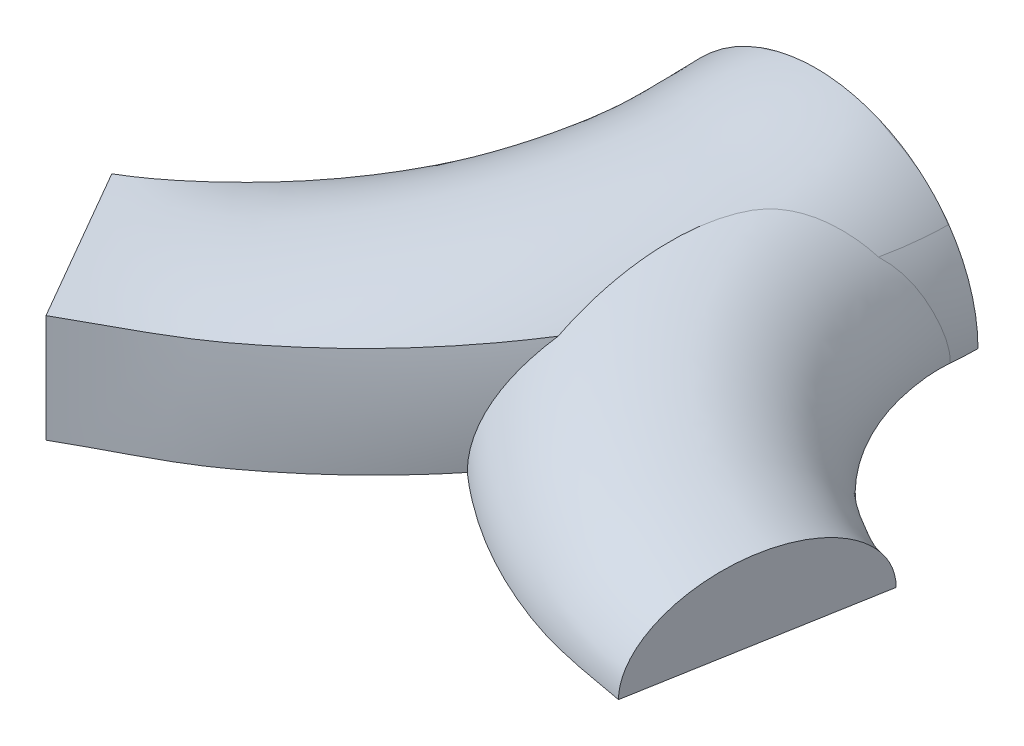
ISO-10303-21;
HEADER;
FILE_DESCRIPTION(('STEP AP214'),'2;1');
FILE_NAME('part.step','',(''),(''),'','','');
FILE_SCHEMA(('AUTOMOTIVE_DESIGN { 1 0 10303 214 1 1 1 1 }'));
ENDSEC;
DATA;
#1=APPLICATION_CONTEXT('core data for automotive mechanical design processes');
#2=APPLICATION_PROTOCOL_DEFINITION('international standard','automotive_design',2000,#1);
#3=PRODUCT_CONTEXT('',#1,'mechanical');
#4=PRODUCT('Part','Part','',(#3));
#5=PRODUCT_RELATED_PRODUCT_CATEGORY('part','',(#4));
#6=PRODUCT_DEFINITION_FORMATION('','',#4);
#7=PRODUCT_DEFINITION_CONTEXT('part definition',#1,'design');
#8=PRODUCT_DEFINITION('design','',#6,#7);
#9=PRODUCT_DEFINITION_SHAPE('','',#8);
#10=(LENGTH_UNIT() NAMED_UNIT(*) SI_UNIT(.MILLI.,.METRE.));
#11=(NAMED_UNIT(*) PLANE_ANGLE_UNIT() SI_UNIT($,.RADIAN.));
#12=(NAMED_UNIT(*) SI_UNIT($,.STERADIAN.) SOLID_ANGLE_UNIT());
#13=UNCERTAINTY_MEASURE_WITH_UNIT(LENGTH_MEASURE(1.E-05),#10,'distance_accuracy_value','');
#14=(GEOMETRIC_REPRESENTATION_CONTEXT(3) GLOBAL_UNCERTAINTY_ASSIGNED_CONTEXT((#13)) GLOBAL_UNIT_ASSIGNED_CONTEXT((#10,
#11,#12)) REPRESENTATION_CONTEXT('',''));
#15=CARTESIAN_POINT('',(0.,0.,0.));
#16=DIRECTION('',(0.,0.,1.));
#17=DIRECTION('',(1.,0.,0.));
#18=AXIS2_PLACEMENT_3D('',#15,#16,#17);
#19=CARTESIAN_POINT('',(119.34259900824,0.,71.8146507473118));
#20=CARTESIAN_POINT('',(105.481389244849,0.,69.3705454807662));
#21=CARTESIAN_POINT('',(87.752954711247,0.,66.4416180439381));
#22=CARTESIAN_POINT('',(61.0911805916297,0.,56.6748383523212));
#23=CARTESIAN_POINT('',(41.0460165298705,0.,47.0561121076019));
#24=CARTESIAN_POINT('',(20.2379799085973,0.,33.3808767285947));
#25=CARTESIAN_POINT('',(-0.194670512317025,0.,16.7753242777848));
#26=CARTESIAN_POINT('',(-17.6613820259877,0.,-1.71692254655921));
#27=CARTESIAN_POINT('',(-33.3198586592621,0.,-23.387955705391));
#28=CARTESIAN_POINT('',(-46.1094422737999,0.,-45.5288595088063));
#29=CARTESIAN_POINT('',(-55.0384749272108,0.,-66.9932525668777));
#30=CARTESIAN_POINT('',(-63.4518017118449,0.,-95.6702842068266));
#31=CARTESIAN_POINT('',(-67.5,0.,-114.909514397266));
#32=CARTESIAN_POINT('',(-67.5,0.,-130.));
#33=CARTESIAN_POINT('',(119.34259900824,1.1210773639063,71.8146507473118));
#34=CARTESIAN_POINT('',(105.4823739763,1.1210773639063,69.3707191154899));
#35=CARTESIAN_POINT('',(87.752843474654,0.712048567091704,66.4415984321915));
#36=CARTESIAN_POINT('',(61.0912242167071,0.847455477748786,56.6748460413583));
#37=CARTESIAN_POINT('',(41.0460048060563,0.879668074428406,47.0561100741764));
#38=CARTESIAN_POINT('',(20.2379821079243,0.946944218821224,33.3808770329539));
#39=CARTESIAN_POINT('',(-0.194671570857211,1.01056274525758,16.7753244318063));
#40=CARTESIAN_POINT('',(-17.6613818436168,1.07163718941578,-1.71692449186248));
#41=CARTESIAN_POINT('',(-33.3198587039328,1.13918016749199,-23.3879516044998));
#42=CARTESIAN_POINT('',(-46.1094422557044,1.18850647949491,-45.5288814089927));
#43=CARTESIAN_POINT('',(-55.0384749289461,1.29237786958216,-66.9931710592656));
#44=CARTESIAN_POINT('',(-63.4518017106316,1.22721346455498,-95.6704920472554));
#45=CARTESIAN_POINT('',(-67.5,2.23770080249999,-114.907674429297));
#46=CARTESIAN_POINT('',(-67.5,2.23770080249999,-130.));
#47=CARTESIAN_POINT('',(119.372986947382,3.33682743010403,71.6423121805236));
#48=CARTESIAN_POINT('',(105.514731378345,3.33682743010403,69.198727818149));
#49=CARTESIAN_POINT('',(87.7723657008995,2.19422839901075,66.3910700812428));
#50=CARTESIAN_POINT('',(61.1226575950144,2.59362078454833,56.6087992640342));
#51=CARTESIAN_POINT('',(41.08375525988,2.69790806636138,46.9983328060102));
#52=CARTESIAN_POINT('',(20.2838963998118,2.90301969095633,33.3249290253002));
#53=CARTESIAN_POINT('',(-0.141143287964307,3.09741982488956,16.7246803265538));
#54=CARTESIAN_POINT('',(-17.6006768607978,3.28504665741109,-1.76222833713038));
#55=CARTESIAN_POINT('',(-33.2519677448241,3.49148828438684,-23.4262484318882));
#56=CARTESIAN_POINT('',(-46.0376642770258,3.64508727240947,-45.5599542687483));
#57=CARTESIAN_POINT('',(-54.9545439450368,3.95398780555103,-67.0161224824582));
#58=CARTESIAN_POINT('',(-63.3848052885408,3.78080433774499,-95.6846116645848));
#59=CARTESIAN_POINT('',(-67.277838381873,6.69014618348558,-114.903994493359));
#60=CARTESIAN_POINT('',(-67.277838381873,6.69014618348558,-130.));
#61=CARTESIAN_POINT('',(119.505378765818,6.56500952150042,70.8914808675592));
#62=CARTESIAN_POINT('',(105.669034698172,6.56500952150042,68.4517600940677));
#63=CARTESIAN_POINT('',(87.8751066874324,4.58267322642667,66.1127479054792));
#64=CARTESIAN_POINT('',(61.2850189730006,5.355494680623,56.2727982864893));
#65=CARTESIAN_POINT('',(41.2797401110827,5.59085065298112,46.6969624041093));
#66=CARTESIAN_POINT('',(20.5215478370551,6.01064099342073,33.0355848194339));
#67=CARTESIAN_POINT('',(0.137463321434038,6.41459425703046,16.4608172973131));
#68=CARTESIAN_POINT('',(-17.2851365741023,6.80331309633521,-1.99751056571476));
#69=CARTESIAN_POINT('',(-32.8995514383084,7.22894421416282,-23.6252960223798));
#70=CARTESIAN_POINT('',(-45.6626374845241,7.55544267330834,-45.7213181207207));
#71=CARTESIAN_POINT('',(-54.5260218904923,8.16151881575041,-67.1357307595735));
#72=CARTESIAN_POINT('',(-63.0171784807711,7.89687130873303,-95.7571255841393));
#73=CARTESIAN_POINT('',(-66.2958247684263,13.2562804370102,-114.892460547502));
#74=CARTESIAN_POINT('',(-66.2958247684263,13.2562804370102,-130.));
#75=CARTESIAN_POINT('',(119.720226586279,9.68151958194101,69.6730183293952));
#76=CARTESIAN_POINT('',(105.9250805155,9.68151958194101,67.2405618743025));
#77=CARTESIAN_POINT('',(88.0676331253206,7.12722011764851,65.5812048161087));
#78=CARTESIAN_POINT('',(61.5829393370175,8.24885739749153,55.660976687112));
#79=CARTESIAN_POINT('',(41.6413433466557,8.63824687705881,46.1395411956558));
#80=CARTESIAN_POINT('',(20.9589880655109,9.27871745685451,32.5032360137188));
#81=CARTESIAN_POINT('',(0.652126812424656,9.90835123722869,15.9730920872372));
#82=CARTESIAN_POINT('',(-16.7027461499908,10.5074805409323,-2.43151622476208));
#83=CARTESIAN_POINT('',(-32.2496514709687,11.162540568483,-23.99269589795));
#84=CARTESIAN_POINT('',(-44.9682050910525,11.6780829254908,-46.0187690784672));
#85=CARTESIAN_POINT('',(-53.7441164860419,12.5686452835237,-67.3576042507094));
#86=CARTESIAN_POINT('',(-62.3160856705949,12.2869968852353,-95.8880188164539));
#87=CARTESIAN_POINT('',(-64.6844439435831,19.6645415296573,-114.897031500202));
#88=CARTESIAN_POINT('',(-64.6844439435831,19.6645415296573,-130.));
#89=CARTESIAN_POINT('',(120.013101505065,12.6696621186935,68.0120421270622));
#90=CARTESIAN_POINT('',(106.282543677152,12.6696621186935,65.5909743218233));
#91=CARTESIAN_POINT('',(88.3675229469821,9.82028828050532,64.7405469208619));
#92=CARTESIAN_POINT('',(62.0391501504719,11.2641048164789,54.7301993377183));
#93=CARTESIAN_POINT('',(42.1972440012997,11.8295819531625,45.2806512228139));
#94=CARTESIAN_POINT('',(21.6315301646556,12.6983361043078,31.6852437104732));
#95=CARTESIAN_POINT('',(1.44131975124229,13.5605117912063,15.2250977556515));
#96=CARTESIAN_POINT('',(-15.808596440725,14.3815442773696,-3.09763320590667));
#97=CARTESIAN_POINT('',(-31.2528486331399,15.2746533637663,-24.5565699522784));
#98=CARTESIAN_POINT('',(-43.8995116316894,15.9949081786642,-46.4749611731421));
#99=CARTESIAN_POINT('',(-52.5551904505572,17.1552490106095,-67.6992302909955));
#100=CARTESIAN_POINT('',(-61.2121248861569,16.9333851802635,-96.0859942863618));
#101=CARTESIAN_POINT('',(-62.460093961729,25.872567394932,-114.929650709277));
#102=CARTESIAN_POINT('',(-62.460093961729,25.872567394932,-130.));
#103=CARTESIAN_POINT('',(120.379574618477,15.5127416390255,65.9336698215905));
#104=CARTESIAN_POINT('',(106.73973867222,15.5127416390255,63.5285987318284));
#105=CARTESIAN_POINT('',(88.7925077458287,12.6542969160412,63.5349074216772));
#106=CARTESIAN_POINT('',(62.6763226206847,14.3916328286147,53.4373204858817));
#107=CARTESIAN_POINT('',(42.9761372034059,15.1543409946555,44.0748773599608));
#108=CARTESIAN_POINT('',(22.5744844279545,16.2605842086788,30.5389685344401));
#109=CARTESIAN_POINT('',(2.54351513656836,17.3528959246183,14.1804273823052));
#110=CARTESIAN_POINT('',(-14.5577725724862,18.4095055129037,-4.02924806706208));
#111=CARTESIAN_POINT('',(-29.8597360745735,19.5476463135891,-25.3450429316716));
#112=CARTESIAN_POINT('',(-42.4016354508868,20.487884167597,-47.1125331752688));
#113=CARTESIAN_POINT('',(-50.9058529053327,21.9009677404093,-68.1781530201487));
#114=CARTESIAN_POINT('',(-59.6352658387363,21.8188626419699,-96.3596100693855));
#115=CARTESIAN_POINT('',(-59.6447352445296,31.8324865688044,-115.003543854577));
#116=CARTESIAN_POINT('',(-59.6447352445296,31.8324865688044,-130.));
#117=CARTESIAN_POINT('',(120.815394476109,18.1950340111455,63.4620125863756));
#118=CARTESIAN_POINT('',(107.295103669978,18.1950340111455,61.0780205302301));
#119=CARTESIAN_POINT('',(89.3605402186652,15.5865984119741,61.9079163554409));
#120=CARTESIAN_POINT('',(63.5173079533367,17.5881773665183,51.7387513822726));
#121=CARTESIAN_POINT('',(44.0076824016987,18.5665272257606,42.4756692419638));
#122=CARTESIAN_POINT('',(23.8217994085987,19.9120117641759,29.0231215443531));
#123=CARTESIAN_POINT('',(4.00410569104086,21.2446661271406,12.7956007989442));
#124=CARTESIAN_POINT('',(-12.9008287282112,22.5418269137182,-5.26294914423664));
#125=CARTESIAN_POINT('',(-28.0152660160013,23.9301867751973,-26.3894848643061));
#126=CARTESIAN_POINT('',(-40.4137284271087,25.1022296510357,-47.9566716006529));
#127=CARTESIAN_POINT('',(-48.7360959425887,26.7499065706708,-68.8136394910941));
#128=CARTESIAN_POINT('',(-57.5089421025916,26.8803238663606,-96.7190915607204));
#129=CARTESIAN_POINT('',(-56.2499522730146,37.5067050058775,-115.127318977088));
#130=CARTESIAN_POINT('',(-56.2499522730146,37.5067050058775,-130.));
#131=CARTESIAN_POINT('',(121.316309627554,20.7008151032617,60.6211815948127));
#132=CARTESIAN_POINT('',(107.947533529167,20.7008151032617,58.2639056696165));
#133=CARTESIAN_POINT('',(90.0895214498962,18.5745451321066,59.8031946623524));
#134=CARTESIAN_POINT('',(64.5849776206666,20.810474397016,49.5909068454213));
#135=CARTESIAN_POINT('',(45.3215332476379,22.0201435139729,40.4364755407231));
#136=CARTESIAN_POINT('',(25.4074255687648,23.5991696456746,27.0964139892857));
#137=CARTESIAN_POINT('',(5.86848001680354,25.1949812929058,11.0271377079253));
#138=CARTESIAN_POINT('',(-10.7882979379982,26.7289920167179,-6.83532450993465));
#139=CARTESIAN_POINT('',(-25.6644344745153,28.3708987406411,-27.7212662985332));
#140=CARTESIAN_POINT('',(-37.874709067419,29.7833945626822,-49.0325602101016));
#141=CARTESIAN_POINT('',(-45.9867800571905,31.6453103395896,-69.6249670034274));
#142=CARTESIAN_POINT('',(-54.7543728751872,32.0568570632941,-97.1746380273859));
#143=CARTESIAN_POINT('',(-52.3069329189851,42.8382090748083,-115.309815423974));
#144=CARTESIAN_POINT('',(-52.3069329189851,42.8382090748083,-130.));
#145=CARTESIAN_POINT('',(121.877650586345,23.0123460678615,57.4376588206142));
#146=CARTESIAN_POINT('',(108.695587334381,23.0123460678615,55.1133054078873));
#147=CARTESIAN_POINT('',(90.9950339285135,21.5666380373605,57.1710873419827));
#148=CARTESIAN_POINT('',(65.8993111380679,24.0071865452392,46.955983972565));
#149=CARTESIAN_POINT('',(46.9427154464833,25.4573754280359,37.9175262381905));
#150=CARTESIAN_POINT('',(27.3628819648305,27.2651505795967,24.7208876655));
#151=CARTESIAN_POINT('',(8.16832016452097,29.1267449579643,8.8452272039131));
#152=CARTESIAN_POINT('',(-8.18214703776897,30.8953211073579,-8.77473250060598));
#153=CARTESIAN_POINT('',(-22.7655024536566,32.7886726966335,-29.3640734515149));
#154=CARTESIAN_POINT('',(-34.7385002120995,34.4450696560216,-50.3594412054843));
#155=CARTESIAN_POINT('',(-42.6116721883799,36.5013439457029,-70.6265340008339));
#156=CARTESIAN_POINT('',(-51.3153793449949,37.2452227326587,-97.7345280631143));
#157=CARTESIAN_POINT('',(-47.8082227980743,47.8082841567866,-115.552864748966));
#158=CARTESIAN_POINT('',(-47.8082227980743,47.8082841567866,-130.));
#159=CARTESIAN_POINT('',(122.494747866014,25.1118880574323,53.9379262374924));
#160=CARTESIAN_POINT('',(109.538045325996,25.1118880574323,51.6533099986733));
#161=CARTESIAN_POINT('',(92.0926350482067,24.5113779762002,53.9619349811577));
#162=CARTESIAN_POINT('',(67.4802979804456,27.126976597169,43.7961815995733));
#163=CARTESIAN_POINT('',(48.896250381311,28.8204068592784,34.8790507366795));
#164=CARTESIAN_POINT('',(29.7196923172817,30.8530514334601,21.8585847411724));
#165=CARTESIAN_POINT('',(10.9352909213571,32.9628437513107,6.2200571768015));
#166=CARTESIAN_POINT('',(-5.04424399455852,34.9652326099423,-11.1095246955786));
#167=CARTESIAN_POINT('',(-19.2769363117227,37.1021952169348,-31.3416065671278));
#168=CARTESIAN_POINT('',(-30.9579300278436,39.0020327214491,-51.9564820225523));
#169=CARTESIAN_POINT('',(-38.5686128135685,41.2281271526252,-71.8330171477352));
#170=CARTESIAN_POINT('',(-47.1253954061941,42.352496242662,-98.406330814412));
#171=CARTESIAN_POINT('',(-42.8383239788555,52.306900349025,-115.864579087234));
#172=CARTESIAN_POINT('',(-42.8383239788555,52.306900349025,-130.));
#173=CARTESIAN_POINT('',(123.164228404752,26.9871618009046,50.1411134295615));
#174=CARTESIAN_POINT('',(110.471419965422,26.9871618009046,47.9030288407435));
#175=CARTESIAN_POINT('',(93.3855146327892,27.3231922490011,50.1651707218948));
#176=CARTESIAN_POINT('',(69.3313560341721,30.0863733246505,40.1053711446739));
#177=CARTESIAN_POINT('',(51.1869711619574,32.0173128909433,31.3134127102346));
#178=CARTESIAN_POINT('',(32.4828492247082,34.2631236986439,18.5033986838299));
#179=CARTESIAN_POINT('',(14.1779228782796,36.6049316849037,3.14332830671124));
#180=CARTESIAN_POINT('',(-1.36578951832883,38.8311790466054,-13.8460897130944));
#181=CARTESIAN_POINT('',(-15.1891904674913,41.1981695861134,-33.659454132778));
#182=CARTESIAN_POINT('',(-26.5209379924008,43.3339430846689,-53.8281424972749));
#183=CARTESIAN_POINT('',(-33.8516978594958,45.702793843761,-73.2478294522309));
#184=CARTESIAN_POINT('',(-42.1587096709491,47.240363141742,-99.1918845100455));
#185=CARTESIAN_POINT('',(-37.5064901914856,56.2499691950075,-116.246294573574));
#186=CARTESIAN_POINT('',(-37.5064901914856,56.2499691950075,-130.));
#187=CARTESIAN_POINT('',(123.880552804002,28.6180583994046,46.0786358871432));
#188=CARTESIAN_POINT('',(111.490038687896,28.6180583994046,43.8938539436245));
#189=CARTESIAN_POINT('',(94.8771094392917,29.9173927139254,45.7688402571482));
#190=CARTESIAN_POINT('',(71.4558062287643,32.8015584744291,35.877968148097));
#191=CARTESIAN_POINT('',(53.8197385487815,34.9562635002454,27.2128297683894));
#192=CARTESIAN_POINT('',(35.6573363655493,37.3955972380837,14.6492499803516));
#193=CARTESIAN_POINT('',(17.9047654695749,39.9546880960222,-0.393270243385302));
#194=CARTESIAN_POINT('',(2.86191953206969,42.3855133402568,-16.9908236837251));
#195=CARTESIAN_POINT('',(-10.4925203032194,44.9635033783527,-36.3231848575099));
#196=CARTESIAN_POINT('',(-21.4165241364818,47.3193727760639,-55.978990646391));
#197=CARTESIAN_POINT('',(-28.4510768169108,49.8065234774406,-74.8739805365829));
#198=CARTESIAN_POINT('',(-36.3996739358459,51.76019301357,-100.094056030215));
#199=CARTESIAN_POINT('',(-31.8328880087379,59.6447271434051,-116.690240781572));
#200=CARTESIAN_POINT('',(-31.8328880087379,59.6447271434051,-130.));
#201=CARTESIAN_POINT('',(124.640583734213,29.9903531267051,41.7682862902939));
#202=CARTESIAN_POINT('',(112.585415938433,29.9903531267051,39.64263495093));
#203=CARTESIAN_POINT('',(96.5531021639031,32.2041882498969,40.8171349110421));
#204=CARTESIAN_POINT('',(73.8335198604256,35.1850550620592,31.1531963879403));
#205=CARTESIAN_POINT('',(56.7694410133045,37.5399379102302,22.6166092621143));
#206=CARTESIAN_POINT('',(39.2131458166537,40.148190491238,10.3325585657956));
#207=CARTESIAN_POINT('',(22.0796916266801,42.89950400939,-4.3553790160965));
#208=CARTESIAN_POINT('',(7.59824551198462,45.5098837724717,-20.513529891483));
#209=CARTESIAN_POINT('',(-5.23213209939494,48.2728720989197,-39.3071340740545));
#210=CARTESIAN_POINT('',(-15.6938074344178,50.8245647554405,-58.3884301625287));
#211=CARTESIAN_POINT('',(-22.4187156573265,53.406226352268,-76.6954611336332));
#212=CARTESIAN_POINT('',(-29.9037614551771,55.7521564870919,-101.105071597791));
#213=CARTESIAN_POINT('',(-25.871816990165,62.4600965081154,-117.184082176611));
#214=CARTESIAN_POINT('',(-25.871816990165,62.4600965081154,-130.));
#215=CARTESIAN_POINT('',(125.438167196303,31.0864744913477,37.2449657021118));
#216=CARTESIAN_POINT('',(113.745968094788,31.0864744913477,35.1833155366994));
#217=CARTESIAN_POINT('',(98.3995254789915,34.0941658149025,35.3523150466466));
#218=CARTESIAN_POINT('',(76.4442309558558,37.1492378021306,25.9710369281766));
#219=CARTESIAN_POINT('',(60.0110041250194,39.6710555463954,17.56385508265));
#220=CARTESIAN_POINT('',(43.1202622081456,42.4186135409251,5.58978241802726));
#221=CARTESIAN_POINT('',(26.6665797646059,45.3267776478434,-8.70865637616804));
#222=CARTESIAN_POINT('',(12.8025377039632,48.0859171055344,-24.3840116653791));
#223=CARTESIAN_POINT('',(0.546793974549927,51.0009948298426,-42.5856312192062));
#224=CARTESIAN_POINT('',(-9.40204536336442,53.715530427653,-61.0358999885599));
#225=CARTESIAN_POINT('',(-15.8060651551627,56.3696742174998,-78.6961296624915));
#226=CARTESIAN_POINT('',(-22.7277591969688,59.0542275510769,-102.217494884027));
#227=CARTESIAN_POINT('',(-19.6659467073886,64.6844459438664,-117.712495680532));
#228=CARTESIAN_POINT('',(-19.6659467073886,64.6844459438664,-130.));
#229=CARTESIAN_POINT('',(126.271956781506,31.8906744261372,32.516309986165));
#230=CARTESIAN_POINT('',(114.960164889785,31.8906744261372,30.5217358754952));
#231=CARTESIAN_POINT('',(100.38065407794,35.5127971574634,29.4854831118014));
#232=CARTESIAN_POINT('',(79.2394998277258,38.6207683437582,20.42509423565));
#233=CARTESIAN_POINT('',(63.4836395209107,41.2686482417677,12.150073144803));
#234=CARTESIAN_POINT('',(47.3054740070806,44.1205234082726,0.509627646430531));
#235=CARTESIAN_POINT('',(31.5798405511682,47.1457945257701,-13.3718061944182));
#236=CARTESIAN_POINT('',(18.3774550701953,50.0166597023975,-28.529953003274));
#237=CARTESIAN_POINT('',(6.73645843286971,53.04550977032,-46.0973993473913));
#238=CARTESIAN_POINT('',(-2.65972240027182,55.8828874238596,-63.8720465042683));
#239=CARTESIAN_POINT('',(-8.73323813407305,58.5882237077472,-80.8381819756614));
#240=CARTESIAN_POINT('',(-15.0145040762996,61.5353304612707,-103.411623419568));
#241=CARTESIAN_POINT('',(-13.2536286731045,66.2958172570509,-118.256036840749));
#242=CARTESIAN_POINT('',(-13.2536286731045,66.2958172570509,-130.));
#243=CARTESIAN_POINT('',(127.131974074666,32.3862100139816,27.6389095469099));
#244=CARTESIAN_POINT('',(116.209567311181,32.3862100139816,25.7129945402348));
#245=CARTESIAN_POINT('',(102.461543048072,36.3856664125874,23.3221772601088));
#246=CARTESIAN_POINT('',(82.1705807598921,39.5262642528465,14.6111549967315));
#247=CARTESIAN_POINT('',(67.1266406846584,42.251759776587,6.47018292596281));
#248=CARTESIAN_POINT('',(51.6955552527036,45.1675746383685,-4.81908965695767));
#249=CARTESIAN_POINT('',(36.7338879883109,48.2658422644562,-18.2635851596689));
#250=CARTESIAN_POINT('',(24.2256790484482,51.2051517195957,-32.8790295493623));
#251=CARTESIAN_POINT('',(13.2290127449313,54.3040676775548,-49.7811621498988));
#252=CARTESIAN_POINT('',(4.41493997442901,57.2171866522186,-66.8475237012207));
#253=CARTESIAN_POINT('',(-1.32132655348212,59.9534796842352,-83.0837823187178));
#254=CARTESIAN_POINT('',(-6.90433624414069,63.0637565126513,-104.667835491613));
#255=CARTESIAN_POINT('',(-6.6953177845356,67.27785570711,-118.794545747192));
#256=CARTESIAN_POINT('',(-6.6953177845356,67.27785570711,-130.));
#257=CARTESIAN_POINT('',(128.025007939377,32.5569010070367,22.574262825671));
#258=CARTESIAN_POINT('',(117.493607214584,32.5569010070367,20.7172927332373));
#259=CARTESIAN_POINT('',(104.590388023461,36.6856504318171,17.0234419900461));
#260=CARTESIAN_POINT('',(85.1703222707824,39.8375075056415,8.65819456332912));
#261=CARTESIAN_POINT('',(70.8546231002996,42.5896941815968,0.658588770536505));
#262=CARTESIAN_POINT('',(56.188106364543,45.5273858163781,-10.2723423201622));
#263=CARTESIAN_POINT('',(42.0083222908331,48.6511236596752,-23.2695532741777));
#264=CARTESIAN_POINT('',(30.210490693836,51.613835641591,-37.3297152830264));
#265=CARTESIAN_POINT('',(19.8731541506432,54.7368562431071,-53.5508743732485));
#266=CARTESIAN_POINT('',(11.6550103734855,57.6760778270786,-69.892896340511));
#267=CARTESIAN_POINT('',(6.26296284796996,60.4227619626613,-85.3803079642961));
#268=CARTESIAN_POINT('',(1.39705741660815,63.5898572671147,-105.957253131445));
#269=CARTESIAN_POINT('',(0.,67.6110376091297,-119.311384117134));
#270=CARTESIAN_POINT('',(0.,67.6110376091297,-130.));
#271=CARTESIAN_POINT('',(128.918041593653,32.3862102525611,17.5096172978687));
#272=CARTESIAN_POINT('',(118.770782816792,32.3862102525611,15.7203817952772));
#273=CARTESIAN_POINT('',(106.720008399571,36.385666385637,10.7248433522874));
#274=CARTESIAN_POINT('',(88.1697596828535,39.526264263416,2.70518049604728));
#275=CARTESIAN_POINT('',(74.582687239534,42.2517597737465,-5.15299028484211));
#276=CARTESIAN_POINT('',(60.680642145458,45.1675746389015,-15.7255994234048));
#277=CARTESIAN_POINT('',(47.2827639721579,48.2658422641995,-28.2755129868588));
#278=CARTESIAN_POINT('',(36.1953010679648,51.20515171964,-41.780442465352));
#279=CARTESIAN_POINT('',(26.517295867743,54.3040676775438,-57.3205008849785));
#280=CARTESIAN_POINT('',(18.8950806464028,57.2171866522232,-72.9387256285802));
#281=CARTESIAN_POINT('',(13.8472522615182,59.9534796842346,-87.6751343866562));
#282=CARTESIAN_POINT('',(9.69845106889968,63.0637565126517,-107.251003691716));
#283=CARTESIAN_POINT('',(6.69531778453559,67.2778557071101,-119.789864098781));
#284=CARTESIAN_POINT('',(6.69531778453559,67.2778557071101,-130.));
#285=CARTESIAN_POINT('',(129.778059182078,31.890673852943,12.6322151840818));
#286=CARTESIAN_POINT('',(119.992036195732,31.890673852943,10.9066752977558));
#287=CARTESIAN_POINT('',(108.804077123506,35.512797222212,4.56209851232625));
#288=CARTESIAN_POINT('',(91.0995935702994,38.620768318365,-3.10897890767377));
#289=CARTESIAN_POINT('',(78.2260235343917,41.2686482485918,-10.8328192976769));
#290=CARTESIAN_POINT('',(65.0706605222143,44.1205234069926,-21.0543329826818));
#291=CARTESIAN_POINT('',(52.4368416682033,47.145794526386,-33.1672655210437));
#292=CARTESIAN_POINT('',(42.0435198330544,50.0166597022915,-46.129642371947));
#293=CARTESIAN_POINT('',(33.0098514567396,53.0455097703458,-61.0040090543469));
#294=CARTESIAN_POINT('',(25.9697425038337,55.8828874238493,-75.9155591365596));
#295=CARTESIAN_POINT('',(21.2591638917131,58.588223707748,-89.9156878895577));
#296=CARTESIAN_POINT('',(17.8086188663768,61.5353304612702,-108.520084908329));
#297=CARTESIAN_POINT('',(13.2536286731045,66.2958172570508,-120.214445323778));
#298=CARTESIAN_POINT('',(13.2536286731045,66.2958172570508,-130.));
#299=CARTESIAN_POINT('',(130.61184826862,31.0864756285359,7.90356229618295));
#300=CARTESIAN_POINT('',(121.162558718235,31.0864756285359,6.23739759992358));
#301=CARTESIAN_POINT('',(110.790139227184,34.0941656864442,-1.30386362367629));
#302=CARTESIAN_POINT('',(93.8929276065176,37.1492378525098,-8.65526294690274));
#303=CARTESIAN_POINT('',(81.6991788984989,39.6710555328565,-16.246506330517));
#304=CARTESIAN_POINT('',(69.2557747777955,42.418613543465,-26.1345129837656));
#305=CARTESIAN_POINT('',(57.3501494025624,45.3267776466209,-37.8303742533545));
#306=CARTESIAN_POINT('',(47.6184291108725,48.0859171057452,-50.2757755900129));
#307=CARTESIAN_POINT('',(39.1995178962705,51.0009948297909,-64.5153811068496));
#308=CARTESIAN_POINT('',(32.7120646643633,53.715530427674,-78.7538153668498));
#309=CARTESIAN_POINT('',(28.3319909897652,56.3696742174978,-92.0498899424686));
#310=CARTESIAN_POINT('',(25.5218739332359,59.0542275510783,-109.73423114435));
#311=CARTESIAN_POINT('',(19.6659467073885,64.6844459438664,-120.580774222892));
#312=CARTESIAN_POINT('',(19.6659467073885,64.6844459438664,-130.));
#313=CARTESIAN_POINT('',(131.409432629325,29.9903509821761,3.3802366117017));
#314=CARTESIAN_POINT('',(122.269380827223,29.9903509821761,1.76859887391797));
#315=CARTESIAN_POINT('',(112.642631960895,32.2041884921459,-6.76761242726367));
#316=CARTESIAN_POINT('',(96.5012583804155,35.1850549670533,-13.8378427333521));
#317=CARTESIAN_POINT('',(84.9413816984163,37.5399379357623,-21.2991437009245));
#318=CARTESIAN_POINT('',(73.1627711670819,40.1481904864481,-30.8773200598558));
#319=CARTESIAN_POINT('',(61.9370952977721,42.8995040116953,-42.1836015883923));
#320=CARTESIAN_POINT('',(52.8227113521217,45.5098837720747,-54.1464903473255));
#321=CARTESIAN_POINT('',(44.97844640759,48.2728720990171,-67.7933973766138));
#322=CARTESIAN_POINT('',(39.0038257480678,50.824564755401,-81.4038465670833));
#323=CARTESIAN_POINT('',(34.9446415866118,53.406226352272,-94.0410275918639));
#324=CARTESIAN_POINT('',(32.6978761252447,55.7521564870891,-110.870957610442));
#325=CARTESIAN_POINT('',(25.871816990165,62.4600965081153,-120.894037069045));
#326=CARTESIAN_POINT('',(25.871816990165,62.4600965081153,-130.));
#327=CARTESIAN_POINT('',(132.169461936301,28.618062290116,-0.930103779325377));
#328=CARTESIAN_POINT('',(123.315662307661,28.618062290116,-2.49126753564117));
#329=CARTESIAN_POINT('',(114.324170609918,29.9173922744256,-11.7183406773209));
#330=CARTESIAN_POINT('',(98.8767969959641,32.8015586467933,-18.5629979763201));
#331=CARTESIAN_POINT('',(87.8916686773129,34.9562634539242,-25.895257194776));
#332=CARTESIAN_POINT('',(76.7184709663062,37.3955972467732,-35.1940408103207));
#333=CARTESIAN_POINT('',(66.1120742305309,39.9546880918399,-46.1456601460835));
#334=CARTESIAN_POINT('',(57.5590282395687,42.3855133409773,-57.6694356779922));
#335=CARTESIAN_POINT('',(50.238836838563,44.9635033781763,-70.7768526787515));
#336=CARTESIAN_POINT('',(44.7265415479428,47.3193727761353,-83.8159171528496));
#337=CARTESIAN_POINT('',(40.9770028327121,49.8065234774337,-95.8527179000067));
#338=CARTESIAN_POINT('',(39.1937885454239,51.7601930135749,-111.906937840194));
#339=CARTESIAN_POINT('',(31.8328880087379,59.6447271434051,-121.166871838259));
#340=CARTESIAN_POINT('',(31.8328880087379,59.6447271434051,-130.));
#341=CARTESIAN_POINT('',(132.88578902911,26.9871556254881,-4.99259659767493));
#342=CARTESIAN_POINT('',(124.297842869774,26.9871556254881,-6.50688321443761));
#343=CARTESIAN_POINT('',(115.819881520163,27.3231929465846,-16.1139433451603));
#344=CARTESIAN_POINT('',(100.999632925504,30.0863730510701,-22.7906866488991));
#345=CARTESIAN_POINT('',(90.5248698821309,32.0173129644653,-29.9957599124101));
#346=CARTESIAN_POINT('',(79.8928767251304,34.2631236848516,-39.0482126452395));
#347=CARTESIAN_POINT('',(69.8389559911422,36.604931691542,-49.6822160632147));
#348=CARTESIAN_POINT('',(61.7867305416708,38.8311790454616,-60.8143781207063));
#349=CARTESIAN_POINT('',(54.935508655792,41.1981695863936,-73.4401524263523));
#350=CARTESIAN_POINT('',(49.8309547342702,43.3339430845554,-85.9690613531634));
#351=CARTESIAN_POINT('',(46.3776239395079,45.7027938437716,-97.4703252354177));
#352=CARTESIAN_POINT('',(44.9528242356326,47.2403631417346,-112.830895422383));
#353=CARTESIAN_POINT('',(37.5064901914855,56.2499691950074,-121.417950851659));
#354=CARTESIAN_POINT('',(37.5064901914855,56.2499691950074,-130.));
#355=CARTESIAN_POINT('',(133.555267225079,25.1118906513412,-8.78939611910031));
#356=CARTESIAN_POINT('',(125.217591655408,25.1118906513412,-10.2595532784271));
#357=CARTESIAN_POINT('',(117.114300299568,24.5113776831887,-19.9104375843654));
#358=CARTESIAN_POINT('',(102.85008733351,27.126976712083,-26.4816031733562));
#359=CARTESIAN_POINT('',(92.8157528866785,28.8204068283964,-33.5613670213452));
#360=CARTESIAN_POINT('',(82.6560032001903,30.8530514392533,-42.4034101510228));
#361=CARTESIAN_POINT('',(73.0816025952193,32.9628437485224,-52.7589174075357));
#362=CARTESIAN_POINT('',(65.4651824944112,34.9652326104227,-63.5510884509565));
#363=CARTESIAN_POINT('',(59.0232551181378,37.1021952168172,-75.7576988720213));
#364=CARTESIAN_POINT('',(54.2679465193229,39.0020327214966,-87.8423265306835));
#365=CARTESIAN_POINT('',(51.0945389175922,41.2281271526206,-98.8791662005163));
#366=CARTESIAN_POINT('',(49.9195099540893,42.3524962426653,-113.631675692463));
#367=CARTESIAN_POINT('',(42.8383239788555,52.3069003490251,-121.664868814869));
#368=CARTESIAN_POINT('',(42.8383239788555,52.3069003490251,-130.));
#369=CARTESIAN_POINT('',(134.172348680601,23.0124078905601,-12.2890389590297));
#370=CARTESIAN_POINT('',(126.069884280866,23.0124078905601,-13.7177220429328));
#371=CARTESIAN_POINT('',(118.210790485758,21.5666310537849,-23.1197962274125));
#372=CARTESIAN_POINT('',(104.431509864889,24.0071892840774,-29.6413247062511));
#373=CARTESIAN_POINT('',(94.7691707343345,25.457374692,-36.599863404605));
#374=CARTESIAN_POINT('',(85.0128355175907,27.2651507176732,-45.2657111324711));
#375=CARTESIAN_POINT('',(75.8485627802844,29.1267448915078,-55.3840806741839));
#376=CARTESIAN_POINT('',(68.6030873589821,30.8953211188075,-65.8859309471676));
#377=CARTESIAN_POINT('',(62.5118208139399,32.7886726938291,-77.735126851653));
#378=CARTESIAN_POINT('',(58.0485168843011,34.4450696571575,-89.439928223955));
#379=CARTESIAN_POINT('',(55.1375982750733,36.5013439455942,-100.083562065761));
#380=CARTESIAN_POINT('',(54.1094939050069,37.2452227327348,-114.308800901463));
#381=CARTESIAN_POINT('',(47.8082227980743,47.8082841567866,-121.929464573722));
#382=CARTESIAN_POINT('',(47.8082227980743,47.8082841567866,-130.));
#383=CARTESIAN_POINT('',(134.733697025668,20.700849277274,-15.4726036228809));
#384=CARTESIAN_POINT('',(126.852568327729,20.700849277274,-16.8622592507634));
#385=CARTESIAN_POINT('',(119.112391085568,18.5745412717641,-25.7525884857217));
#386=CARTESIAN_POINT('',(105.747377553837,20.8104759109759,-32.2759789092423));
#387=CARTESIAN_POINT('',(96.3899406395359,22.0201431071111,-39.1188855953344));
#388=CARTESIAN_POINT('',(86.9683692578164,23.5991697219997,-47.6412221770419));
#389=CARTESIAN_POINT('',(78.1483657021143,25.1949812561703,-57.5660047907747));
#390=CARTESIAN_POINT('',(71.2092446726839,26.7289920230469,-67.8252966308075));
#391=CARTESIAN_POINT('',(65.4107512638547,28.3708987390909,-79.3780198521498));
#392=CARTESIAN_POINT('',(61.1847263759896,29.7833945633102,-90.7663529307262));
#393=CARTESIAN_POINT('',(58.5127060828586,31.6453103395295,-101.08682662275));
#394=CARTESIAN_POINT('',(57.5484874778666,32.0568570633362,-114.864362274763));
#395=CARTESIAN_POINT('',(52.306932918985,42.8382090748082,-122.210834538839));
#396=CARTESIAN_POINT('',(52.306932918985,42.8382090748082,-130.));
#397=CARTESIAN_POINT('',(135.234624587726,18.1950217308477,-18.3135049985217));
#398=CARTESIAN_POINT('',(127.558110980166,18.1950217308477,-19.6670814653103));
#399=CARTESIAN_POINT('',(119.835372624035,15.5865997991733,-27.8583600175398));
#400=CARTESIAN_POINT('',(106.817400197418,17.5881768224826,-34.4234115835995));
#401=CARTESIAN_POINT('',(97.7031591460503,18.5665273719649,-41.1581918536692));
#402=CARTESIAN_POINT('',(88.5541140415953,19.9120117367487,-49.5679042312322));
#403=CARTESIAN_POINT('',(80.0126829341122,21.2446661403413,-59.3344972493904));
#404=CARTESIAN_POINT('',(73.3217852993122,22.541826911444,-69.3975577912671));
#405=CARTESIAN_POINT('',(67.7615803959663,23.9301867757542,-80.7100354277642));
#406=CARTESIAN_POINT('',(63.7237467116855,25.1022296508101,-91.8409954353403));
#407=CARTESIAN_POINT('',(61.2620218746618,26.7499065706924,-101.902790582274));
#408=CARTESIAN_POINT('',(60.3030567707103,26.8803238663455,-115.308086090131));
#409=CARTESIAN_POINT('',(56.2499522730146,37.5067050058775,-122.497994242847));
#410=CARTESIAN_POINT('',(56.2499522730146,37.5067050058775,-130.));
#411=CARTESIAN_POINT('',(135.670443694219,15.512732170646,-20.7851579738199));
#412=CARTESIAN_POINT('',(128.17833221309,15.512732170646,-22.1062193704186));
#413=CARTESIAN_POINT('',(120.396078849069,12.6542979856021,-29.4866436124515));
#414=CARTESIAN_POINT('',(107.661258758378,14.3916324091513,-36.1214735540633));
#415=CARTESIAN_POINT('',(98.7339321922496,15.1543411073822,-42.7575394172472));
#416=CARTESIAN_POINT('',(89.801573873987,16.2605841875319,-51.0837176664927));
#417=CARTESIAN_POINT('',(81.4732037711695,17.3528959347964,-60.719368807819));
#418=CARTESIAN_POINT('',(74.9787411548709,18.4095055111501,-70.6310670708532));
#419=CARTESIAN_POINT('',(69.6060475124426,19.5476463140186,-81.7548719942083));
#420=CARTESIAN_POINT('',(65.7116549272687,20.4878841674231,-92.6830326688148));
#421=CARTESIAN_POINT('',(63.4317787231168,21.9009677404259,-102.546095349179));
#422=CARTESIAN_POINT('',(62.4293805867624,21.8188626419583,-115.64763140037));
#423=CARTESIAN_POINT('',(59.6447352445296,31.8324865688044,-122.79825991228));
#424=CARTESIAN_POINT('',(59.6447352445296,31.8324865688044,-130.));
#425=CARTESIAN_POINT('',(136.036912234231,12.6696697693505,-22.8635043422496));
#426=CARTESIAN_POINT('',(128.705522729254,12.6696697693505,-24.15622611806));
#427=CARTESIAN_POINT('',(120.813156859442,9.82028741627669,-30.6936805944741));
#428=CARTESIAN_POINT('',(108.301532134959,11.2641051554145,-37.4138040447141));
#429=CARTESIAN_POINT('',(99.5119920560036,11.8295818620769,-43.9634647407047));
#430=CARTESIAN_POINT('',(90.7446844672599,12.698336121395,-52.2299548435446));
#431=CARTESIAN_POINT('',(82.5753239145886,13.5605117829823,-61.7640948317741));
#432=CARTESIAN_POINT('',(76.2295779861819,14.3815442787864,-71.5624337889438));
#433=CARTESIAN_POINT('',(70.999156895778,15.2746533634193,-82.543856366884));
#434=CARTESIAN_POINT('',(67.2095323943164,15.9949081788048,-93.317881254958));
#435=CARTESIAN_POINT('',(65.0811161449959,17.155249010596,-103.035151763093));
#436=CARTESIAN_POINT('',(64.0062397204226,16.933385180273,-115.895406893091));
#437=CARTESIAN_POINT('',(62.4600939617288,25.8725673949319,-123.10091138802));
#438=CARTESIAN_POINT('',(62.4600939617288,25.8725673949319,-130.));
#439=CARTESIAN_POINT('',(136.329788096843,9.68152369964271,-24.5244858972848));
#440=CARTESIAN_POINT('',(129.13282517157,9.68152369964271,-25.7935046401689));
#441=CARTESIAN_POINT('',(121.105157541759,7.12721965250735,-31.535729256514));
#442=CARTESIAN_POINT('',(108.760836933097,8.24885757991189,-38.3440356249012));
#443=CARTESIAN_POINT('',(100.067061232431,8.63824682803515,-44.8225060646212));
#444=CARTESIAN_POINT('',(91.4173825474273,9.27871746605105,-53.0479077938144));
#445=CARTESIAN_POINT('',(83.3644417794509,9.90835123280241,-62.5121508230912));
#446=CARTESIAN_POINT('',(77.1237406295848,10.5074805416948,-72.2282673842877));
#447=CARTESIAN_POINT('',(71.9959565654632,11.1625405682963,-83.1083150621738));
#448=CARTESIAN_POINT('',(68.2782271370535,11.6780829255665,-93.7709594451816));
#449=CARTESIAN_POINT('',(66.2700420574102,12.5686452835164,-103.388364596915));
#450=CARTESIAN_POINT('',(65.1102005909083,12.2869968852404,-116.063836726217));
#451=CARTESIAN_POINT('',(64.6844439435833,19.6645415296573,-123.395091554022));
#452=CARTESIAN_POINT('',(64.6844439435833,19.6645415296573,-130.));
#453=CARTESIAN_POINT('',(136.544638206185,6.56500507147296,-25.742961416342));
#454=CARTESIAN_POINT('',(129.450342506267,6.56500507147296,-26.9938771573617));
#455=CARTESIAN_POINT('',(121.290740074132,4.58267372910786,-32.0684955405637));
#456=CARTESIAN_POINT('',(109.061480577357,5.35549448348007,-38.9553771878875));
#457=CARTESIAN_POINT('',(100.427932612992,5.59085070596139,-45.3800607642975));
#458=CARTESIAN_POINT('',(91.8549600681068,6.01064098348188,-53.5802210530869));
#459=CARTESIAN_POINT('',(83.8790391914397,6.41459426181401,-62.9999340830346));
#460=CARTESIAN_POINT('',(77.7061424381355,6.80331309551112,-72.6620016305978));
#461=CARTESIAN_POINT('',(72.645853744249,7.22894421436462,-83.4762752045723));
#462=CARTESIAN_POINT('',(68.9726606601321,7.5554426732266,-94.0654261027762));
#463=CARTESIAN_POINT('',(67.0519473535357,8.16151881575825,-103.621342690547));
#464=CARTESIAN_POINT('',(65.8112934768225,7.89687130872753,-116.166413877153));
#465=CARTESIAN_POINT('',(66.2958247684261,13.2562804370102,-123.650338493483));
#466=CARTESIAN_POINT('',(66.2958247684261,13.2562804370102,-130.));
#467=CARTESIAN_POINT('',(136.677029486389,3.33682499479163,-26.4937896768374));
#468=CARTESIAN_POINT('',(129.653635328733,3.33682499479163,-27.7322035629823));
#469=CARTESIAN_POINT('',(121.387947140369,2.19422867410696,-32.3477941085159));
#470=CARTESIAN_POINT('',(109.226012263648,2.59362067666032,-39.2909949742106));
#471=CARTESIAN_POINT('',(100.623334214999,2.69790809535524,-45.6815378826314));
#472=CARTESIAN_POINT('',(92.0927209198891,2.90301968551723,-53.8695364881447));
#473=CARTESIAN_POINT('',(84.1575931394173,3.09741982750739,-63.2638450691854));
#474=CARTESIAN_POINT('',(78.0216917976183,3.28504665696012,-72.8970578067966));
#475=CARTESIAN_POINT('',(72.9982678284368,3.49148828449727,-83.675789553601));
#476=CARTESIAN_POINT('',(69.3476883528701,3.64508727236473,-94.2243036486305));
#477=CARTESIAN_POINT('',(67.4804693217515,3.95398780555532,-103.750202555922));
#478=CARTESIAN_POINT('',(66.1789203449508,3.78080433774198,-116.215336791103));
#479=CARTESIAN_POINT('',(67.2778383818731,6.69014618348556,-123.8476504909));
#480=CARTESIAN_POINT('',(67.2778383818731,6.69014618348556,-130.));
#481=CARTESIAN_POINT('',(136.707416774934,1.1210773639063,-26.6661245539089));
#482=CARTESIAN_POINT('',(129.694054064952,1.1210773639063,-27.9027696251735));
#483=CARTESIAN_POINT('',(121.406558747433,0.712048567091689,-32.398483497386));
#484=CARTESIAN_POINT('',(109.257802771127,0.847455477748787,-39.3569785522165));
#485=CARTESIAN_POINT('',(100.66098869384,0.879668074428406,-45.7393327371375));
#486=CARTESIAN_POINT('',(92.138653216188,0.946944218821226,-53.9254797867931));
#487=CARTESIAN_POINT('',(84.2111127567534,1.01056274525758,-63.3144969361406));
#488=CARTESIAN_POINT('',(78.0823982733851,1.07163718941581,-72.9423252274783));
#489=CARTESIAN_POINT('',(73.0661584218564,1.13918016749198,-83.7141615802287));
#490=CARTESIAN_POINT('',(69.4194664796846,1.18850647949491,-94.2549759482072));
#491=CARTESIAN_POINT('',(67.5644002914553,1.29237786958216,-103.774644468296));
#492=CARTESIAN_POINT('',(66.2459167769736,1.22721346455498,-116.225655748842));
#493=CARTESIAN_POINT('',(67.5,2.23770080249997,-123.877616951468));
#494=CARTESIAN_POINT('',(67.5,2.23770080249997,-130.));
#495=CARTESIAN_POINT('',(136.707416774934,0.,-26.6661245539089));
#496=CARTESIAN_POINT('',(129.699069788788,0.,-27.9018852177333));
#497=CARTESIAN_POINT('',(121.405992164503,0.,-32.3985834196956));
#498=CARTESIAN_POINT('',(109.258024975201,0.,-39.3569393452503));
#499=CARTESIAN_POINT('',(100.660928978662,0.,-45.7393435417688));
#500=CARTESIAN_POINT('',(92.1386644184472,0.,-53.9254771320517));
#501=CARTESIAN_POINT('',(84.2111073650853,0.,-63.3145006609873));
#502=CARTESIAN_POINT('',(78.0823992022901,0.,-72.9423089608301));
#503=CARTESIAN_POINT('',(73.0661581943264,0.,-83.7141950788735));
#504=CARTESIAN_POINT('',(69.419466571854,0.,-94.2547975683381));
#505=CARTESIAN_POINT('',(67.5644002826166,0.,-103.775308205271));
#506=CARTESIAN_POINT('',(66.2459167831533,0.,-116.223963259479));
#507=CARTESIAN_POINT('',(67.5,0.,-123.892600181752));
#508=CARTESIAN_POINT('',(67.5,0.,-130.));
#509=B_SPLINE_SURFACE_WITH_KNOTS('',3,3,((#19,#20,#21,#22,#23,#24,#25,#26,#27,#28,#29,#30,#31,
#32),(#33,#34,#35,#36,#37,#38,#39,#40,#41,#42,#43,#44,#45,#46),(#47,#48,#49,#50,#51,#52,#53,#54,
#55,#56,#57,#58,#59,#60),(#61,#62,#63,#64,#65,#66,#67,#68,#69,#70,#71,#72,#73,#74),(#75,#76,#77,
#78,#79,#80,#81,#82,#83,#84,#85,#86,#87,#88),(#89,#90,#91,#92,#93,#94,#95,#96,#97,#98,#99,#100,
#101,#102),(#103,#104,#105,#106,#107,#108,#109,#110,#111,#112,#113,#114,#115,#116),(#117,#118,
#119,#120,#121,#122,#123,#124,#125,#126,#127,#128,#129,#130),(#131,#132,#133,#134,#135,#136,
#137,#138,#139,#140,#141,#142,#143,#144),(#145,#146,#147,#148,#149,#150,#151,#152,#153,#154,
#155,#156,#157,#158),(#159,#160,#161,#162,#163,#164,#165,#166,#167,#168,#169,#170,#171,#172),
(#173,#174,#175,#176,#177,#178,#179,#180,#181,#182,#183,#184,#185,#186),(#187,#188,#189,#190,
#191,#192,#193,#194,#195,#196,#197,#198,#199,#200),(#201,#202,#203,#204,#205,#206,#207,#208,
#209,#210,#211,#212,#213,#214),(#215,#216,#217,#218,#219,#220,#221,#222,#223,#224,#225,#226,
#227,#228),(#229,#230,#231,#232,#233,#234,#235,#236,#237,#238,#239,#240,#241,#242),(#243,#244,
#245,#246,#247,#248,#249,#250,#251,#252,#253,#254,#255,#256),(#257,#258,#259,#260,#261,#262,
#263,#264,#265,#266,#267,#268,#269,#270),(#271,#272,#273,#274,#275,#276,#277,#278,#279,#280,
#281,#282,#283,#284),(#285,#286,#287,#288,#289,#290,#291,#292,#293,#294,#295,#296,#297,#298),
(#299,#300,#301,#302,#303,#304,#305,#306,#307,#308,#309,#310,#311,#312),(#313,#314,#315,#316,
#317,#318,#319,#320,#321,#322,#323,#324,#325,#326),(#327,#328,#329,#330,#331,#332,#333,#334,
#335,#336,#337,#338,#339,#340),(#341,#342,#343,#344,#345,#346,#347,#348,#349,#350,#351,#352,
#353,#354),(#355,#356,#357,#358,#359,#360,#361,#362,#363,#364,#365,#366,#367,#368),(#369,#370,
#371,#372,#373,#374,#375,#376,#377,#378,#379,#380,#381,#382),(#383,#384,#385,#386,#387,#388,
#389,#390,#391,#392,#393,#394,#395,#396),(#397,#398,#399,#400,#401,#402,#403,#404,#405,#406,
#407,#408,#409,#410),(#411,#412,#413,#414,#415,#416,#417,#418,#419,#420,#421,#422,#423,#424),
(#425,#426,#427,#428,#429,#430,#431,#432,#433,#434,#435,#436,#437,#438),(#439,#440,#441,#442,
#443,#444,#445,#446,#447,#448,#449,#450,#451,#452),(#453,#454,#455,#456,#457,#458,#459,#460,
#461,#462,#463,#464,#465,#466),(#467,#468,#469,#470,#471,#472,#473,#474,#475,#476,#477,#478,
#479,#480),(#481,#482,#483,#484,#485,#486,#487,#488,#489,#490,#491,#492,#493,#494),(#495,#496,
#497,#498,#499,#500,#501,#502,#503,#504,#505,#506,#507,#508)),.UNSPECIFIED.,.F.,.F.,.F.,(4,1,1,
1,1,1,1,1,1,1,1,1,1,1,1,1,1,1,1,1,1,1,1,1,1,1,1,1,1,1,1,1,4),(4,1,1,1,1,1,1,1,1,1,1,4),(0.,
0.03125,0.0625,0.09375,0.125,0.15625,0.1875,0.21875,0.25,0.28125,0.3125,0.34375,0.375,0.40625,
0.4375,0.46875,0.5,0.53125,0.5625,0.59375,0.625,0.65625,0.6875,0.71875,0.75,0.78125,0.8125,
0.84375,0.875,0.90625,0.9375,0.96875,1.),(0.,0.14654930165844,0.186579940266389,
0.293245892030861,0.373281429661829,0.439989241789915,0.559965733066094,0.626675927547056,
0.706716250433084,0.813393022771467,0.853428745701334,1.),.UNSPECIFIED.);
#510=CARTESIAN_POINT('',(-131.333302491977,45.,32.5240473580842));
#511=CARTESIAN_POINT('',(-120.803358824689,45.,26.4445815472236));
#512=CARTESIAN_POINT('',(-110.414025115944,44.1200270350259,15.9260174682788));
#513=CARTESIAN_POINT('',(-94.1021974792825,43.381298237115,-1.68959438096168));
#514=CARTESIAN_POINT('',(-84.3735935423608,42.832763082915,-14.7544096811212));
#515=CARTESIAN_POINT('',(-73.5350958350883,42.1246992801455,-33.3425300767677));
#516=CARTESIAN_POINT('',(-66.9361084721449,41.5917134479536,-47.8063353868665));
#517=CARTESIAN_POINT('',(-60.0775138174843,40.8836542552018,-67.7971327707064));
#518=CARTESIAN_POINT('',(-56.8138907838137,40.3351121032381,-83.0614990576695));
#519=CARTESIAN_POINT('',(-54.0905291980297,39.5963922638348,-105.60986809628));
#520=CARTESIAN_POINT('',(-55.2927629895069,38.7164094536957,-118.777413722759));
#521=CARTESIAN_POINT('',(-55.2927629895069,38.7164094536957,-130.));
#522=B_SPLINE_CURVE_WITH_KNOTS('',3,(#510,#511,#512,#513,#514,#515,#516,#517,#518,#519,#520,
#521),.UNSPECIFIED.,.F.,.F.,(4,1,1,1,1,1,1,1,1,4),(0.,0.186567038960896,0.219934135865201,
0.373263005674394,0.439986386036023,0.560031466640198,0.626754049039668,0.780078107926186,
0.813443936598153,1.),.UNSPECIFIED.);
#523=CARTESIAN_POINT('',(-55.292638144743,38.7165011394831,-129.7842515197));
#524=VERTEX_POINT('',#523);
#525=CARTESIAN_POINT('',(-55.2929061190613,38.7165096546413,-130.));
#526=VERTEX_POINT('',#525);
#527=EDGE_CURVE('E1197',#524,#526,#522,.T.);
#528=CARTESIAN_POINT('',(-55.292638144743,38.7165011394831,-129.7842515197));
#529=CARTESIAN_POINT('',(-55.249748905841,38.7777494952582,-129.780161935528));
#530=CARTESIAN_POINT('',(-55.2067478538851,38.8389417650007,-129.776421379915));
#531=CARTESIAN_POINT('',(-55.1205269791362,38.9612067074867,-129.769576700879));
#532=CARTESIAN_POINT('',(-55.0773071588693,39.0222793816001,-129.766472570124));
#533=CARTESIAN_POINT('',(-54.9473042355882,39.2053387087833,-129.75802087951));
#534=CARTESIAN_POINT('',(-54.8601985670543,39.3271368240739,-129.75353595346));
#535=CARTESIAN_POINT('',(-54.6851417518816,39.5702071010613,-129.746612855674));
#536=CARTESIAN_POINT('',(-54.5971904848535,39.6914791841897,-129.74417497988));
#537=CARTESIAN_POINT('',(-54.4212675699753,39.9323651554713,-129.741259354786));
#538=CARTESIAN_POINT('',(-54.3333032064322,40.0519841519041,-129.740764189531));
#539=CARTESIAN_POINT('',(-54.1566028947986,40.2906223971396,-129.741684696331));
#540=CARTESIAN_POINT('',(-54.0678670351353,40.4096417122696,-129.743100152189));
#541=CARTESIAN_POINT('',(-53.8896535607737,40.6470413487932,-129.747931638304));
#542=CARTESIAN_POINT('',(-53.80017612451,40.765421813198,-129.751347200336));
#543=CARTESIAN_POINT('',(-53.6653490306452,40.942586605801,-129.758141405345));
#544=CARTESIAN_POINT('',(-53.620274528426,41.001613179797,-129.76068687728));
#545=CARTESIAN_POINT('',(-53.529937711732,41.119509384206,-129.766384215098));
#546=CARTESIAN_POINT('',(-53.4846753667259,41.1783789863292,-129.769536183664));
#547=CARTESIAN_POINT('',(-53.3939528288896,41.2959743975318,-129.776513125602));
#548=CARTESIAN_POINT('',(-53.3484925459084,41.3547001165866,-129.780338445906));
#549=CARTESIAN_POINT('',(-53.2571795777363,41.4722581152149,-129.78877709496));
#550=CARTESIAN_POINT('',(-53.2113260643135,41.5310894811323,-129.793394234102));
#551=CARTESIAN_POINT('',(-53.119484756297,41.6485235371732,-129.803548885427));
#552=CARTESIAN_POINT('',(-53.073497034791,41.7071263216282,-129.809085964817));
#553=CARTESIAN_POINT('',(-52.9814620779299,41.8240098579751,-129.821304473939));
#554=CARTESIAN_POINT('',(-52.9354150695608,41.8822909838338,-129.827983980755));
#555=CARTESIAN_POINT('',(-52.8662668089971,41.9695157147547,-129.839196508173));
#556=CARTESIAN_POINT('',(-52.8432000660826,41.9985632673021,-129.843133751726));
#557=CARTESIAN_POINT('',(-52.7970197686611,42.0566192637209,-129.851508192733));
#558=CARTESIAN_POINT('',(-52.7739061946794,42.0856275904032,-129.855946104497));
#559=CARTESIAN_POINT('',(-52.7275842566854,42.1436653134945,-129.865481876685));
#560=CARTESIAN_POINT('',(-52.7043759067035,42.1726942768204,-129.870582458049));
#561=CARTESIAN_POINT('',(-52.6579613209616,42.2306517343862,-129.881677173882));
#562=CARTESIAN_POINT('',(-52.6347551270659,42.2595800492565,-129.887672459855));
#563=CARTESIAN_POINT('',(-52.600068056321,42.3027477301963,-129.897702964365));
#564=CARTESIAN_POINT('',(-52.5885458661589,42.3170749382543,-129.90121244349));
#565=CARTESIAN_POINT('',(-52.5655401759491,42.3456574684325,-129.908709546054));
#566=CARTESIAN_POINT('',(-52.5540567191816,42.3599127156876,-129.912697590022));
#567=CARTESIAN_POINT('',(-52.5312543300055,42.3881955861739,-129.921320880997));
#568=CARTESIAN_POINT('',(-52.5199348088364,42.4022241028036,-129.925951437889));
#569=CARTESIAN_POINT('',(-52.5031065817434,42.4230628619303,-129.933730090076));
#570=CARTESIAN_POINT('',(-52.4975261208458,42.4299704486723,-129.936459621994));
#571=CARTESIAN_POINT('',(-52.4864445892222,42.443681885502,-129.942308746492));
#572=CARTESIAN_POINT('',(-52.48094347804,42.45048578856,-129.945428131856));
#573=CARTESIAN_POINT('',(-52.4725489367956,42.4608643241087,-129.950714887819));
#574=CARTESIAN_POINT('',(-52.4696045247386,42.4645038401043,-129.95267227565));
#575=CARTESIAN_POINT('',(-52.4637755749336,42.4717073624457,-129.956832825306));
#576=CARTESIAN_POINT('',(-52.460891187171,42.4752711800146,-129.959036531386));
#577=CARTESIAN_POINT('',(-52.4552771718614,42.4822062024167,-129.963751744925));
#578=CARTESIAN_POINT('',(-52.4525458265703,42.4855795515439,-129.966257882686));
#579=CARTESIAN_POINT('',(-52.4472915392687,42.4920676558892,-129.971761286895));
#580=CARTESIAN_POINT('',(-52.4447680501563,42.4951830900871,-129.974757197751));
#581=CARTESIAN_POINT('',(-52.440565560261,42.500370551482,-129.981038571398));
#582=CARTESIAN_POINT('',(-52.4388159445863,42.5025298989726,-129.984186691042));
#583=CARTESIAN_POINT('',(-52.4370451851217,42.5047151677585,-129.988908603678));
#584=CARTESIAN_POINT('',(-52.4366526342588,42.5051995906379,-129.990118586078));
#585=CARTESIAN_POINT('',(-52.4359919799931,42.5060148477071,-129.99262053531));
#586=CARTESIAN_POINT('',(-52.4357236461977,42.5063459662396,-129.993912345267));
#587=CARTESIAN_POINT('',(-52.4353786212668,42.5067717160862,-129.996264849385));
#588=CARTESIAN_POINT('',(-52.4352728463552,42.5069022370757,-129.997314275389));
#589=CARTESIAN_POINT('',(-52.4351726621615,42.5070258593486,-129.999428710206));
#590=CARTESIAN_POINT('',(-52.4351788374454,42.5070182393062,-130.00049377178));
#591=CARTESIAN_POINT('',(-52.4351888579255,42.5070058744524,-130.003702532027));
#592=CARTESIAN_POINT('',(-52.4351839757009,42.5070118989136,-130.005843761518));
#593=CARTESIAN_POINT('',(-52.4351803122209,42.5070164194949,-130.010168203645));
#594=CARTESIAN_POINT('',(-52.4351816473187,42.50701477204,-130.012351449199));
#595=CARTESIAN_POINT('',(-52.4351826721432,42.5070135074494,-130.016706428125));
#596=CARTESIAN_POINT('',(-52.4351823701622,42.5070138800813,-130.018878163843));
#597=CARTESIAN_POINT('',(-52.4351813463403,42.5070151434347,-130.029513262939));
#598=CARTESIAN_POINT('',(-52.4351819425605,42.5070144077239,-130.037976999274));
#599=CARTESIAN_POINT('',(-52.4351823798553,42.5070138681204,-130.054920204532));
#600=CARTESIAN_POINT('',(-52.435182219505,42.507014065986,-130.063399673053));
#601=CARTESIAN_POINT('',(-52.4351821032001,42.5070142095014,-130.080259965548));
#602=CARTESIAN_POINT('',(-52.4351821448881,42.5070141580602,-130.088640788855));
#603=CARTESIAN_POINT('',(-52.4351821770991,42.5070141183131,-130.10539758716));
#604=CARTESIAN_POINT('',(-52.4351821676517,42.5070141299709,-130.113773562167));
#605=CARTESIAN_POINT('',(-52.4351821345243,42.5070141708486,-130.155767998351));
#606=CARTESIAN_POINT('',(-52.4351821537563,42.5070141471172,-130.189386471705));
#607=CARTESIAN_POINT('',(-52.4351821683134,42.5070141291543,-130.256630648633));
#608=CARTESIAN_POINT('',(-52.4351821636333,42.5070141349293,-130.290256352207));
#609=CARTESIAN_POINT('',(-52.4351821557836,42.5070141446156,-130.39143736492));
#610=CARTESIAN_POINT('',(-52.4351821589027,42.5070141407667,-130.458992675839));
#611=CARTESIAN_POINT('',(-52.4351821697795,42.5070141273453,-130.796408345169));
#612=CARTESIAN_POINT('',(-52.4351821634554,42.5070141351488,-131.066268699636));
#613=CARTESIAN_POINT('',(-52.4351821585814,42.5070141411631,-131.605466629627));
#614=CARTESIAN_POINT('',(-52.4351821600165,42.5070141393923,-131.874804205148));
#615=CARTESIAN_POINT('',(-52.4351821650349,42.5070141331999,-133.222038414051));
#616=CARTESIAN_POINT('',(-52.4351821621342,42.5070141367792,-134.299935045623));
#617=CARTESIAN_POINT('',(-52.4351821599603,42.5070141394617,-136.456726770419));
#618=CARTESIAN_POINT('',(-52.4351821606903,42.5070141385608,-137.535621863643));
#619=CARTESIAN_POINT('',(-52.4351821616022,42.5070141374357,-140.230340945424));
#620=CARTESIAN_POINT('',(-52.4351821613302,42.5070141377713,-141.846164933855));
#621=CARTESIAN_POINT('',(-52.4351821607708,42.5070141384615,-145.075852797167));
#622=CARTESIAN_POINT('',(-52.4351821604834,42.5070141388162,-146.689716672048));
#623=CARTESIAN_POINT('',(-52.4351821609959,42.5070141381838,-148.303580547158));
#624=B_SPLINE_CURVE_WITH_KNOTS('',3,(#528,#529,#530,#531,#532,#533,#534,#535,#536,#537,#538,
#539,#540,#541,#542,#543,#544,#545,#546,#547,#548,#549,#550,#551,#552,#553,#554,#555,#556,#557,
#558,#559,#560,#561,#562,#563,#564,#565,#566,#567,#568,#569,#570,#571,#572,#573,#574,#575,#576,
#577,#578,#579,#580,#581,#582,#583,#584,#585,#586,#587,#588,#589,#590,#591,#592,#593,#594,#595,
#596,#597,#598,#599,#600,#601,#602,#603,#604,#605,#606,#607,#608,#609,#610,#611,#612,#613,#614,
#615,#616,#617,#618,#619,#620,#621,#622,#623),.UNSPECIFIED.,.F.,.F.,(4,2,2,2,2,2,2,2,2,2,2,2,2,
2,2,2,2,2,2,2,2,2,2,2,2,2,2,2,2,2,2,2,2,2,2,2,2,2,2,2,2,2,2,2,2,2,2,4),(0.,0.224648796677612,
0.449295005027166,0.89869685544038,1.34816366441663,1.79359177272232,2.23896948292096,
2.68424297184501,2.90717775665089,3.13015031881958,3.35323810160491,3.57743120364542,
3.80151912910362,4.02523351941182,4.13713299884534,4.24919419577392,4.36173098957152,
4.47441388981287,4.53056171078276,4.58675923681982,4.64256623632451,4.67043157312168,
4.69828216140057,4.71349981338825,4.72875178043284,4.74376453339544,4.75873641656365,
4.7711455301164,4.77521516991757,4.77927723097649,4.78245059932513,4.78564054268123,
4.79206837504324,4.79861697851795,4.80513244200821,4.83052314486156,4.85596168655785,
4.88110412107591,4.90623205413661,5.00708745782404,5.10796457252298,5.31063050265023,
6.12021157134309,6.92822429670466,10.1619141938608,13.3985994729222,18.2460714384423,
23.087663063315),.UNSPECIFIED.);
#625=CARTESIAN_POINT('',(-52.4351851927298,42.5069533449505,-130.));
#626=VERTEX_POINT('',#625);
#627=EDGE_CURVE('E1312',#626,#524,#624,.F.);
#628=CARTESIAN_POINT('',(0.,0.,-130.));
#629=DIRECTION('',(0.,0.,-1.));
#630=DIRECTION('',(1.,0.,0.));
#631=AXIS2_PLACEMENT_3D('',#628,#629,#630);
#632=CIRCLE('',#631,67.5);
#633=EDGE_CURVE('E1173',#526,#626,#632,.T.);
#634=ORIENTED_EDGE('',*,*,#527,.F.);
#635=ORIENTED_EDGE('',*,*,#627,.F.);
#636=ORIENTED_EDGE('',*,*,#633,.F.);
#637=EDGE_LOOP('',(#634,#635,#636));
#638=FACE_BOUND('',#637,.T.);
#639=ADVANCED_FACE('F943',(#638),#509,.T.);
#640=CARTESIAN_POINT('',(-65.5749933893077,0.,-108.386049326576));
#641=CARTESIAN_POINT('',(-65.5750082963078,0.374911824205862,-108.385906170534));
#642=CARTESIAN_POINT('',(-65.5733319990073,0.749839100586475,-108.395921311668));
#643=CARTESIAN_POINT('',(-65.5667164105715,1.49861612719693,-108.436421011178));
#644=CARTESIAN_POINT('',(-65.5617765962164,1.87246569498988,-108.46690885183));
#645=CARTESIAN_POINT('',(-65.5487532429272,2.61787033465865,-108.548508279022));
#646=CARTESIAN_POINT('',(-65.5406695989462,2.98942532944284,-108.599620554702));
#647=CARTESIAN_POINT('',(-65.5215650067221,3.72814443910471,-108.722354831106));
#648=CARTESIAN_POINT('',(-65.5105511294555,4.09531692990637,-108.793927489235));
#649=CARTESIAN_POINT('',(-65.485802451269,4.82495077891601,-108.957558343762));
#650=CARTESIAN_POINT('',(-65.4720678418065,5.18741246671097,-109.049615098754));
#651=CARTESIAN_POINT('',(-65.4421419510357,5.9064521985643,-109.254023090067));
#652=CARTESIAN_POINT('',(-65.4259507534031,6.26303044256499,-109.366373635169));
#653=CARTESIAN_POINT('',(-65.3913843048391,6.96969013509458,-109.611270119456));
#654=CARTESIAN_POINT('',(-65.3730057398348,7.31976077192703,-109.743846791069));
#655=CARTESIAN_POINT('',(-65.3344057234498,8.01173225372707,-110.028636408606));
#656=CARTESIAN_POINT('',(-65.3141841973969,8.353632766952,-110.180850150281));
#657=CARTESIAN_POINT('',(-65.2722297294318,9.02819215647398,-110.504307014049));
#658=CARTESIAN_POINT('',(-65.2504968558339,9.36085144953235,-110.675549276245));
#659=CARTESIAN_POINT('',(-65.2058516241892,10.0158881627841,-111.036253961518));
#660=CARTESIAN_POINT('',(-65.1829397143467,10.3382694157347,-111.225709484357));
#661=CARTESIAN_POINT('',(-65.136231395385,10.9720976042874,-111.622010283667));
#662=CARTESIAN_POINT('',(-65.1124349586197,11.2835441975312,-111.828856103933));
#663=CARTESIAN_POINT('',(-65.0642220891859,11.8948876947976,-112.258915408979));
#664=CARTESIAN_POINT('',(-65.0398056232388,12.1947839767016,-112.48212977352));
#665=CARTESIAN_POINT('',(-64.9922627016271,12.7624604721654,-112.928048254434));
#666=CARTESIAN_POINT('',(-64.9691620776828,13.0310350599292,-113.149745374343));
#667=CARTESIAN_POINT('',(-64.9227592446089,13.5575223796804,-113.605458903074));
#668=CARTESIAN_POINT('',(-64.8994570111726,13.815433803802,-113.839476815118));
#669=CARTESIAN_POINT('',(-64.8294037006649,14.5730349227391,-114.558629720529));
#670=CARTESIAN_POINT('',(-64.7825045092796,15.0566092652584,-115.060877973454));
#671=CARTESIAN_POINT('',(-64.6885414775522,15.9817545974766,-116.103763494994));
#672=CARTESIAN_POINT('',(-64.6414774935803,16.423256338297,-116.644461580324));
#673=CARTESIAN_POINT('',(-64.5468522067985,17.2656222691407,-117.756283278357));
#674=CARTESIAN_POINT('',(-64.4992909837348,17.6664928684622,-118.327402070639));
#675=CARTESIAN_POINT('',(-64.3958566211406,18.4854601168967,-119.577229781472));
#676=CARTESIAN_POINT('',(-64.3397664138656,18.8978419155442,-120.259656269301));
#677=CARTESIAN_POINT('',(-64.2528977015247,19.483384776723,-121.30064457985));
#678=CARTESIAN_POINT('',(-64.2235082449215,19.6729349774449,-121.65027175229));
#679=CARTESIAN_POINT('',(-64.1635379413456,20.0418426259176,-122.354759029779));
#680=CARTESIAN_POINT('',(-64.1329571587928,20.2212006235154,-122.709618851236));
#681=CARTESIAN_POINT('',(-64.0809713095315,20.5111309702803,-123.302915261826));
#682=CARTESIAN_POINT('',(-64.0599674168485,20.6244216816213,-123.540066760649));
#683=CARTESIAN_POINT('',(-64.0172909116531,20.8468604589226,-124.016233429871));
#684=CARTESIAN_POINT('',(-63.9956183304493,20.9560087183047,-124.255248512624));
#685=CARTESIAN_POINT('',(-63.9515714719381,21.1702264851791,-124.735165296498));
#686=CARTESIAN_POINT('',(-63.9291968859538,21.2752941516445,-124.976067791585));
#687=CARTESIAN_POINT('',(-63.8951478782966,21.429666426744,-125.338754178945));
#688=CARTESIAN_POINT('',(-63.8837167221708,21.4805869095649,-125.459874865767));
#689=CARTESIAN_POINT('',(-63.8607139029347,21.5812832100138,-125.70257890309));
#690=CARTESIAN_POINT('',(-63.8491422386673,21.6310590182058,-125.824162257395));
#691=CARTESIAN_POINT('',(-63.8375112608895,21.6802284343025,-125.945986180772));
#692=B_SPLINE_CURVE_WITH_KNOTS('',3,(#640,#641,#642,#643,#644,#645,#646,#647,#648,#649,#650,
#651,#652,#653,#654,#655,#656,#657,#658,#659,#660,#661,#662,#663,#664,#665,#666,#667,#668,#669,
#670,#671,#672,#673,#674,#675,#676,#677,#678,#679,#680,#681,#682,#683,#684,#685,#686,#687,#688,
#689,#690,#691),.UNSPECIFIED.,.F.,.F.,(4,2,2,2,2,2,2,2,2,2,2,2,2,2,2,2,2,2,2,2,2,2,2,2,2,4),(0.,
1.12461200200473,2.24940434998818,3.37423428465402,4.49637412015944,5.61843501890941,
6.74045770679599,7.86420254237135,8.98799292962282,10.1117325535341,11.2350481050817,
12.3583987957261,13.4818099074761,14.5284704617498,15.5752590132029,17.6687681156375,
19.765665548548,21.8622316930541,24.2581926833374,25.4544358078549,26.6506143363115,
27.4415609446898,28.2324705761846,29.0237329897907,29.4193844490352,29.8150391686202),.UNSPECIFIED.);
#693=CARTESIAN_POINT('',(-63.8375112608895,21.6802284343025,-125.945986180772));
#694=VERTEX_POINT('',#693);
#695=CARTESIAN_POINT('',(-65.574993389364,0.,-108.386049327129));
#696=VERTEX_POINT('',#695);
#697=EDGE_CURVE('E955',#694,#696,#692,.F.);
#698=CARTESIAN_POINT('',(-63.8375112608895,21.6802284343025,-125.945986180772));
#699=CARTESIAN_POINT('',(-63.8422997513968,21.6869058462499,-126.114670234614));
#700=CARTESIAN_POINT('',(-63.846890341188,21.6929240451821,-126.283386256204));
#701=CARTESIAN_POINT('',(-63.8556761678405,21.7036126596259,-126.620878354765));
#702=CARTESIAN_POINT('',(-63.8598713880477,21.7082830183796,-126.789654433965));
#703=CARTESIAN_POINT('',(-63.8678669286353,21.7162464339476,-127.127265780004));
#704=CARTESIAN_POINT('',(-63.8716672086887,21.7195393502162,-127.296101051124));
#705=CARTESIAN_POINT('',(-63.8788732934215,21.7247185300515,-127.633829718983));
#706=CARTESIAN_POINT('',(-63.8822790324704,21.7266045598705,-127.802723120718));
#707=CARTESIAN_POINT('',(-63.8886964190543,21.7289406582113,-128.140567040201));
#708=CARTESIAN_POINT('',(-63.891707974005,21.7293903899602,-128.309517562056));
#709=CARTESIAN_POINT('',(-63.8973373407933,21.7288246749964,-128.647474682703));
#710=CARTESIAN_POINT('',(-63.8999550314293,21.7278087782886,-128.816481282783));
#711=CARTESIAN_POINT('',(-63.9047969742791,21.7242826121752,-129.154549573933));
#712=CARTESIAN_POINT('',(-63.9070210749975,21.7217717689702,-129.323611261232));
#713=CARTESIAN_POINT('',(-63.9110761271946,21.7152267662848,-129.661788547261));
#714=CARTESIAN_POINT('',(-63.9129068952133,21.7111918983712,-129.830904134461));
#715=CARTESIAN_POINT('',(-63.9145407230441,21.7063819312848,-129.999999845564));
#716=B_SPLINE_CURVE_WITH_KNOTS('',3,(#698,#699,#700,#701,#702,#703,#704,#705,#706,#707,#708,
#709,#710,#711,#712,#713,#714,#715),.UNSPECIFIED.,.F.,.F.,(4,2,2,2,2,2,2,2,4),(0.,
0.506651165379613,1.01332366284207,1.52004784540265,2.02685619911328,2.53378337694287,
3.04086623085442,3.54814384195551,4.05565754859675),.UNSPECIFIED.);
#717=CARTESIAN_POINT('',(-63.9151420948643,21.7049588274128,-130.));
#718=VERTEX_POINT('',#717);
#719=EDGE_CURVE('E12',#694,#718,#716,.T.);
#720=CARTESIAN_POINT('',(-67.5,0.,-130.));
#721=VERTEX_POINT('',#720);
#722=EDGE_CURVE('E1177',#721,#718,#632,.T.);
#723=CARTESIAN_POINT('',(119.34259900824,0.,71.8146507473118));
#724=CARTESIAN_POINT('',(105.481389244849,0.,69.3705454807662));
#725=CARTESIAN_POINT('',(87.752954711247,0.,66.441618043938));
#726=CARTESIAN_POINT('',(61.0911805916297,0.,56.6748383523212));
#727=CARTESIAN_POINT('',(41.0460165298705,0.,47.0561121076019));
#728=CARTESIAN_POINT('',(20.2379799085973,0.,33.3808767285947));
#729=CARTESIAN_POINT('',(-0.194670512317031,0.,16.7753242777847));
#730=CARTESIAN_POINT('',(-17.6613820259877,0.,-1.71692254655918));
#731=CARTESIAN_POINT('',(-33.3198586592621,0.,-23.387955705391));
#732=CARTESIAN_POINT('',(-46.1094422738,0.,-45.5288595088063));
#733=CARTESIAN_POINT('',(-55.0384749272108,0.,-66.9932525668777));
#734=CARTESIAN_POINT('',(-63.4518017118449,0.,-95.6702842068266));
#735=CARTESIAN_POINT('',(-67.5,0.,-114.909514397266));
#736=CARTESIAN_POINT('',(-67.5,0.,-130.));
#737=B_SPLINE_CURVE_WITH_KNOTS('',3,(#723,#724,#725,#726,#727,#728,#729,#730,#731,#732,#733,
#734,#735,#736),.UNSPECIFIED.,.F.,.F.,(4,1,1,1,1,1,1,1,1,1,1,4),(0.,0.14654930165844,
0.186579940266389,0.293245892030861,0.373281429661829,0.439989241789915,0.559965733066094,
0.626675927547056,0.706716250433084,0.813393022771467,0.853428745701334,1.),.UNSPECIFIED.);
#738=EDGE_CURVE('E970',#696,#721,#737,.T.);
#739=ORIENTED_EDGE('',*,*,#697,.F.);
#740=ORIENTED_EDGE('',*,*,#719,.T.);
#741=ORIENTED_EDGE('',*,*,#722,.F.);
#742=ORIENTED_EDGE('',*,*,#738,.F.);
#743=EDGE_LOOP('',(#739,#740,#741,#742));
#744=FACE_BOUND('',#743,.T.);
#745=ADVANCED_FACE('F1203',(#744),#509,.T.);
#746=CARTESIAN_POINT('',(55.2926656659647,38.7164280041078,-129.842983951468));
#747=CARTESIAN_POINT('',(55.206599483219,38.8393340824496,-129.837117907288));
#748=CARTESIAN_POINT('',(55.1201050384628,38.9619831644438,-129.832229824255));
#749=CARTESIAN_POINT('',(54.9462643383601,39.2067588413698,-129.824178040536));
#750=CARTESIAN_POINT('',(54.8589179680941,39.328885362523,-129.821014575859));
#751=CARTESIAN_POINT('',(54.6833946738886,39.5725835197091,-129.816181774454));
#752=CARTESIAN_POINT('',(54.595217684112,39.6941551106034,-129.814512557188));
#753=CARTESIAN_POINT('',(54.4193934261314,39.9348794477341,-129.812612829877));
#754=CARTESIAN_POINT('',(54.3317583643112,40.0540409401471,-129.812360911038));
#755=CARTESIAN_POINT('',(54.1557173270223,40.2917762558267,-129.81322864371));
#756=CARTESIAN_POINT('',(54.0673114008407,40.4103501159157,-129.814348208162));
#757=CARTESIAN_POINT('',(53.8897461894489,40.6468867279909,-129.818017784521));
#758=CARTESIAN_POINT('',(53.8005870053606,40.7648495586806,-129.820567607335));
#759=CARTESIAN_POINT('',(53.6661632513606,40.9414936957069,-129.825584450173));
#760=CARTESIAN_POINT('',(53.6211789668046,41.0004056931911,-129.827458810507));
#761=CARTESIAN_POINT('',(53.5310200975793,41.1180775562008,-129.831639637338));
#762=CARTESIAN_POINT('',(53.4858454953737,41.1768374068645,-129.833946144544));
#763=CARTESIAN_POINT('',(53.395300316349,41.2942123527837,-129.839037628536));
#764=CARTESIAN_POINT('',(53.3499296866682,41.3528274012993,-129.841822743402));
#765=CARTESIAN_POINT('',(53.2586056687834,41.4704106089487,-129.847965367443));
#766=CARTESIAN_POINT('',(53.2126506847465,41.529377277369,-129.851327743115));
#767=CARTESIAN_POINT('',(53.1205775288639,41.64711691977,-129.858712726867));
#768=CARTESIAN_POINT('',(53.0744594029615,41.70588994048,-129.862735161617));
#769=CARTESIAN_POINT('',(52.9821015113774,41.8231903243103,-129.871604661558));
#770=CARTESIAN_POINT('',(52.9358619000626,41.8817178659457,-129.876450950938));
#771=CARTESIAN_POINT('',(52.8663197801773,41.9694418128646,-129.884589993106));
#772=CARTESIAN_POINT('',(52.8430702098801,41.9987200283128,-129.887453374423));
#773=CARTESIAN_POINT('',(52.7965217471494,42.0572388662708,-129.893542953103));
#774=CARTESIAN_POINT('',(52.7732228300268,42.0864794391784,-129.896769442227));
#775=CARTESIAN_POINT('',(52.7265480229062,42.1449576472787,-129.903699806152));
#776=CARTESIAN_POINT('',(52.7031720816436,42.1741951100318,-129.907404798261));
#777=CARTESIAN_POINT('',(52.6566877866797,42.2322365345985,-129.91542125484));
#778=CARTESIAN_POINT('',(52.6335795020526,42.2610415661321,-129.919725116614));
#779=CARTESIAN_POINT('',(52.598966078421,42.3041158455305,-129.926938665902));
#780=CARTESIAN_POINT('',(52.5874477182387,42.318437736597,-129.929466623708));
#781=CARTESIAN_POINT('',(52.5644244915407,42.3470408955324,-129.934874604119));
#782=CARTESIAN_POINT('',(52.5529196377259,42.3613221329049,-129.937754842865));
#783=CARTESIAN_POINT('',(52.5299912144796,42.3897600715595,-129.944009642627));
#784=CARTESIAN_POINT('',(52.5185675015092,42.403917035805,-129.947382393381));
#785=CARTESIAN_POINT('',(52.5015150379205,42.4250321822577,-129.953094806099));
#786=CARTESIAN_POINT('',(52.4958474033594,42.432047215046,-129.955106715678));
#787=CARTESIAN_POINT('',(52.4845577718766,42.4460151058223,-129.959446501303));
#788=CARTESIAN_POINT('',(52.478935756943,42.4529679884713,-129.961774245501));
#789=CARTESIAN_POINT('',(52.4704610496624,42.4634446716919,-129.965707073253));
#790=CARTESIAN_POINT('',(52.4675745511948,42.467012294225,-129.96712263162));
#791=CARTESIAN_POINT('',(52.4618204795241,42.4741226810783,-129.970162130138));
#792=CARTESIAN_POINT('',(52.4589531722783,42.4776651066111,-129.971787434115));
#793=CARTESIAN_POINT('',(52.4532654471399,42.4846906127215,-129.975367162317));
#794=CARTESIAN_POINT('',(52.4504459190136,42.4881725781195,-129.97732508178));
#795=CARTESIAN_POINT('',(52.4449853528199,42.4949147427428,-129.981750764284));
#796=CARTESIAN_POINT('',(52.4423425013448,42.4981771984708,-129.98421172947));
#797=CARTESIAN_POINT('',(52.438981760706,42.5023251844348,-129.988650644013));
#798=CARTESIAN_POINT('',(52.4380203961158,42.5035116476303,-129.990114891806));
#799=CARTESIAN_POINT('',(52.4368756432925,42.5049243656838,-129.992442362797));
#800=CARTESIAN_POINT('',(52.4365689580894,42.5053028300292,-129.993147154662));
#801=CARTESIAN_POINT('',(52.4360328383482,42.5059644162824,-129.994615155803));
#802=CARTESIAN_POINT('',(52.4358023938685,42.5062487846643,-129.995377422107));
#803=CARTESIAN_POINT('',(52.4354355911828,42.5067014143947,-129.996975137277));
#804=CARTESIAN_POINT('',(52.4353005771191,42.5068680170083,-129.997811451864));
#805=CARTESIAN_POINT('',(52.4351703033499,42.5070287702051,-129.999518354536));
#806=CARTESIAN_POINT('',(52.4351773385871,42.5070200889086,-130.000389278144));
#807=CARTESIAN_POINT('',(52.4352002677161,42.5069917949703,-130.00452484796));
#808=CARTESIAN_POINT('',(52.4351871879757,42.5070079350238,-130.007775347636));
#809=CARTESIAN_POINT('',(52.4351771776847,42.5070202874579,-130.014256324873));
#810=CARTESIAN_POINT('',(52.4351801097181,42.5070166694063,-130.017486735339));
#811=CARTESIAN_POINT('',(52.4351903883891,42.5070039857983,-130.033669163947));
#812=CARTESIAN_POINT('',(52.4351844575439,42.5070113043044,-130.046614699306));
#813=CARTESIAN_POINT('',(52.4351798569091,42.507016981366,-130.072555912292));
#814=CARTESIAN_POINT('',(52.4351812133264,42.507015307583,-130.085551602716));
#815=CARTESIAN_POINT('',(52.4351859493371,42.5070094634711,-130.150474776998));
#816=CARTESIAN_POINT('',(52.4351832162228,42.5070128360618,-130.202399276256));
#817=CARTESIAN_POINT('',(52.4351811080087,42.5070154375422,-130.306172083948));
#818=CARTESIAN_POINT('',(52.4351817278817,42.5070146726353,-130.358020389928));
#819=CARTESIAN_POINT('',(52.4351838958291,42.5070119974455,-130.617351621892));
#820=CARTESIAN_POINT('',(52.435182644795,42.5070135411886,-130.824833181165));
#821=CARTESIAN_POINT('',(52.43518167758,42.5070147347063,-131.239928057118));
#822=CARTESIAN_POINT('',(52.4351819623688,42.5070143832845,-131.447541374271));
#823=CARTESIAN_POINT('',(52.4351829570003,42.5070131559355,-132.485475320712));
#824=CARTESIAN_POINT('',(52.4351823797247,42.5070138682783,-133.315795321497));
#825=CARTESIAN_POINT('',(52.4351819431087,42.507014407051,-134.976176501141));
#826=CARTESIAN_POINT('',(52.4351820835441,42.5070142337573,-135.80623767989));
#827=CARTESIAN_POINT('',(52.4351823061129,42.5070139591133,-138.18158397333));
#828=CARTESIAN_POINT('',(52.4351822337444,42.5070140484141,-139.726869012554));
#829=CARTESIAN_POINT('',(52.4351820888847,42.5070142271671,-142.818173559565));
#830=CARTESIAN_POINT('',(52.4351820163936,42.5070143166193,-144.364193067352));
#831=CARTESIAN_POINT('',(52.4351821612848,42.5070141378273,-145.910212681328));
#832=B_SPLINE_CURVE_WITH_KNOTS('',3,(#746,#747,#748,#749,#750,#751,#752,#753,#754,#755,#756,
#757,#758,#759,#760,#761,#762,#763,#764,#765,#766,#767,#768,#769,#770,#771,#772,#773,#774,#775,
#776,#777,#778,#779,#780,#781,#782,#783,#784,#785,#786,#787,#788,#789,#790,#791,#792,#793,#794,
#795,#796,#797,#798,#799,#800,#801,#802,#803,#804,#805,#806,#807,#808,#809,#810,#811,#812,#813,
#814,#815,#816,#817,#818,#819,#820,#821,#822,#823,#824,#825,#826,#827,#828,#829,#830,#831),
.UNSPECIFIED.,.F.,.F.,(4,2,2,2,2,2,2,2,2,2,2,2,2,2,2,2,2,2,2,2,2,2,2,2,2,2,2,2,2,2,2,2,2,2,2,2,
2,2,2,2,2,2,4),(0.,0.450468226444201,0.900998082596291,1.35156395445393,1.79530521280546,
2.23901830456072,2.68267274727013,2.90511130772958,3.12757083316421,3.35009464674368,
3.57459585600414,3.79903820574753,4.02327036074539,4.13575729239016,4.24833526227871,
4.36118102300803,4.47270652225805,4.5283601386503,4.58404807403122,4.63953624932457,
4.66725405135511,4.69496031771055,4.70936592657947,4.72387042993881,4.73853802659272,
4.75301916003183,4.75931212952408,4.76187371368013,4.76439986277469,4.76696091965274,
4.76956338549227,4.77933404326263,4.7890209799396,4.82786627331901,4.86685135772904,
5.02262885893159,5.1781728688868,5.8006193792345,6.42345891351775,8.91441976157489,
11.4046030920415,16.0404583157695,20.678516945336),.UNSPECIFIED.);
#833=CARTESIAN_POINT('',(55.2926656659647,38.7164280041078,-129.842983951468));
#834=VERTEX_POINT('',#833);
#835=CARTESIAN_POINT('',(52.4351844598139,42.507016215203,-130.));
#836=VERTEX_POINT('',#835);
#837=EDGE_CURVE('E1486',#834,#836,#832,.T.);
#838=CARTESIAN_POINT('',(-93.8333024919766,45.,97.4759526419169));
#839=CARTESIAN_POINT('',(-78.9085052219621,45.,88.8591169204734));
#840=CARTESIAN_POINT('',(-61.0541148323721,44.1200270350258,79.1317545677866));
#841=CARTESIAN_POINT('',(-33.9390243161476,43.3812982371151,57.3865229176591));
#842=CARTESIAN_POINT('',(-16.7953316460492,42.832763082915,40.7969548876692));
#843=CARTESIAN_POINT('',(3.47054147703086,42.1246992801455,15.9495126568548));
#844=CARTESIAN_POINT('',(16.840922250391,41.5917134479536,-4.17461227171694));
#845=CARTESIAN_POINT('',(32.046335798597,40.8836542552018,-32.8384765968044));
#846=CARTESIAN_POINT('',(41.0282077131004,40.3351121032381,-55.6737074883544));
#847=CARTESIAN_POINT('',(50.6787658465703,39.5963922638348,-90.4142831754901));
#848=CARTESIAN_POINT('',(55.2927629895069,38.7164094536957,-111.827413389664));
#849=CARTESIAN_POINT('',(55.2927629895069,38.7164094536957,-130.));
#850=B_SPLINE_CURVE_WITH_KNOTS('',3,(#838,#839,#840,#841,#842,#843,#844,#845,#846,#847,#848,
#849),.UNSPECIFIED.,.F.,.F.,(4,1,1,1,1,1,1,1,1,4),(0.,0.186567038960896,0.219934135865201,
0.373263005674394,0.439986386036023,0.560031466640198,0.626754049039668,0.780078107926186,
0.813443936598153,1.),.UNSPECIFIED.);
#851=CARTESIAN_POINT('',(55.2928989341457,38.7165046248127,-130.));
#852=VERTEX_POINT('',#851);
#853=EDGE_CURVE('E1109',#834,#852,#850,.T.);
#854=EDGE_CURVE('E1129',#836,#852,#632,.T.);
#855=ORIENTED_EDGE('',*,*,#837,.F.);
#856=ORIENTED_EDGE('',*,*,#853,.T.);
#857=ORIENTED_EDGE('',*,*,#854,.F.);
#858=EDGE_LOOP('',(#855,#856,#857));
#859=FACE_BOUND('',#858,.T.);
#860=ADVANCED_FACE('F1478',(#859),#509,.T.);
#861=CARTESIAN_POINT('',(42.8992339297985,52.1147295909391,-147.041858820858));
#862=CARTESIAN_POINT('',(-4026.16028509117,3400.88878767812,-1064.88287184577));
#863=CARTESIAN_POINT('',(42.9204612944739,52.0972563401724,-135.750021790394));
#864=CARTESIAN_POINT('',(42.8992315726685,52.1147315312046,-129.999361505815));
#865=CARTESIAN_POINT('',(42.8991790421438,52.1147747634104,-129.99873439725));
#866=CARTESIAN_POINT('',(42.8989760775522,52.1149418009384,-129.997517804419));
#867=CARTESIAN_POINT('',(42.8988280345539,52.1150636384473,-129.996927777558));
#868=CARTESIAN_POINT('',(42.898180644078,52.115596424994,-129.994931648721));
#869=CARTESIAN_POINT('',(42.8974883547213,52.1161661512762,-129.993638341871));
#870=CARTESIAN_POINT('',(42.8951903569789,52.1180572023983,-129.990196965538));
#871=CARTESIAN_POINT('',(42.8933339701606,52.1195847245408,-129.988372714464));
#872=CARTESIAN_POINT('',(42.8877400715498,52.1241870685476,-129.983660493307));
#873=CARTESIAN_POINT('',(42.8837927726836,52.127434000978,-129.981261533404));
#874=CARTESIAN_POINT('',(42.8757178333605,52.1340745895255,-129.976967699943));
#875=CARTESIAN_POINT('',(42.8715890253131,52.1374691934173,-129.975076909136));
#876=CARTESIAN_POINT('',(42.8592004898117,52.1476522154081,-129.969895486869));
#877=CARTESIAN_POINT('',(42.8508336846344,52.1545262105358,-129.967034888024));
#878=CARTESIAN_POINT('',(42.8340001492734,52.168349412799,-129.96182881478));
#879=CARTESIAN_POINT('',(42.8255332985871,52.1752987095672,-129.959484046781));
#880=CARTESIAN_POINT('',(42.8085714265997,52.1892134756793,-129.955135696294));
#881=CARTESIAN_POINT('',(42.8000765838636,52.1961788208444,-129.953131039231));
#882=CARTESIAN_POINT('',(42.783060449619,52.2101242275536,-129.949349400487));
#883=CARTESIAN_POINT('',(42.774539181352,52.2171042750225,-129.947572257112));
#884=CARTESIAN_POINT('',(42.7490012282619,52.2380127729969,-129.942502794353));
#885=CARTESIAN_POINT('',(42.7319500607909,52.2519590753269,-129.939458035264));
#886=CARTESIAN_POINT('',(42.697792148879,52.2798691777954,-129.933785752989));
#887=CARTESIAN_POINT('',(42.6806853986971,52.2938329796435,-129.931158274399));
#888=CARTESIAN_POINT('',(42.6292881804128,52.3357451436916,-129.923715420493));
#889=CARTESIAN_POINT('',(42.5949387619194,52.3636995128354,-129.919342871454));
#890=CARTESIAN_POINT('',(42.5261089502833,52.4196021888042,-129.911303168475));
#891=CARTESIAN_POINT('',(42.4916284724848,52.4475504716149,-129.907636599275));
#892=CARTESIAN_POINT('',(42.4225920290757,52.5033954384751,-129.900811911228));
#893=CARTESIAN_POINT('',(42.388036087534,52.5312921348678,-129.89765364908));
#894=CARTESIAN_POINT('',(42.2843470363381,52.6148304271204,-129.888753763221));
#895=CARTESIAN_POINT('',(42.2151025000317,52.6703934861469,-129.88357728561));
#896=CARTESIAN_POINT('',(42.0763527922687,52.7812793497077,-129.874226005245));
#897=CARTESIAN_POINT('',(42.0068476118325,52.83660214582,-129.870051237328));
#898=CARTESIAN_POINT('',(41.7979414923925,53.0022087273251,-129.858639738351));
#899=CARTESIAN_POINT('',(41.6581760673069,53.1121096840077,-129.852517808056));
#900=CARTESIAN_POINT('',(41.3777866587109,53.3307991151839,-129.842224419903));
#901=CARTESIAN_POINT('',(41.2371629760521,53.4395879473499,-129.838052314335));
#902=CARTESIAN_POINT('',(40.9550485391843,53.6560598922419,-129.83115979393));
#903=CARTESIAN_POINT('',(40.8135578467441,53.7637430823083,-129.828439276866));
#904=CARTESIAN_POINT('',(40.3873073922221,54.085493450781,-129.821900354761));
#905=CARTESIAN_POINT('',(40.1012549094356,54.2978826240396,-129.81971965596));
#906=CARTESIAN_POINT('',(39.525779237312,54.718131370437,-129.817249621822));
#907=CARTESIAN_POINT('',(39.2363555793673,54.9259903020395,-129.816960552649));
#908=CARTESIAN_POINT('',(38.7997770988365,55.2343149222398,-129.815668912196));
#909=CARTESIAN_POINT('',(38.6538427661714,55.3365131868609,-129.815095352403));
#910=CARTESIAN_POINT('',(38.3611710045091,55.5397464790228,-129.81319153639));
#911=CARTESIAN_POINT('',(38.2144335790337,55.6407815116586,-129.811861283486));
#912=CARTESIAN_POINT('',(37.9201766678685,55.841673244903,-129.808004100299));
#913=CARTESIAN_POINT('',(37.772657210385,55.9415299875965,-129.80547721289));
#914=CARTESIAN_POINT('',(37.4768524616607,56.1400550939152,-129.798974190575));
#915=CARTESIAN_POINT('',(37.3285671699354,56.2387234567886,-129.794998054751));
#916=CARTESIAN_POINT('',(37.031179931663,56.434906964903,-129.785858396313));
#917=CARTESIAN_POINT('',(36.8820776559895,56.5324215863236,-129.780694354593));
#918=CARTESIAN_POINT('',(36.5831229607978,56.7262543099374,-129.769680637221));
#919=CARTESIAN_POINT('',(36.4332705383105,56.8225724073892,-129.763830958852));
#920=CARTESIAN_POINT('',(35.9825691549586,57.1097463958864,-129.745802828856));
#921=CARTESIAN_POINT('',(35.6805946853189,57.2988097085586,-129.733145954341));
#922=CARTESIAN_POINT('',(35.0736701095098,57.672149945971,-129.708643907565));
#923=CARTESIAN_POINT('',(34.7687200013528,57.8564268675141,-129.696798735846));
#924=CARTESIAN_POINT('',(34.1559001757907,58.2201668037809,-129.675299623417));
#925=CARTESIAN_POINT('',(33.8480306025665,58.3996300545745,-129.665645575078));
#926=CARTESIAN_POINT('',(33.3327686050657,58.6945638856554,-129.65241696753));
#927=CARTESIAN_POINT('',(33.1261713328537,58.8113825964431,-129.647888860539));
#928=CARTESIAN_POINT('',(32.7117396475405,59.0428564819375,-129.640741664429));
#929=CARTESIAN_POINT('',(32.5039052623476,59.1575117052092,-129.638122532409));
#930=CARTESIAN_POINT('',(32.0870335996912,59.3846416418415,-129.635293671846));
#931=CARTESIAN_POINT('',(31.8779963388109,59.4971163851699,-129.635083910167));
#932=CARTESIAN_POINT('',(31.4590134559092,59.719731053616,-129.637609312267));
#933=CARTESIAN_POINT('',(31.249069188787,59.8298735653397,-129.64034101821));
#934=CARTESIAN_POINT('',(30.8280833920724,60.0479317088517,-129.648643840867));
#935=CARTESIAN_POINT('',(30.6170418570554,60.1558473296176,-129.654214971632));
#936=CARTESIAN_POINT('',(30.1939155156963,60.3694217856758,-129.66788484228));
#937=CARTESIAN_POINT('',(29.981830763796,60.4750807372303,-129.675983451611));
#938=CARTESIAN_POINT('',(29.6099823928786,60.6579038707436,-129.692216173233));
#939=CARTESIAN_POINT('',(29.4504408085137,60.7355667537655,-129.699831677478));
#940=CARTESIAN_POINT('',(29.1307950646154,60.8896141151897,-129.716359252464));
#941=CARTESIAN_POINT('',(28.9706908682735,60.9659985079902,-129.725271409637));
#942=CARTESIAN_POINT('',(28.6496654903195,61.1176087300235,-129.744427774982));
#943=CARTESIAN_POINT('',(28.4887433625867,61.1928322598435,-129.75467432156));
#944=CARTESIAN_POINT('',(28.1664310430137,61.3419514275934,-129.776579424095));
#945=CARTESIAN_POINT('',(28.0050409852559,61.4158474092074,-129.788237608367));
#946=CARTESIAN_POINT('',(27.766848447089,61.5237742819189,-129.806677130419));
#947=CARTESIAN_POINT('',(27.6902271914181,61.5583193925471,-129.812796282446));
#948=CARTESIAN_POINT('',(27.5368684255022,61.627117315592,-129.825487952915));
#949=CARTESIAN_POINT('',(27.4601308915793,61.6613700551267,-129.832060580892));
#950=CARTESIAN_POINT('',(27.3065075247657,61.7295974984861,-129.845769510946));
#951=CARTESIAN_POINT('',(27.2296216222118,61.7635719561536,-129.852906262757));
#952=CARTESIAN_POINT('',(27.1143421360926,61.8142542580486,-129.864180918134));
#953=CARTESIAN_POINT('',(27.0759723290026,61.8310807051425,-129.868028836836));
#954=CARTESIAN_POINT('',(26.9992245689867,61.8646518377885,-129.875964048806));
#955=CARTESIAN_POINT('',(26.9608466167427,61.8813965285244,-129.880051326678));
#956=CARTESIAN_POINT('',(26.8841126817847,61.9147911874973,-129.888531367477));
#957=CARTESIAN_POINT('',(26.8457567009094,61.931441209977,-129.892923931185));
#958=CARTESIAN_POINT('',(26.7690481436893,61.9646549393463,-129.902138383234));
#959=CARTESIAN_POINT('',(26.7306955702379,61.9812186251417,-129.906960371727));
#960=CARTESIAN_POINT('',(26.6540765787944,62.0142242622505,-129.917233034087));
#961=CARTESIAN_POINT('',(26.6158101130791,62.0306663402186,-129.922682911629));
#962=CARTESIAN_POINT('',(26.5585106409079,62.0552235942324,-129.931732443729));
#963=CARTESIAN_POINT('',(26.5394308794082,62.0633902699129,-129.93489410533));
#964=CARTESIAN_POINT('',(26.5013304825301,62.0796775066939,-129.941657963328));
#965=CARTESIAN_POINT('',(26.4823098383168,62.0877980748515,-129.945260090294));
#966=CARTESIAN_POINT('',(26.4559807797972,62.09902458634,-129.950800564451));
#967=CARTESIAN_POINT('',(26.4486175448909,62.1021626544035,-129.952410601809));
#968=CARTESIAN_POINT('',(26.433921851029,62.1084225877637,-129.955791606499));
#969=CARTESIAN_POINT('',(26.4265893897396,62.1115444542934,-129.957562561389));
#970=CARTESIAN_POINT('',(26.4096391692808,62.1187576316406,-129.96192415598));
#971=CARTESIAN_POINT('',(26.4000380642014,62.1228407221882,-129.964596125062));
#972=CARTESIAN_POINT('',(26.3841188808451,62.1296064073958,-129.969652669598));
#973=CARTESIAN_POINT('',(26.377752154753,62.1323110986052,-129.971846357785));
#974=CARTESIAN_POINT('',(26.367203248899,62.1367905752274,-129.976035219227));
#975=CARTESIAN_POINT('',(26.362969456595,62.1385878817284,-129.977872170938));
#976=CARTESIAN_POINT('',(26.3551879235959,62.1418903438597,-129.981791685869));
#977=CARTESIAN_POINT('',(26.351618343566,62.1434048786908,-129.983819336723));
#978=CARTESIAN_POINT('',(26.3461713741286,62.1457154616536,-129.987799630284));
#979=CARTESIAN_POINT('',(26.3441561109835,62.1465701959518,-129.989503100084));
#980=CARTESIAN_POINT('',(26.3415031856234,62.1476952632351,-129.992658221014));
#981=CARTESIAN_POINT('',(26.3406546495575,62.148055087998,-129.993875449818));
#982=CARTESIAN_POINT('',(26.3397649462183,62.148432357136,-129.995738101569));
#983=CARTESIAN_POINT('',(26.3395464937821,62.1485249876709,-129.996281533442));
#984=CARTESIAN_POINT('',(26.339192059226,62.1486752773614,-129.997403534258));
#985=CARTESIAN_POINT('',(26.3390563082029,62.1487328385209,-129.997982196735));
#986=CARTESIAN_POINT('',(26.3388115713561,62.148836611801,-129.999717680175));
#987=CARTESIAN_POINT('',(26.3388551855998,62.1488181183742,-130.000892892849));
#988=CARTESIAN_POINT('',(26.3388874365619,62.1488044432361,-130.003240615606));
#989=CARTESIAN_POINT('',(26.3388756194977,62.1488094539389,-130.004413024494));
#990=CARTESIAN_POINT('',(26.3388668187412,62.1488131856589,-130.006775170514));
#991=CARTESIAN_POINT('',(26.3388700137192,62.1488118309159,-130.007964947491));
#992=CARTESIAN_POINT('',(26.3388724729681,62.1488107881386,-130.010340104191));
#993=CARTESIAN_POINT('',(26.3388717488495,62.1488110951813,-130.011525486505));
#994=CARTESIAN_POINT('',(26.3388692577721,62.1488121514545,-130.017387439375));
#995=CARTESIAN_POINT('',(26.3388706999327,62.1488115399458,-130.022064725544));
#996=CARTESIAN_POINT('',(26.3388717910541,62.1488110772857,-130.031424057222));
#997=CARTESIAN_POINT('',(26.338871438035,62.1488112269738,-130.03610610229));
#998=CARTESIAN_POINT('',(26.3388708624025,62.1488114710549,-130.050086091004));
#999=CARTESIAN_POINT('',(26.3388711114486,62.1488113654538,-130.059384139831));
#1000=CARTESIAN_POINT('',(26.3388715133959,62.148811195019,-130.087312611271));
#1001=CARTESIAN_POINT('',(26.3388713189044,62.1488112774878,-130.105942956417));
#1002=CARTESIAN_POINT('',(26.3388711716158,62.1488113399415,-130.14320605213));
#1003=CARTESIAN_POINT('',(26.3388712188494,62.1488113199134,-130.161838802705));
#1004=CARTESIAN_POINT('',(26.3388712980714,62.1488112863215,-130.217836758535));
#1005=CARTESIAN_POINT('',(26.3388712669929,62.1488112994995,-130.255201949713));
#1006=CARTESIAN_POINT('',(26.3388711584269,62.1488113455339,-130.441910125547));
#1007=CARTESIAN_POINT('',(26.3388712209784,62.1488113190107,-130.591253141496));
#1008=CARTESIAN_POINT('',(26.3388712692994,62.1488112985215,-130.889766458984));
#1009=CARTESIAN_POINT('',(26.3388712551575,62.1488113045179,-131.038936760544));
#1010=CARTESIAN_POINT('',(26.3388712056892,62.1488113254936,-131.784945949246));
#1011=CARTESIAN_POINT('',(26.3388712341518,62.1488113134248,-132.381784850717));
#1012=CARTESIAN_POINT('',(26.3388712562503,62.1488113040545,-133.575838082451));
#1013=CARTESIAN_POINT('',(26.3388712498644,62.1488113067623,-134.173052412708));
#1014=CARTESIAN_POINT('',(26.3388712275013,62.1488113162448,-137.077415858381));
#1015=CARTESIAN_POINT('',(26.3388712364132,62.148811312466,-139.384564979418));
#1016=CARTESIAN_POINT('',(26.3388712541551,62.148811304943,-143.995101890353));
#1017=CARTESIAN_POINT('',(26.3388712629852,62.1488113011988,-146.298489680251));
#1018=CARTESIAN_POINT('',(26.3388712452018,62.1488113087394,-148.601877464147));
#1019=B_SPLINE_CURVE_WITH_KNOTS('',3,(#861,#862,#863,#864,#865,#866,#867,#868,#869,#870,#871,
#872,#873,#874,#875,#876,#877,#878,#879,#880,#881,#882,#883,#884,#885,#886,#887,#888,#889,#890,
#891,#892,#893,#894,#895,#896,#897,#898,#899,#900,#901,#902,#903,#904,#905,#906,#907,#908,#909,
#910,#911,#912,#913,#914,#915,#916,#917,#918,#919,#920,#921,#922,#923,#924,#925,#926,#927,#928,
#929,#930,#931,#932,#933,#934,#935,#936,#937,#938,#939,#940,#941,#942,#943,#944,#945,#946,#947,
#948,#949,#950,#951,#952,#953,#954,#955,#956,#957,#958,#959,#960,#961,#962,#963,#964,#965,#966,
#967,#968,#969,#970,#971,#972,#973,#974,#975,#976,#977,#978,#979,#980,#981,#982,#983,#984,#985,
#986,#987,#988,#989,#990,#991,#992,#993,#994,#995,#996,#997,#998,#999,#1000,#1001,#1002,#1003,
#1004,#1005,#1006,#1007,#1008,#1009,#1010,#1011,#1012,#1013,#1014,#1015,#1016,#1017,#1018),
.UNSPECIFIED.,.F.,.F.,(4,2,2,2,2,2,2,2,2,2,2,2,2,2,2,2,2,2,2,2,2,2,2,2,2,2,2,2,2,2,2,2,2,2,2,2,
2,2,2,2,2,2,2,2,2,2,2,2,2,2,2,2,2,2,2,2,2,2,2,2,2,2,2,2,2,2,2,2,2,2,2,2,2,2,2,2,2,2,4),(0.,
17.0418588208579,17.0437511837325,17.0455979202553,17.0502327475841,17.0591784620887,
17.0760477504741,17.0930487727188,17.1266067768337,17.1602104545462,17.1937059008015,
17.2271774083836,17.2938824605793,17.3605946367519,17.4940894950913,17.6276944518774,
17.76126167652,18.0280463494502,18.2948402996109,18.8285288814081,19.3620400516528,
19.8955136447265,20.9643087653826,22.0332542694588,22.5677343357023,23.1022120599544,
23.6366706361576,24.1711295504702,24.7058224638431,25.240517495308,26.3099744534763,
27.3794321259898,28.4488372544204,29.1609612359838,29.8730692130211,30.5851673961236,
31.2964293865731,32.0076948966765,32.7189236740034,33.2517248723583,33.7845616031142,
34.3183449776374,34.8519881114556,35.1048001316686,35.3576734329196,35.6107504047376,
35.7369702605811,35.8631820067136,35.9893121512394,36.1154717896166,36.2414731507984,
36.3044516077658,36.3674201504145,36.391911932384,36.4164018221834,36.4486989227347,
36.4704536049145,36.4852991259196,36.4983851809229,36.5066354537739,36.5111552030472,
36.5129285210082,36.5147067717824,36.5182032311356,36.5217283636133,36.5252955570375,
36.5288521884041,36.5428830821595,36.5569294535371,36.5848234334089,36.6407145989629,
36.6966128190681,36.8087084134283,37.2567374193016,37.704248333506,39.4947650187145,
41.2864080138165,48.207855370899,55.118018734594),.UNSPECIFIED.);
#1020=CARTESIAN_POINT('',(42.8992386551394,52.1147353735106,-130.));
#1021=VERTEX_POINT('',#1020);
#1022=CARTESIAN_POINT('',(26.3389458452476,62.1489875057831,-130.));
#1023=VERTEX_POINT('',#1022);
#1024=EDGE_CURVE('E1487',#1021,#1023,#1019,.T.);
#1025=EDGE_CURVE('E1154',#1023,#1021,#632,.T.);
#1026=ORIENTED_EDGE('',*,*,#1024,.F.);
#1027=ORIENTED_EDGE('',*,*,#1025,.F.);
#1028=EDGE_LOOP('',(#1026,#1027));
#1029=FACE_BOUND('',#1028,.T.);
#1030=ADVANCED_FACE('F1482',(#1029),#509,.T.);
#1031=CARTESIAN_POINT('',(-16.8861775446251,65.3537373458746,-151.900305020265));
#1032=CARTESIAN_POINT('',(-3420.00487297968,-815.074011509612,-673.0693514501));
#1033=CARTESIAN_POINT('',(-16.8644601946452,65.3593505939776,-137.366937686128));
#1034=CARTESIAN_POINT('',(-16.886181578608,65.3537363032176,-129.998631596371));
#1035=CARTESIAN_POINT('',(-16.8863030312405,65.3537048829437,-129.9972814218));
#1036=CARTESIAN_POINT('',(-16.8867763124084,65.35358244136,-129.994643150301));
#1037=CARTESIAN_POINT('',(-16.887123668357,65.3534925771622,-129.993354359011));
#1038=CARTESIAN_POINT('',(-16.8887263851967,65.3530779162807,-129.988787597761));
#1039=CARTESIAN_POINT('',(-16.8905353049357,65.352609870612,-129.985726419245));
#1040=CARTESIAN_POINT('',(-16.8945916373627,65.3515600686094,-129.980370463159));
#1041=CARTESIAN_POINT('',(-16.8967953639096,65.3509896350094,-129.978035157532));
#1042=CARTESIAN_POINT('',(-16.9014845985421,65.3497755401,-129.973678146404));
#1043=CARTESIAN_POINT('',(-16.9039709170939,65.3491316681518,-129.971657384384));
#1044=CARTESIAN_POINT('',(-16.9109712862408,65.3473183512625,-129.96646346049));
#1045=CARTESIAN_POINT('',(-16.9156428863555,65.3461077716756,-129.963523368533));
#1046=CARTESIAN_POINT('',(-16.925203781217,65.3436290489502,-129.958076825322));
#1047=CARTESIAN_POINT('',(-16.9300930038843,65.3423609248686,-129.955570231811));
#1048=CARTESIAN_POINT('',(-16.9450211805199,65.3384871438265,-129.948453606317));
#1049=CARTESIAN_POINT('',(-16.9552556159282,65.3358289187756,-129.944287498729));
#1050=CARTESIAN_POINT('',(-16.9779575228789,65.3299266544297,-129.935857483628));
#1051=CARTESIAN_POINT('',(-16.9904705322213,65.3266696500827,-129.931733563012));
#1052=CARTESIAN_POINT('',(-17.0156626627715,65.3201046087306,-129.924066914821));
#1053=CARTESIAN_POINT('',(-17.0283418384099,65.316796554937,-129.920524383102));
#1054=CARTESIAN_POINT('',(-17.0665641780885,65.3068122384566,-129.910478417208));
#1055=CARTESIAN_POINT('',(-17.0922488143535,65.3000870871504,-129.904570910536));
#1056=CARTESIAN_POINT('',(-17.1437408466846,65.2865720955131,-129.89368058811));
#1057=CARTESIAN_POINT('',(-17.1695479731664,65.2797823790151,-129.888696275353));
#1058=CARTESIAN_POINT('',(-17.2212307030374,65.2661522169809,-129.879367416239));
#1059=CARTESIAN_POINT('',(-17.2471061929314,65.2593118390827,-129.875022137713));
#1060=CARTESIAN_POINT('',(-17.3245009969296,65.2388028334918,-129.862726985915));
#1061=CARTESIAN_POINT('',(-17.3761080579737,65.2250625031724,-129.855455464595));
#1062=CARTESIAN_POINT('',(-17.4794322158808,65.1974216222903,-129.842076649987));
#1063=CARTESIAN_POINT('',(-17.5311493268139,65.1835210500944,-129.835969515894));
#1064=CARTESIAN_POINT('',(-17.6864604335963,65.1415790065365,-129.818903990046));
#1065=CARTESIAN_POINT('',(-17.7901340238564,65.1133184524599,-129.809212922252));
#1066=CARTESIAN_POINT('',(-17.9974595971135,65.0562735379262,-129.792020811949));
#1067=CARTESIAN_POINT('',(-18.1011115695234,65.0274894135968,-129.784518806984));
#1068=CARTESIAN_POINT('',(-18.3083409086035,64.9694110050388,-129.771224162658));
#1069=CARTESIAN_POINT('',(-18.4119182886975,64.9401169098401,-129.765430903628));
#1070=CARTESIAN_POINT('',(-18.6189337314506,64.8810362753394,-129.755293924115));
#1071=CARTESIAN_POINT('',(-18.7223718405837,64.85125004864,-129.750949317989));
#1072=CARTESIAN_POINT('',(-18.9291492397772,64.7911735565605,-129.743575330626));
#1073=CARTESIAN_POINT('',(-19.0324885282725,64.7608832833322,-129.740545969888));
#1074=CARTESIAN_POINT('',(-19.3423651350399,64.6692533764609,-129.733363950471));
#1075=CARTESIAN_POINT('',(-19.5487292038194,64.6071637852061,-129.731118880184));
#1076=CARTESIAN_POINT('',(-19.9607641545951,64.4810527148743,-129.731688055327));
#1077=CARTESIAN_POINT('',(-20.1664352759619,64.4170320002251,-129.734500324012));
#1078=CARTESIAN_POINT('',(-20.5770443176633,64.2870717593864,-129.744507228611));
#1079=CARTESIAN_POINT('',(-20.7819822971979,64.2211323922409,-129.751701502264));
#1080=CARTESIAN_POINT('',(-21.0886254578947,64.1208548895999,-129.765749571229));
#1081=CARTESIAN_POINT('',(-21.1906399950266,64.087225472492,-129.770970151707));
#1082=CARTESIAN_POINT('',(-21.3944542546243,64.0194993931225,-129.782547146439));
#1083=CARTESIAN_POINT('',(-21.4962539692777,63.9854027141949,-129.788903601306));
#1084=CARTESIAN_POINT('',(-21.6996886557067,63.9167256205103,-129.802872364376));
#1085=CARTESIAN_POINT('',(-21.8013234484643,63.8821448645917,-129.810485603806));
#1086=CARTESIAN_POINT('',(-22.0043083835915,63.812540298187,-129.827197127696));
#1087=CARTESIAN_POINT('',(-22.1056585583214,63.7775165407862,-129.83629523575));
#1088=CARTESIAN_POINT('',(-22.2574523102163,63.7246561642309,-129.851495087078));
#1089=CARTESIAN_POINT('',(-22.3080277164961,63.7069762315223,-129.856822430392));
#1090=CARTESIAN_POINT('',(-22.4090814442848,63.671515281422,-129.868156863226));
#1091=CARTESIAN_POINT('',(-22.4595597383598,63.6537342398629,-129.874164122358));
#1092=CARTESIAN_POINT('',(-22.5603152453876,63.6181082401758,-129.887114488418));
#1093=CARTESIAN_POINT('',(-22.6105926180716,63.6002633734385,-129.894056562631));
#1094=CARTESIAN_POINT('',(-22.6858037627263,63.5734685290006,-129.905672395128));
#1095=CARTESIAN_POINT('',(-22.7108355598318,63.5645339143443,-129.909743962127));
#1096=CARTESIAN_POINT('',(-22.7607974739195,63.5466677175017,-129.918470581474));
#1097=CARTESIAN_POINT('',(-22.7857276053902,63.5377361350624,-129.923125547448));
#1098=CARTESIAN_POINT('',(-22.821218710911,63.5249974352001,-129.930468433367));
#1099=CARTESIAN_POINT('',(-22.8318556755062,63.5211765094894,-129.932761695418));
#1100=CARTESIAN_POINT('',(-22.8530777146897,63.5135472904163,-129.937591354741));
#1101=CARTESIAN_POINT('',(-22.8636627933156,63.5097389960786,-129.940127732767));
#1102=CARTESIAN_POINT('',(-22.8878478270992,63.5010308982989,-129.946324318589));
#1103=CARTESIAN_POINT('',(-22.9014230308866,63.4961380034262,-129.950096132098));
#1104=CARTESIAN_POINT('',(-22.923876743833,63.4880370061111,-129.957249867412));
#1105=CARTESIAN_POINT('',(-22.9328324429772,63.4848037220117,-129.960352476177));
#1106=CARTESIAN_POINT('',(-22.947666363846,63.4794447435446,-129.966281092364));
#1107=CARTESIAN_POINT('',(-22.9536202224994,63.4772928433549,-129.968883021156));
#1108=CARTESIAN_POINT('',(-22.9621150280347,63.4742212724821,-129.97322772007));
#1109=CARTESIAN_POINT('',(-22.9647807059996,63.473257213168,-129.974687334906));
#1110=CARTESIAN_POINT('',(-22.9699809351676,63.4713761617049,-129.977832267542));
#1111=CARTESIAN_POINT('',(-22.9725158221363,63.4704590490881,-129.979516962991));
#1112=CARTESIAN_POINT('',(-22.9774504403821,63.4686734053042,-129.983309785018));
#1113=CARTESIAN_POINT('',(-22.9798428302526,63.467807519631,-129.985430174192));
#1114=CARTESIAN_POINT('',(-22.9826556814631,63.4667893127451,-129.988754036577));
#1115=CARTESIAN_POINT('',(-22.9833600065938,63.4665343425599,-129.989678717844));
#1116=CARTESIAN_POINT('',(-22.9846291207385,63.4660748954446,-129.991620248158));
#1117=CARTESIAN_POINT('',(-22.9851952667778,63.4658699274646,-129.992636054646));
#1118=CARTESIAN_POINT('',(-22.986034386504,63.4655661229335,-129.994539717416));
#1119=CARTESIAN_POINT('',(-22.9863440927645,63.4654539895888,-129.995408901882));
#1120=CARTESIAN_POINT('',(-22.986806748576,63.4652864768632,-129.997203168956));
#1121=CARTESIAN_POINT('',(-22.9869585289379,63.4652315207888,-129.998128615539));
#1122=CARTESIAN_POINT('',(-22.9870836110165,63.4651862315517,-129.99996440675));
#1123=CARTESIAN_POINT('',(-22.9870613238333,63.4651943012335,-130.000874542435));
#1124=CARTESIAN_POINT('',(-22.987044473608,63.465200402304,-130.002694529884));
#1125=CARTESIAN_POINT('',(-22.9870499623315,63.4651984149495,-130.003604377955));
#1126=CARTESIAN_POINT('',(-22.9870588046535,63.4651952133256,-130.006337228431));
#1127=CARTESIAN_POINT('',(-22.9870544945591,63.4651967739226,-130.00816077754));
#1128=CARTESIAN_POINT('',(-22.9870513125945,63.4651979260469,-130.011814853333));
#1129=CARTESIAN_POINT('',(-22.9870524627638,63.4651975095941,-130.013645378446));
#1130=CARTESIAN_POINT('',(-22.9870533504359,63.4651971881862,-130.017305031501));
#1131=CARTESIAN_POINT('',(-22.9870530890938,63.4651972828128,-130.019134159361));
#1132=CARTESIAN_POINT('',(-22.987052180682,63.4651976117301,-130.028254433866));
#1133=CARTESIAN_POINT('',(-22.9870527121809,63.4651974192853,-130.035545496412));
#1134=CARTESIAN_POINT('',(-22.9870531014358,63.4651972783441,-130.050129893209));
#1135=CARTESIAN_POINT('',(-22.9870529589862,63.4651973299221,-130.057423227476));
#1136=CARTESIAN_POINT('',(-22.9870528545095,63.4651973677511,-130.071993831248));
#1137=CARTESIAN_POINT('',(-22.9870528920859,63.4651973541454,-130.079271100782));
#1138=CARTESIAN_POINT('',(-22.9870529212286,63.4651973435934,-130.093824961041));
#1139=CARTESIAN_POINT('',(-22.9870529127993,63.4651973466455,-130.101101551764));
#1140=CARTESIAN_POINT('',(-22.9870528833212,63.4651973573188,-130.13750315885));
#1141=CARTESIAN_POINT('',(-22.9870529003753,63.4651973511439,-130.166628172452));
#1142=CARTESIAN_POINT('',(-22.9870529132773,63.4651973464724,-130.224879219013));
#1143=CARTESIAN_POINT('',(-22.9870529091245,63.465197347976,-130.254005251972));
#1144=CARTESIAN_POINT('',(-22.9870529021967,63.4651973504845,-130.341433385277));
#1145=CARTESIAN_POINT('',(-22.9870529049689,63.4651973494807,-130.399735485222));
#1146=CARTESIAN_POINT('',(-22.987052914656,63.4651973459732,-130.691186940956));
#1147=CARTESIAN_POINT('',(-22.9870529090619,63.4651973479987,-130.924336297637));
#1148=CARTESIAN_POINT('',(-22.9870529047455,63.4651973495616,-131.390548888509));
#1149=CARTESIAN_POINT('',(-22.9870529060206,63.4651973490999,-131.623612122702));
#1150=CARTESIAN_POINT('',(-22.9870529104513,63.4651973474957,-132.789011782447));
#1151=CARTESIAN_POINT('',(-22.9870529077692,63.4651973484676,-133.721348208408));
#1152=CARTESIAN_POINT('',(-22.9870529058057,63.4651973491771,-135.586198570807));
#1153=CARTESIAN_POINT('',(-22.9870529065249,63.4651973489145,-136.518712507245));
#1154=CARTESIAN_POINT('',(-22.9870529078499,63.4651973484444,-139.754690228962));
#1155=CARTESIAN_POINT('',(-22.9870529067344,63.4651973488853,-142.058154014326));
#1156=CARTESIAN_POINT('',(-22.9870529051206,63.4651973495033,-146.664266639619));
#1157=CARTESIAN_POINT('',(-22.9870529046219,63.4651973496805,-148.966915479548));
#1158=CARTESIAN_POINT('',(-22.9870529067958,63.4651973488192,-151.269564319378));
#1159=B_SPLINE_CURVE_WITH_KNOTS('',3,(#1031,#1032,#1033,#1034,#1035,#1036,#1037,#1038,#1039,
#1040,#1041,#1042,#1043,#1044,#1045,#1046,#1047,#1048,#1049,#1050,#1051,#1052,#1053,#1054,#1055,
#1056,#1057,#1058,#1059,#1060,#1061,#1062,#1063,#1064,#1065,#1066,#1067,#1068,#1069,#1070,#1071,
#1072,#1073,#1074,#1075,#1076,#1077,#1078,#1079,#1080,#1081,#1082,#1083,#1084,#1085,#1086,#1087,
#1088,#1089,#1090,#1091,#1092,#1093,#1094,#1095,#1096,#1097,#1098,#1099,#1100,#1101,#1102,#1103,
#1104,#1105,#1106,#1107,#1108,#1109,#1110,#1111,#1112,#1113,#1114,#1115,#1116,#1117,#1118,#1119,
#1120,#1121,#1122,#1123,#1124,#1125,#1126,#1127,#1128,#1129,#1130,#1131,#1132,#1133,#1134,#1135,
#1136,#1137,#1138,#1139,#1140,#1141,#1142,#1143,#1144,#1145,#1146,#1147,#1148,#1149,#1150,#1151,
#1152,#1153,#1154,#1155,#1156,#1157,#1158),.UNSPECIFIED.,.F.,.F.,(4,2,2,2,2,2,2,2,2,2,2,2,2,2,2,
2,2,2,2,2,2,2,2,2,2,2,2,2,2,2,2,2,2,2,2,2,2,2,2,2,2,2,2,2,2,2,2,2,2,2,2,2,2,2,2,2,2,2,2,2,2,2,2,
4),(0.,21.9003050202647,21.9043729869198,21.9083627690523,21.9189183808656,21.9286730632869,
21.9384564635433,21.9553678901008,21.9722737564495,22.00631957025,22.0470186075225,
22.0877313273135,22.169297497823,22.2507302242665,22.3320689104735,22.4937387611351,
22.655430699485,22.9790656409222,23.3025580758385,23.6259330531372,23.9491099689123,
24.2722919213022,24.9187557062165,25.5649668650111,26.2111246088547,26.533743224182,
26.8563733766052,27.1792436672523,27.5020756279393,27.6635945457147,27.8251538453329,
27.9865361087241,28.0671985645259,28.1478490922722,28.1824450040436,28.2170381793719,
28.2617605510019,28.2917837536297,28.3122898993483,28.3218458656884,28.3313759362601,
28.3412242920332,28.3447855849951,28.3483103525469,28.3510862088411,28.3538824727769,
28.3566081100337,28.3593388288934,28.3648085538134,28.3703003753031,28.37578770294,
28.3976610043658,28.4195409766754,28.4413727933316,28.4632025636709,28.5505776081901,
28.6379557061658,28.8128620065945,29.51231007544,30.2114997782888,33.0085090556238,
35.8060508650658,42.7164422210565,49.6243887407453),.UNSPECIFIED.);
#1160=CARTESIAN_POINT('',(-16.8869935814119,65.3536472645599,-130.));
#1161=VERTEX_POINT('',#1160);
#1162=CARTESIAN_POINT('',(-22.9870963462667,63.4653171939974,-130.));
#1163=VERTEX_POINT('',#1162);
#1164=EDGE_CURVE('E1488',#1161,#1163,#1159,.T.);
#1165=EDGE_CURVE('E1167',#1163,#1161,#632,.T.);
#1166=ORIENTED_EDGE('',*,*,#1164,.F.);
#1167=ORIENTED_EDGE('',*,*,#1165,.F.);
#1168=EDGE_LOOP('',(#1166,#1167));
#1169=FACE_BOUND('',#1168,.T.);
#1170=ADVANCED_FACE('F1228',(#1169),#509,.T.);
#1171=CARTESIAN_POINT('',(0.,0.,-130.));
#1172=DIRECTION('',(0.,0.,1.));
#1173=DIRECTION('',(1.,0.,0.));
#1174=AXIS2_PLACEMENT_3D('',#1171,#1172,#1173);
#1175=PLANE('',#1174);
#1176=ORIENTED_EDGE('',*,*,#722,.T.);
#1177=EDGE_CURVE('E1175',#718,#526,#632,.T.);
#1178=ORIENTED_EDGE('',*,*,#1177,.T.);
#1179=ORIENTED_EDGE('',*,*,#633,.T.);
#1180=EDGE_CURVE('E1170',#626,#1163,#632,.T.);
#1181=ORIENTED_EDGE('',*,*,#1180,.T.);
#1182=ORIENTED_EDGE('',*,*,#1165,.T.);
#1183=CARTESIAN_POINT('',(-5.50358947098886,67.2755536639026,-130.));
#1184=VERTEX_POINT('',#1183);
#1185=EDGE_CURVE('E1164',#1161,#1184,#632,.T.);
#1186=ORIENTED_EDGE('',*,*,#1185,.T.);
#1187=CARTESIAN_POINT('',(-1.4743004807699,67.4839092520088,-130.));
#1188=VERTEX_POINT('',#1187);
#1189=EDGE_CURVE('E1161',#1184,#1188,#632,.T.);
#1190=ORIENTED_EDGE('',*,*,#1189,.T.);
#1191=CARTESIAN_POINT('',(1.47430114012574,67.483916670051,-130.));
#1192=VERTEX_POINT('',#1191);
#1193=EDGE_CURVE('E1146',#1188,#1192,#632,.T.);
#1194=ORIENTED_EDGE('',*,*,#1193,.T.);
#1195=CARTESIAN_POINT('',(5.50360679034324,67.2755520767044,-130.));
#1196=VERTEX_POINT('',#1195);
#1197=EDGE_CURVE('E1159',#1192,#1196,#632,.T.);
#1198=ORIENTED_EDGE('',*,*,#1197,.T.);
#1199=EDGE_CURVE('E1157',#1196,#1023,#632,.T.);
#1200=ORIENTED_EDGE('',*,*,#1199,.T.);
#1201=ORIENTED_EDGE('',*,*,#1025,.T.);
#1202=EDGE_CURVE('E1133',#1021,#836,#632,.T.);
#1203=ORIENTED_EDGE('',*,*,#1202,.T.);
#1204=ORIENTED_EDGE('',*,*,#854,.T.);
#1205=CARTESIAN_POINT('',(0.,0.,-130.));
#1206=DIRECTION('',(0.,0.,-1.));
#1207=DIRECTION('',(-1.,0.,0.));
#1208=AXIS2_PLACEMENT_3D('',#1205,#1206,#1207);
#1209=CIRCLE('',#1208,67.5);
#1210=CARTESIAN_POINT('',(67.5,0.,-130.));
#1211=VERTEX_POINT('',#1210);
#1212=EDGE_CURVE('E1084',#852,#1211,#1209,.T.);
#1213=ORIENTED_EDGE('',*,*,#1212,.T.);
#1214=DIRECTION('',(-1.,0.,0.));
#1215=VECTOR('',#1214,1.);
#1216=CARTESIAN_POINT('',(-67.5,0.,-130.));
#1217=LINE('',#1216,#1215);
#1218=EDGE_CURVE('E1179',#1211,#721,#1217,.T.);
#1219=ORIENTED_EDGE('',*,*,#1218,.T.);
#1220=EDGE_LOOP('',(#1176,#1178,#1179,#1181,#1182,#1186,#1190,#1194,#1198,#1200,#1201,#1203,
#1204,#1213,#1219));
#1221=FACE_BOUND('',#1220,.T.);
#1222=ADVANCED_FACE('F945',(#1221),#1175,.F.);
#1223=CARTESIAN_POINT('',(128.025007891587,0.,22.5742630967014));
#1224=DIRECTION('',(0.984807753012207,0.,0.173648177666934));
#1225=DIRECTION('',(0.173648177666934,0.,-0.984807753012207));
#1226=AXIS2_PLACEMENT_3D('',#1223,#1224,#1225);
#1227=PLANE('',#1226);
#1228=CARTESIAN_POINT('',(128.025007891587,0.,22.5742630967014));
#1229=DIRECTION('',(0.984807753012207,0.,0.173648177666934));
#1230=DIRECTION('',(0.173648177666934,0.,-0.984807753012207));
#1231=AXIS2_PLACEMENT_3D('',#1228,#1229,#1230);
#1232=ELLIPSE('',#1231,50.,32.5);
#1233=CARTESIAN_POINT('',(136.707416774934,0.,-26.6661245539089));
#1234=VERTEX_POINT('',#1233);
#1235=CARTESIAN_POINT('',(119.34259900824,0.,71.8146507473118));
#1236=VERTEX_POINT('',#1235);
#1237=EDGE_CURVE('E1086',#1234,#1236,#1232,.T.);
#1238=ORIENTED_EDGE('',*,*,#1237,.T.);
#1239=DIRECTION('',(0.173648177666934,0.,-0.984807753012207));
#1240=VECTOR('',#1239,1.);
#1241=CARTESIAN_POINT('',(119.34259900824,0.,71.8146507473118));
#1242=LINE('',#1241,#1240);
#1243=EDGE_CURVE('E1388',#1236,#1234,#1242,.T.);
#1244=ORIENTED_EDGE('',*,*,#1243,.T.);
#1245=EDGE_LOOP('',(#1238,#1244));
#1246=FACE_BOUND('',#1245,.T.);
#1247=ADVANCED_FACE('F1461',(#1246),#1227,.T.);
#1248=CARTESIAN_POINT('',(136.707416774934,0.,-26.666124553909));
#1249=DIRECTION('',(0.,-1.,0.));
#1250=DIRECTION('',(-0.173648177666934,0.,0.984807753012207));
#1251=AXIS2_PLACEMENT_3D('',#1248,#1249,#1250);
#1252=PLANE('',#1251);
#1253=CARTESIAN_POINT('',(5.72328921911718,0.,21.3007182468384));
#1254=VERTEX_POINT('',#1253);
#1255=EDGE_CURVE('E1083',#1236,#1254,#737,.T.);
#1256=ORIENTED_EDGE('',*,*,#1255,.T.);
#1257=CARTESIAN_POINT('',(-93.8333024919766,0.,97.4759526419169));
#1258=CARTESIAN_POINT('',(-78.7925063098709,0.,88.7921449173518));
#1259=CARTESIAN_POINT('',(-60.0546947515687,0.,80.5284913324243));
#1260=CARTESIAN_POINT('',(-31.7093545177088,0.,59.6126947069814));
#1261=CARTESIAN_POINT('',(-13.5647854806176,0.,43.5152363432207));
#1262=CARTESIAN_POINT('',(8.16582516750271,0.,18.9913608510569));
#1263=CARTESIAN_POINT('',(22.7100045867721,0.,-1.08426415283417));
#1264=CARTESIAN_POINT('',(39.5235838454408,0.,-29.955746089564));
#1265=CARTESIAN_POINT('',(49.7651083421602,0.,-53.2015144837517));
#1266=CARTESIAN_POINT('',(61.0846789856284,0.,-88.8570564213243));
#1267=CARTESIAN_POINT('',(67.5,0.,-111.05418291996));
#1268=CARTESIAN_POINT('',(67.5,0.,-130.));
#1269=B_SPLINE_CURVE_WITH_KNOTS('',3,(#1257,#1258,#1259,#1260,#1261,#1262,#1263,#1264,#1265,
#1266,#1267,#1268),.UNSPECIFIED.,.F.,.F.,(4,1,1,1,1,1,1,1,1,4),(0.,0.186567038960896,
0.219934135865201,0.373263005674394,0.439986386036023,0.560031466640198,0.626754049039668,
0.780078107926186,0.813443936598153,1.),.UNSPECIFIED.);
#1270=CARTESIAN_POINT('',(-93.8333024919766,0.,97.4759526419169));
#1271=VERTEX_POINT('',#1270);
#1272=EDGE_CURVE('E1072',#1271,#1254,#1269,.T.);
#1273=ORIENTED_EDGE('',*,*,#1272,.F.);
#1274=DIRECTION('',(0.500000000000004,0.,0.866025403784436));
#1275=VECTOR('',#1274,1.);
#1276=CARTESIAN_POINT('',(-93.8333024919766,0.,97.4759526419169));
#1277=LINE('',#1276,#1275);
#1278=CARTESIAN_POINT('',(-131.333302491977,0.,32.5240473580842));
#1279=VERTEX_POINT('',#1278);
#1280=EDGE_CURVE('E1054',#1279,#1271,#1277,.T.);
#1281=ORIENTED_EDGE('',*,*,#1280,.F.);
#1282=CARTESIAN_POINT('',(-131.333302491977,0.,32.5240473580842));
#1283=CARTESIAN_POINT('',(-120.792700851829,0.,26.4384281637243));
#1284=CARTESIAN_POINT('',(-111.422337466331,0.,14.53441598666));
#1285=CARTESIAN_POINT('',(-96.3271454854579,0.,-3.91849403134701));
#1286=CARTESIAN_POINT('',(-87.6048957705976,0.,-17.4722266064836));
#1287=CARTESIAN_POINT('',(-78.2301209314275,0.,-36.3845811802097));
#1288=CARTESIAN_POINT('',(-72.8052341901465,0.,-50.8963389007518));
#1289=CARTESIAN_POINT('',(-67.55473919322,0.,-70.6808106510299));
#1290=CARTESIAN_POINT('',(-65.5507928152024,0.,-85.5278565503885));
#1291=CARTESIAN_POINT('',(-64.4964412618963,0.,-107.178083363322));
#1292=CARTESIAN_POINT('',(-67.5,0.,-119.39414169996));
#1293=CARTESIAN_POINT('',(-67.5,0.,-130.));
#1294=B_SPLINE_CURVE_WITH_KNOTS('',3,(#1282,#1283,#1284,#1285,#1286,#1287,#1288,#1289,#1290,
#1291,#1292,#1293),.UNSPECIFIED.,.F.,.F.,(4,1,1,1,1,1,1,1,1,4),(0.,0.186567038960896,
0.219934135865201,0.373263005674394,0.439986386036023,0.560031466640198,0.626754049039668,
0.780078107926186,0.813443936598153,1.),.UNSPECIFIED.);
#1295=EDGE_CURVE('E1064',#696,#1279,#1294,.F.);
#1296=ORIENTED_EDGE('',*,*,#1295,.F.);
#1297=ORIENTED_EDGE('',*,*,#738,.T.);
#1298=ORIENTED_EDGE('',*,*,#1218,.F.);
#1299=CARTESIAN_POINT('',(66.9256700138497,0.,-119.009027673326));
#1300=VERTEX_POINT('',#1299);
#1301=EDGE_CURVE('E962',#1300,#1211,#1269,.T.);
#1302=ORIENTED_EDGE('',*,*,#1301,.F.);
#1303=CARTESIAN_POINT('',(136.707416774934,0.,-26.666124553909));
#1304=CARTESIAN_POINT('',(129.699069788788,0.,-27.9018852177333));
#1305=CARTESIAN_POINT('',(121.405992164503,0.,-32.3985834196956));
#1306=CARTESIAN_POINT('',(109.258024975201,0.,-39.3569393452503));
#1307=CARTESIAN_POINT('',(100.660928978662,0.,-45.7393435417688));
#1308=CARTESIAN_POINT('',(92.1386644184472,0.,-53.9254771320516));
#1309=CARTESIAN_POINT('',(84.2111073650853,0.,-63.3145006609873));
#1310=CARTESIAN_POINT('',(78.0823992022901,0.,-72.9423089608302));
#1311=CARTESIAN_POINT('',(73.0661581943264,0.,-83.7141950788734));
#1312=CARTESIAN_POINT('',(69.4194665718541,0.,-94.2547975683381));
#1313=CARTESIAN_POINT('',(67.5644002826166,0.,-103.775308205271));
#1314=CARTESIAN_POINT('',(66.2459167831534,0.,-116.223963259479));
#1315=CARTESIAN_POINT('',(67.5,0.,-123.892600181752));
#1316=CARTESIAN_POINT('',(67.5,0.,-130.));
#1317=B_SPLINE_CURVE_WITH_KNOTS('',3,(#1303,#1304,#1305,#1306,#1307,#1308,#1309,#1310,#1311,
#1312,#1313,#1314,#1315,#1316),.UNSPECIFIED.,.F.,.F.,(4,1,1,1,1,1,1,1,1,1,1,4),(0.,
0.14654930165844,0.186579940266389,0.293245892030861,0.373281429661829,0.439989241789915,
0.559965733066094,0.626675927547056,0.706716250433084,0.813393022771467,0.853428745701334,1.),.UNSPECIFIED.);
#1318=EDGE_CURVE('E1407',#1300,#1234,#1317,.F.);
#1319=ORIENTED_EDGE('',*,*,#1318,.T.);
#1320=ORIENTED_EDGE('',*,*,#1243,.F.);
#1321=EDGE_LOOP('',(#1256,#1273,#1281,#1296,#1297,#1298,#1302,#1319,#1320));
#1322=FACE_BOUND('',#1321,.T.);
#1323=ADVANCED_FACE('F1081',(#1322),#1252,.T.);
#1324=CARTESIAN_POINT('',(5.72328921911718,0.,21.3007182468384));
#1325=CARTESIAN_POINT('',(5.72328298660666,0.37933712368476,21.3007254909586));
#1326=CARTESIAN_POINT('',(5.72568145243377,0.758675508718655,21.2957212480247));
#1327=CARTESIAN_POINT('',(5.73534392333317,1.51702583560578,21.2756381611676));
#1328=CARTESIAN_POINT('',(5.74260796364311,1.89603777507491,21.2605592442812));
#1329=CARTESIAN_POINT('',(5.76205151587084,2.65315885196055,21.2202880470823));
#1330=CARTESIAN_POINT('',(5.77422788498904,3.03126841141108,21.1951022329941));
#1331=CARTESIAN_POINT('',(5.80350668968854,3.786472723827,21.1346206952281));
#1332=CARTESIAN_POINT('',(5.82060910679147,4.16356748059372,21.0993250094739));
#1333=CARTESIAN_POINT('',(5.8792765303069,5.29264937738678,20.9783371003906));
#1334=CARTESIAN_POINT('',(5.92820868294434,6.04270581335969,20.8775295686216));
#1335=CARTESIAN_POINT('',(6.0448917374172,7.53005069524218,20.6370395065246));
#1336=CARTESIAN_POINT('',(6.11251990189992,8.26739018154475,20.4976105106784));
#1337=CARTESIAN_POINT('',(6.26604996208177,9.73196161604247,20.1805071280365));
#1338=CARTESIAN_POINT('',(6.35195397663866,10.4591923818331,20.0028283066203));
#1339=CARTESIAN_POINT('',(6.54096975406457,11.9013749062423,19.6105938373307));
#1340=CARTESIAN_POINT('',(6.64408233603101,12.6163260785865,19.3960364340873));
#1341=CARTESIAN_POINT('',(6.86593855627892,14.0307619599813,18.932210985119));
#1342=CARTESIAN_POINT('',(6.98465035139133,14.7302748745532,18.6830135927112));
#1343=CARTESIAN_POINT('',(7.236931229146,16.1135244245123,18.1507777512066));
#1344=CARTESIAN_POINT('',(7.37049971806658,16.7972616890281,17.8677406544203));
#1345=CARTESIAN_POINT('',(7.65143129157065,18.1473991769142,17.2691850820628));
#1346=CARTESIAN_POINT('',(7.79879359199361,18.8138003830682,16.9536684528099));
#1347=CARTESIAN_POINT('',(8.10637175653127,20.1290436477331,16.2911396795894));
#1348=CARTESIAN_POINT('',(8.26660720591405,20.7778568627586,15.9440794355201));
#1349=CARTESIAN_POINT('',(8.5984472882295,22.0558664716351,15.2205130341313));
#1350=CARTESIAN_POINT('',(8.77005231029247,22.685062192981,14.8440058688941));
#1351=CARTESIAN_POINT('',(9.12345348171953,23.9230840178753,14.0631944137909));
#1352=CARTESIAN_POINT('',(9.30525069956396,24.5319079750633,13.6588872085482));
#1353=CARTESIAN_POINT('',(9.68306512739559,25.7451655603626,12.8125193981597));
#1354=CARTESIAN_POINT('',(9.87933737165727,26.3490045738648,12.3697209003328));
#1355=CARTESIAN_POINT('',(10.2802399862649,27.5340281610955,11.4582109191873));
#1356=CARTESIAN_POINT('',(10.4848714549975,28.1152097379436,10.9894960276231));
#1357=CARTESIAN_POINT('',(10.9013688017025,29.2547198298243,10.0277668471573));
#1358=CARTESIAN_POINT('',(11.1132369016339,29.8130412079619,9.53474507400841));
#1359=CARTESIAN_POINT('',(11.5429709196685,30.9065728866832,8.52626873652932));
#1360=CARTESIAN_POINT('',(11.760836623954,31.4417840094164,8.01081497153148));
#1361=CARTESIAN_POINT('',(12.2018080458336,32.4897446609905,6.95840575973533));
#1362=CARTESIAN_POINT('',(12.4249196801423,33.0024667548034,6.421425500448));
#1363=CARTESIAN_POINT('',(12.8752266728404,34.0048433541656,5.32799349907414));
#1364=CARTESIAN_POINT('',(13.1024221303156,34.4944972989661,4.77154128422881));
#1365=CARTESIAN_POINT('',(13.5599941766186,35.4506876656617,3.64075759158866));
#1366=CARTESIAN_POINT('',(13.7903696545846,35.9172319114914,3.06643227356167));
#1367=CARTESIAN_POINT('',(14.2536441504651,36.8275200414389,1.90105944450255));
#1368=CARTESIAN_POINT('',(14.4865429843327,37.2712655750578,1.31001314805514));
#1369=CARTESIAN_POINT('',(14.9102597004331,38.0554027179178,0.224734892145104));
#1370=CARTESIAN_POINT('',(15.1007849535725,38.3995797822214,-0.266884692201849));
#1371=CARTESIAN_POINT('',(15.4825696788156,39.0734295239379,-1.25953966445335));
#1372=CARTESIAN_POINT('',(15.6738290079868,39.4031048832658,-1.76057328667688));
#1373=CARTESIAN_POINT('',(16.0559433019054,40.0468087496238,-2.7692677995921));
#1374=CARTESIAN_POINT('',(16.2467962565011,40.3609005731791,-3.27688908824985));
#1375=CARTESIAN_POINT('',(16.6287230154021,40.9752592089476,-4.30045288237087));
#1376=CARTESIAN_POINT('',(16.8197968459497,41.275524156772,-4.81639649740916));
#1377=CARTESIAN_POINT('',(17.0108423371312,41.56896061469,-5.33619050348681));
#1378=B_SPLINE_CURVE_WITH_KNOTS('',3,(#1324,#1325,#1326,#1327,#1328,#1329,#1330,#1331,#1332,
#1333,#1334,#1335,#1336,#1337,#1338,#1339,#1340,#1341,#1342,#1343,#1344,#1345,#1346,#1347,#1348,
#1349,#1350,#1351,#1352,#1353,#1354,#1355,#1356,#1357,#1358,#1359,#1360,#1361,#1362,#1363,#1364,
#1365,#1366,#1367,#1368,#1369,#1370,#1371,#1372,#1373,#1374,#1375,#1376,#1377),.UNSPECIFIED.,
.F.,.F.,(4,2,2,2,2,2,2,2,2,2,2,2,2,2,2,2,2,2,2,2,2,2,2,2,2,2,4),(0.,1.13797159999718,
2.27595144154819,3.41320438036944,4.55045305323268,6.82413527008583,9.08323165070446,
11.3425900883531,13.6020560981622,15.8569794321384,18.111812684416,20.3665178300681,
22.6247207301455,24.8830009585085,27.1415183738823,29.4629429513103,31.7846735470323,
34.1071235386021,36.4294908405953,38.7546166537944,41.0797989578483,43.404188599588,
45.728409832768,47.6170986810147,49.5054367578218,51.3853395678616,53.2654951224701),.UNSPECIFIED.);
#1379=CARTESIAN_POINT('',(17.0108423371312,41.56896061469,-5.33619050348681));
#1380=VERTEX_POINT('',#1379);
#1381=EDGE_CURVE('E1264',#1254,#1380,#1378,.T.);
#1382=CARTESIAN_POINT('',(52.8114185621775,39.1335273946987,-103.18575487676));
#1383=CARTESIAN_POINT('',(52.9647657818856,38.9453629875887,-103.389526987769));
#1384=CARTESIAN_POINT('',(53.1182738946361,38.7546481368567,-103.590802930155));
#1385=CARTESIAN_POINT('',(53.4253902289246,38.3682187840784,-103.988412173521));
#1386=CARTESIAN_POINT('',(53.578998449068,38.1725043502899,-104.184745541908));
#1387=CARTESIAN_POINT('',(54.0394301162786,37.578285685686,-104.766140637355));
#1388=CARTESIAN_POINT('',(54.34607783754,37.17243997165,-105.143885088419));
#1389=CARTESIAN_POINT('',(54.9570796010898,36.3420077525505,-105.879771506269));
#1390=CARTESIAN_POINT('',(55.2614342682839,35.9174265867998,-106.237918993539));
#1391=CARTESIAN_POINT('',(55.8663094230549,35.0500972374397,-106.93492062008));
#1392=CARTESIAN_POINT('',(56.1668299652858,34.6073493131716,-107.273775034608));
#1393=CARTESIAN_POINT('',(56.7617930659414,33.7054509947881,-107.931804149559));
#1394=CARTESIAN_POINT('',(57.0562474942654,33.246338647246,-108.251020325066));
#1395=CARTESIAN_POINT('',(57.6382650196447,32.3116517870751,-108.871246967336));
#1396=CARTESIAN_POINT('',(57.9258274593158,31.8360757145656,-109.172255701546));
#1397=CARTESIAN_POINT('',(58.3508749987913,31.1112517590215,-109.610828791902));
#1398=CARTESIAN_POINT('',(58.4915107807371,30.8677290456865,-109.75486577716));
#1399=CARTESIAN_POINT('',(58.7705207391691,30.377014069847,-110.038829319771));
#1400=CARTESIAN_POINT('',(58.908894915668,30.1298218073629,-110.178755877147));
#1401=CARTESIAN_POINT('',(59.1831908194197,29.6319390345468,-110.454533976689));
#1402=CARTESIAN_POINT('',(59.3191132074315,29.3812495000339,-110.590386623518));
#1403=CARTESIAN_POINT('',(59.5884019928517,28.8763972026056,-110.858103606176));
#1404=CARTESIAN_POINT('',(59.7217683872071,28.6222344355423,-110.989967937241));
#1405=CARTESIAN_POINT('',(60.1408562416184,27.8100557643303,-111.402371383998));
#1406=CARTESIAN_POINT('',(60.4215678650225,27.2457301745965,-111.675650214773));
#1407=CARTESIAN_POINT('',(60.9689228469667,26.1023433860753,-112.204957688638));
#1408=CARTESIAN_POINT('',(61.2355652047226,25.523281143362,-112.460985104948));
#1409=CARTESIAN_POINT('',(61.7537078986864,24.3516410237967,-112.957718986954));
#1410=CARTESIAN_POINT('',(62.0052017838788,23.7590575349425,-113.198418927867));
#1411=CARTESIAN_POINT('',(62.4920821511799,22.5618041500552,-113.66679107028));
#1412=CARTESIAN_POINT('',(62.7274594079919,21.9571275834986,-113.894455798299));
#1413=CARTESIAN_POINT('',(63.0677866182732,21.0424204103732,-114.228235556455));
#1414=CARTESIAN_POINT('',(63.1791318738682,20.7361592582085,-114.338235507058));
#1415=CARTESIAN_POINT('',(63.3974828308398,20.1213134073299,-114.556038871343));
#1416=CARTESIAN_POINT('',(63.5044885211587,19.8127287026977,-114.663842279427));
#1417=CARTESIAN_POINT('',(63.7141648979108,19.1932467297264,-114.87772168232));
#1418=CARTESIAN_POINT('',(63.8168326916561,18.8823480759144,-114.983796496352));
#1419=CARTESIAN_POINT('',(64.0177010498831,18.2585702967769,-115.194339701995));
#1420=CARTESIAN_POINT('',(64.1159016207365,17.9456911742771,-115.298808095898));
#1421=CARTESIAN_POINT('',(64.3077468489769,17.3180168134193,-115.505917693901));
#1422=CARTESIAN_POINT('',(64.4013924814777,17.0032220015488,-115.608559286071));
#1423=CARTESIAN_POINT('',(64.5840800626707,16.3716711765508,-115.811875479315));
#1424=CARTESIAN_POINT('',(64.6731220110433,16.0549151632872,-115.912550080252));
#1425=CARTESIAN_POINT('',(64.933151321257,15.1020146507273,-116.211212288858));
#1426=CARTESIAN_POINT('',(65.0971410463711,14.4629145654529,-116.405945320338));
#1427=CARTESIAN_POINT('',(65.4057187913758,13.1772442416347,-116.784388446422));
#1428=CARTESIAN_POINT('',(65.5503181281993,12.5306786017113,-116.96810493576));
#1429=CARTESIAN_POINT('',(65.8194816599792,11.2298985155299,-117.321745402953));
#1430=CARTESIAN_POINT('',(65.9440542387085,10.5756873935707,-117.491675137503));
#1431=CARTESIAN_POINT('',(66.1239653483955,9.53868049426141,-117.745589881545));
#1432=CARTESIAN_POINT('',(66.1862513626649,9.15851405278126,-117.83544605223));
#1433=CARTESIAN_POINT('',(66.3037508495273,8.39553489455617,-118.008219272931));
#1434=CARTESIAN_POINT('',(66.358964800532,8.01272235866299,-118.091136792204));
#1435=CARTESIAN_POINT('',(66.4621281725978,7.24441386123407,-118.248869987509));
#1436=CARTESIAN_POINT('',(66.5100769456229,6.85891766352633,-118.323684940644));
#1437=CARTESIAN_POINT('',(66.5983276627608,6.08679712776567,-118.463687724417));
#1438=CARTESIAN_POINT('',(66.638657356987,5.70018230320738,-118.528910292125));
#1439=CARTESIAN_POINT('',(66.7116791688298,4.92461327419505,-118.648841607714));
#1440=CARTESIAN_POINT('',(66.7443715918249,4.53565916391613,-118.703550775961));
#1441=CARTESIAN_POINT('',(66.8018767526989,3.7557358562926,-118.800899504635));
#1442=CARTESIAN_POINT('',(66.8266914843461,3.3647671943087,-118.843542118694));
#1443=CARTESIAN_POINT('',(66.8605131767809,2.72649188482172,-118.901877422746));
#1444=CARTESIAN_POINT('',(66.8719695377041,2.47968635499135,-118.921699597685));
#1445=CARTESIAN_POINT('',(66.891622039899,1.9855674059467,-118.955573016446));
#1446=CARTESIAN_POINT('',(66.8998184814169,1.73825403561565,-118.969624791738));
#1447=CARTESIAN_POINT('',(66.9129254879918,1.24255187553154,-118.991661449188));
#1448=CARTESIAN_POINT('',(66.9178265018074,0.994162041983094,-118.999628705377));
#1449=CARTESIAN_POINT('',(66.924273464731,0.497175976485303,-119.009179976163));
#1450=CARTESIAN_POINT('',(66.9258188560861,0.248579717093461,-119.010762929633));
#1451=CARTESIAN_POINT('',(66.9256700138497,0.,-119.009027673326));
#1452=B_SPLINE_CURVE_WITH_KNOTS('',3,(#1382,#1383,#1384,#1385,#1386,#1387,#1388,#1389,#1390,
#1391,#1392,#1393,#1394,#1395,#1396,#1397,#1398,#1399,#1400,#1401,#1402,#1403,#1404,#1405,#1406,
#1407,#1408,#1409,#1410,#1411,#1412,#1413,#1414,#1415,#1416,#1417,#1418,#1419,#1420,#1421,#1422,
#1423,#1424,#1425,#1426,#1427,#1428,#1429,#1430,#1431,#1432,#1433,#1434,#1435,#1436,#1437,#1438,
#1439,#1440,#1441,#1442,#1443,#1444,#1445,#1446,#1447,#1448,#1449,#1450,#1451),.UNSPECIFIED.,
.F.,.F.,(4,2,2,2,2,2,2,2,2,2,2,2,2,2,2,2,2,2,2,2,2,2,2,2,2,2,2,2,2,2,2,2,2,2,4),(0.,
0.950744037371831,1.9014751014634,3.80159402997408,5.70117490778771,7.60072867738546,
9.49612224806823,11.3916958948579,12.3395188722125,13.2873418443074,14.2349054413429,
15.18247017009,17.2428233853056,19.3033229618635,21.3646938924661,23.4272350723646,
24.4590162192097,25.4907999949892,26.5232612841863,27.5557211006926,28.587958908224,
29.6201967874,31.6836096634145,33.7458129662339,35.8071507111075,36.9937690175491,
38.1803070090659,39.366950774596,40.5491855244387,41.7313729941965,42.913261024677,
43.6567783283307,44.4002271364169,45.1458215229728,45.8915398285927),.UNSPECIFIED.);
#1453=CARTESIAN_POINT('',(52.8114185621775,39.1335273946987,-103.18575487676));
#1454=VERTEX_POINT('',#1453);
#1455=EDGE_CURVE('E1181',#1454,#1300,#1452,.T.);
#1456=CARTESIAN_POINT('',(17.0108423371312,41.56896061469,-5.33619050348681));
#1457=CARTESIAN_POINT('',(16.9863863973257,41.8314501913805,-5.93183793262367));
#1458=CARTESIAN_POINT('',(16.9631087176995,42.0895154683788,-6.52947867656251));
#1459=CARTESIAN_POINT('',(16.9191731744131,42.5970516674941,-7.72848416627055));
#1460=CARTESIAN_POINT('',(16.8985152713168,42.8465227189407,-8.32984885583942));
#1461=CARTESIAN_POINT('',(16.860051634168,43.3375179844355,-9.53700506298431));
#1462=CARTESIAN_POINT('',(16.8422504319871,43.5790290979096,-10.1428020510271));
#1463=CARTESIAN_POINT('',(16.809797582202,44.053921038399,-11.3576596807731));
#1464=CARTESIAN_POINT('',(16.7951459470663,44.2873018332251,-11.9667203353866));
#1465=CARTESIAN_POINT('',(16.7690924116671,44.7465360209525,-13.1887124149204));
#1466=CARTESIAN_POINT('',(16.7576950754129,44.9723784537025,-13.8016480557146));
#1467=CARTESIAN_POINT('',(16.7383039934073,45.4164379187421,-15.0303232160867));
#1468=CARTESIAN_POINT('',(16.730310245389,45.6346549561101,-15.6460627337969));
#1469=CARTESIAN_POINT('',(16.7116110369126,46.2786851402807,-17.498571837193));
#1470=CARTESIAN_POINT('',(16.7062168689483,46.6933726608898,-18.7392854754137));
#1471=CARTESIAN_POINT('',(16.7107053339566,47.494826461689,-21.2306900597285));
#1472=CARTESIAN_POINT('',(16.7205996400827,47.881571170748,-22.4813879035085));
#1473=CARTESIAN_POINT('',(16.7569638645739,48.6280172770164,-24.991087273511));
#1474=CARTESIAN_POINT('',(16.7834398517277,48.9877087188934,-26.2500916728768));
#1475=CARTESIAN_POINT('',(16.8571035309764,49.7014041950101,-28.8502495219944));
#1476=CARTESIAN_POINT('',(16.9054341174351,50.0537845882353,-30.1918170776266));
#1477=CARTESIAN_POINT('',(17.0260903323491,50.7294368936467,-32.8808634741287));
#1478=CARTESIAN_POINT('',(17.0984104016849,51.0527155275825,-34.2283408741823));
#1479=CARTESIAN_POINT('',(17.2690120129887,51.671014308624,-36.9274541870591));
#1480=CARTESIAN_POINT('',(17.3672811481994,51.9660478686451,-38.2790878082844));
#1481=CARTESIAN_POINT('',(17.5925152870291,52.5281731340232,-40.9848460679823));
#1482=CARTESIAN_POINT('',(17.7194610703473,52.7952833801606,-42.3389684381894));
#1483=CARTESIAN_POINT('',(18.0055055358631,53.3013459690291,-45.0480668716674));
#1484=CARTESIAN_POINT('',(18.1645807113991,53.54031869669,-46.4030415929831));
#1485=CARTESIAN_POINT('',(18.5193300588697,53.989244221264,-49.112346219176));
#1486=CARTESIAN_POINT('',(18.7149844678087,54.1992125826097,-50.4666760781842));
#1487=CARTESIAN_POINT('',(19.0423632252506,54.4929463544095,-52.5096567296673));
#1488=CARTESIAN_POINT('',(19.1584160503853,54.5881249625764,-53.1992088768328));
#1489=CARTESIAN_POINT('',(19.4023649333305,54.7701165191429,-54.5772998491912));
#1490=CARTESIAN_POINT('',(19.5302604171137,54.8569298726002,-55.2658387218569));
#1491=CARTESIAN_POINT('',(19.798553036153,55.0219004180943,-56.6415629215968));
#1492=CARTESIAN_POINT('',(19.9389509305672,55.1000570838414,-57.3287481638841));
#1493=CARTESIAN_POINT('',(20.2327370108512,55.2474634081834,-58.7014713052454));
#1494=CARTESIAN_POINT('',(20.386128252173,55.3167109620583,-59.3870087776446));
#1495=CARTESIAN_POINT('',(20.7064590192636,55.4459665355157,-60.7561350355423));
#1496=CARTESIAN_POINT('',(20.8734049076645,55.5059701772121,-61.4397227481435));
#1497=CARTESIAN_POINT('',(21.2214202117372,55.6163423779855,-62.8046537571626));
#1498=CARTESIAN_POINT('',(21.4025005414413,55.6667033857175,-63.4859948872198));
#1499=CARTESIAN_POINT('',(21.7763222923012,55.7565764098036,-64.8350497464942));
#1500=CARTESIAN_POINT('',(21.9688457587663,55.7962410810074,-65.5028136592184));
#1501=CARTESIAN_POINT('',(22.3684951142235,55.8652029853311,-66.8346988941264));
#1502=CARTESIAN_POINT('',(22.5756246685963,55.8944976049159,-67.4988192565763));
#1503=CARTESIAN_POINT('',(22.8975592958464,55.9302005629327,-68.4915628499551));
#1504=CARTESIAN_POINT('',(23.0067343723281,55.9407278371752,-68.8218763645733));
#1505=CARTESIAN_POINT('',(23.2288942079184,55.9589552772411,-69.4813013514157));
#1506=CARTESIAN_POINT('',(23.3418789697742,55.9666554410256,-69.8104128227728));
#1507=CARTESIAN_POINT('',(23.5716641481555,55.9791339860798,-70.4671576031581));
#1508=CARTESIAN_POINT('',(23.6884624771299,55.9839139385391,-70.7947916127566));
#1509=CARTESIAN_POINT('',(23.9259463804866,55.9904756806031,-71.4486788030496));
#1510=CARTESIAN_POINT('',(24.0466319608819,55.99225746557,-71.7749319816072));
#1511=CARTESIAN_POINT('',(24.2920919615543,55.9926606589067,-72.4256487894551));
#1512=CARTESIAN_POINT('',(24.4168635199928,55.9912842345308,-72.7501134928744));
#1513=CARTESIAN_POINT('',(24.6710873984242,55.9851277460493,-73.3971659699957));
#1514=CARTESIAN_POINT('',(24.8005397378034,55.9803476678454,-73.7197537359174));
#1515=CARTESIAN_POINT('',(25.1966531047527,55.9604857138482,-74.6840794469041));
#1516=CARTESIAN_POINT('',(25.4711378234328,55.9398825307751,-75.3225602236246));
#1517=CARTESIAN_POINT('',(25.9504784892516,55.8907995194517,-76.3779258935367));
#1518=CARTESIAN_POINT('',(26.1483206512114,55.8671818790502,-76.7982278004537));
#1519=CARTESIAN_POINT('',(26.5565009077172,55.8111589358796,-77.6320101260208));
#1520=CARTESIAN_POINT('',(26.7668356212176,55.7787560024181,-78.0454923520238));
#1521=CARTESIAN_POINT('',(27.2007472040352,55.7043434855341,-78.8643307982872));
#1522=CARTESIAN_POINT('',(27.4243171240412,55.6623389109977,-79.2696911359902));
#1523=CARTESIAN_POINT('',(27.7700599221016,55.5914924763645,-79.8707019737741));
#1524=CARTESIAN_POINT('',(27.8870177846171,55.5665753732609,-80.0698335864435));
#1525=CARTESIAN_POINT('',(28.1243583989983,55.5140617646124,-80.4656879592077));
#1526=CARTESIAN_POINT('',(28.2447411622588,55.4864652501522,-80.6624107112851));
#1527=CARTESIAN_POINT('',(28.6107862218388,55.399617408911,-81.2488364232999));
#1528=CARTESIAN_POINT('',(28.8613908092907,55.3362985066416,-81.6348758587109));
#1529=CARTESIAN_POINT('',(29.3739208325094,55.1987990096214,-82.3957165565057));
#1530=CARTESIAN_POINT('',(29.6358118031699,55.1246500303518,-82.7705468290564));
#1531=CARTESIAN_POINT('',(30.1705857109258,54.9651741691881,-83.5102246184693));
#1532=CARTESIAN_POINT('',(30.4434757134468,54.8798400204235,-83.8750654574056));
#1533=CARTESIAN_POINT('',(30.999022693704,54.6979201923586,-84.5946741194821));
#1534=CARTESIAN_POINT('',(31.2816848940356,54.6013284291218,-84.9494363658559));
#1535=CARTESIAN_POINT('',(31.8555086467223,54.3968914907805,-85.6488631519));
#1536=CARTESIAN_POINT('',(32.1466725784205,54.2890431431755,-85.9935248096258));
#1537=CARTESIAN_POINT('',(32.7362098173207,54.0621576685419,-86.6727522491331));
#1538=CARTESIAN_POINT('',(33.0345821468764,53.9431220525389,-87.0073193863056));
#1539=CARTESIAN_POINT('',(33.7082888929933,53.6646154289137,-87.7440574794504));
#1540=CARTESIAN_POINT('',(34.0852377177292,53.5022143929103,-88.1436472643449));
#1541=CARTESIAN_POINT('',(34.8464178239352,53.1605555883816,-88.9280418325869));
#1542=CARTESIAN_POINT('',(35.2306458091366,52.9813053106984,-89.3128530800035));
#1543=CARTESIAN_POINT('',(35.8112382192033,52.699813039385,-89.8793197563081));
#1544=CARTESIAN_POINT('',(36.0054663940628,52.6038852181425,-90.0663400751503));
#1545=CARTESIAN_POINT('',(36.395168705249,52.4078153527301,-90.4368406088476));
#1546=CARTESIAN_POINT('',(36.5906428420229,52.307673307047,-90.6203208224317));
#1547=CARTESIAN_POINT('',(37.178534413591,52.0010329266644,-91.1656110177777));
#1548=CARTESIAN_POINT('',(37.5724630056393,51.7883000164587,-91.5223113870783));
#1549=CARTESIAN_POINT('',(38.3649515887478,51.345381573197,-92.2253023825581));
#1550=CARTESIAN_POINT('',(38.7635251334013,51.1150950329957,-92.571513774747));
#1551=CARTESIAN_POINT('',(39.5612632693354,50.6387572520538,-93.2522737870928));
#1552=CARTESIAN_POINT('',(39.960427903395,50.3927048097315,-93.5868215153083));
#1553=CARTESIAN_POINT('',(40.7579155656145,49.8853338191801,-94.2452914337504));
#1554=CARTESIAN_POINT('',(41.1562384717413,49.6240131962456,-94.5692121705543));
#1555=CARTESIAN_POINT('',(41.950808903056,49.0865469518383,-95.2072003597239));
#1556=CARTESIAN_POINT('',(42.3470563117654,48.8104005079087,-95.5212672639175));
#1557=CARTESIAN_POINT('',(43.1016148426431,48.2686456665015,-96.112741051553));
#1558=CARTESIAN_POINT('',(43.4601865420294,48.0042594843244,-96.3909364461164));
#1559=CARTESIAN_POINT('',(44.1740871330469,47.4636672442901,-96.9398415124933));
#1560=CARTESIAN_POINT('',(44.5294162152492,47.1874618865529,-97.210551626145));
#1561=CARTESIAN_POINT('',(45.2362728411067,46.6233703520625,-97.744655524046));
#1562=CARTESIAN_POINT('',(45.587800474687,46.3354844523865,-98.0080494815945));
#1563=CARTESIAN_POINT('',(46.1118570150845,45.8949680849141,-98.3976467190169));
#1564=CARTESIAN_POINT('',(46.2860061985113,45.7466788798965,-98.5265989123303));
#1565=CARTESIAN_POINT('',(46.633171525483,45.4472080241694,-98.782656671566));
#1566=CARTESIAN_POINT('',(46.8061876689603,45.2960263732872,-98.9097622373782));
#1567=CARTESIAN_POINT('',(47.3234307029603,44.8381940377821,-99.2883968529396));
#1568=CARTESIAN_POINT('',(47.6658470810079,44.5272602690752,-99.5372400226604));
#1569=CARTESIAN_POINT('',(48.3410983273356,43.8981811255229,-100.025096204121));
#1570=CARTESIAN_POINT('',(48.6739991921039,43.5801708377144,-100.264192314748));
#1571=CARTESIAN_POINT('',(49.3340296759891,42.9336091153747,-100.736036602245));
#1572=CARTESIAN_POINT('',(49.6611591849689,42.6050574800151,-100.968784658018));
#1573=CARTESIAN_POINT('',(50.3091809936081,41.9377015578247,-101.428183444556));
#1574=CARTESIAN_POINT('',(50.6300732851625,41.5988972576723,-101.654834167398));
#1575=CARTESIAN_POINT('',(51.2651909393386,40.9113089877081,-102.102221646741));
#1576=CARTESIAN_POINT('',(51.5794165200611,40.5625253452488,-102.322958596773));
#1577=CARTESIAN_POINT('',(52.2008041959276,39.855249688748,-102.758651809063));
#1578=CARTESIAN_POINT('',(52.5079668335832,39.4967584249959,-102.973608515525));
#1579=CARTESIAN_POINT('',(52.811418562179,39.133527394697,-103.185754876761));
#1580=B_SPLINE_CURVE_WITH_KNOTS('',3,(#1456,#1457,#1458,#1459,#1460,#1461,#1462,#1463,#1464,
#1465,#1466,#1467,#1468,#1469,#1470,#1471,#1472,#1473,#1474,#1475,#1476,#1477,#1478,#1479,#1480,
#1481,#1482,#1483,#1484,#1485,#1486,#1487,#1488,#1489,#1490,#1491,#1492,#1493,#1494,#1495,#1496,
#1497,#1498,#1499,#1500,#1501,#1502,#1503,#1504,#1505,#1506,#1507,#1508,#1509,#1510,#1511,#1512,
#1513,#1514,#1515,#1516,#1517,#1518,#1519,#1520,#1521,#1522,#1523,#1524,#1525,#1526,#1527,#1528,
#1529,#1530,#1531,#1532,#1533,#1534,#1535,#1536,#1537,#1538,#1539,#1540,#1541,#1542,#1543,#1544,
#1545,#1546,#1547,#1548,#1549,#1550,#1551,#1552,#1553,#1554,#1555,#1556,#1557,#1558,#1559,#1560,
#1561,#1562,#1563,#1564,#1565,#1566,#1567,#1568,#1569,#1570,#1571,#1572,#1573,#1574,#1575,#1576,
#1577,#1578,#1579),.UNSPECIFIED.,.F.,.F.,(4,2,2,2,2,2,2,2,2,2,2,2,2,2,2,2,2,2,2,2,2,2,2,2,2,2,2,
2,2,2,2,2,2,2,2,2,2,2,2,2,2,2,2,2,2,2,2,2,2,2,2,2,2,2,2,2,2,2,2,2,2,4),(0.,1.95411175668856,
3.90819409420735,5.86534638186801,7.82250641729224,9.78239794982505,11.7422881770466,
15.6663820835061,19.593473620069,23.5220032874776,27.685238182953,31.8475089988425,
36.0077933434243,40.1652975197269,44.3197709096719,48.4720061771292,50.588976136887,
52.7058435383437,54.8228395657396,56.94033480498,59.0588298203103,61.1789771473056,
63.2670379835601,65.3556246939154,66.3997389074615,67.4438538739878,68.4874065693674,
69.5309608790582,70.5737992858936,71.6166420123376,73.7017500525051,75.0969089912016,
76.4916920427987,77.8857491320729,78.5825374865,79.2793281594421,80.6726347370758,
82.0619523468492,83.4521770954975,84.8431566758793,86.2345293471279,87.6257143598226,
89.3436974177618,91.0609202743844,91.9194352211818,92.7779504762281,94.4947951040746,
96.2223976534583,97.9501320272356,99.6781017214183,101.406167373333,102.981661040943,
104.557061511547,106.132424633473,106.920131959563,107.707839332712,109.283277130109,
110.839406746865,112.395566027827,113.951727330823,115.507837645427,117.063828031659),.UNSPECIFIED.);
#1581=EDGE_CURVE('E1257',#1380,#1454,#1580,.T.);
#1582=ORIENTED_EDGE('',*,*,#1381,.F.);
#1583=ORIENTED_EDGE('',*,*,#1255,.F.);
#1584=ORIENTED_EDGE('',*,*,#1237,.F.);
#1585=ORIENTED_EDGE('',*,*,#1318,.F.);
#1586=ORIENTED_EDGE('',*,*,#1455,.F.);
#1587=ORIENTED_EDGE('',*,*,#1581,.F.);
#1588=EDGE_LOOP('',(#1582,#1583,#1584,#1585,#1586,#1587));
#1589=FACE_BOUND('',#1588,.T.);
#1590=ADVANCED_FACE('F1217',(#1589),#509,.T.);
#1591=CARTESIAN_POINT('',(-131.333302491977,0.,32.5240473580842));
#1592=CARTESIAN_POINT('',(-120.792700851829,0.,26.4384281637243));
#1593=CARTESIAN_POINT('',(-111.422337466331,0.,14.53441598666));
#1594=CARTESIAN_POINT('',(-96.3271454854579,0.,-3.91849403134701));
#1595=CARTESIAN_POINT('',(-87.6048957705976,0.,-17.4722266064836));
#1596=CARTESIAN_POINT('',(-78.2301209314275,0.,-36.3845811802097));
#1597=CARTESIAN_POINT('',(-72.8052341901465,0.,-50.8963389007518));
#1598=CARTESIAN_POINT('',(-67.55473919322,0.,-70.6808106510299));
#1599=CARTESIAN_POINT('',(-65.5507928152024,0.,-85.5278565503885));
#1600=CARTESIAN_POINT('',(-64.4964412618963,0.,-107.178083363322));
#1601=CARTESIAN_POINT('',(-67.5,0.,-119.39414169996));
#1602=CARTESIAN_POINT('',(-67.5,0.,-130.));
#1603=CARTESIAN_POINT('',(-131.333302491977,3.75000000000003,32.5240473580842));
#1604=CARTESIAN_POINT('',(-120.793161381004,3.75000000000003,26.4386940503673));
#1605=CARTESIAN_POINT('',(-111.422305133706,3.69758576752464,14.5343973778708));
#1606=CARTESIAN_POINT('',(-96.3271626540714,3.65389443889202,-3.91848419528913));
#1607=CARTESIAN_POINT('',(-87.6048930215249,3.62156990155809,-17.4722269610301));
#1608=CARTESIAN_POINT('',(-78.2301218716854,3.580000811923,-36.384582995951));
#1609=CARTESIAN_POINT('',(-72.8052340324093,3.54905702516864,-50.8963249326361));
#1610=CARTESIAN_POINT('',(-67.554739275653,3.50721923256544,-70.6808517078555));
#1611=CARTESIAN_POINT('',(-65.5507928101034,3.47893541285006,-85.5275998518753));
#1612=CARTESIAN_POINT('',(-64.4964412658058,3.42771305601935,-107.178566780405));
#1613=CARTESIAN_POINT('',(-67.5,3.46300332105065,-119.387256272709));
#1614=CARTESIAN_POINT('',(-67.5,3.46300332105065,-130.));
#1615=CARTESIAN_POINT('',(-131.333302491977,11.2500000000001,32.5240473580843));
#1616=CARTESIAN_POINT('',(-120.794082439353,11.2500000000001,26.4392258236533));
#1617=CARTESIAN_POINT('',(-111.378861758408,11.1054999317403,14.5944430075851));
#1618=CARTESIAN_POINT('',(-96.2299290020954,10.984125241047,-3.8210428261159));
#1619=CARTESIAN_POINT('',(-87.4666150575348,10.8952289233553,-17.3559891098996));
#1620=CARTESIAN_POINT('',(-78.0289102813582,10.7796684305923,-36.2541754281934));
#1621=CARTESIAN_POINT('',(-72.553993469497,10.6933097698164,-50.764106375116));
#1622=CARTESIAN_POINT('',(-67.2350399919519,10.577414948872,-70.5574608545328));
#1623=CARTESIAN_POINT('',(-65.1769972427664,10.4937529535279,-85.4226866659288));
#1624=CARTESIAN_POINT('',(-64.0530924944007,10.3615318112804,-107.110763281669));
#1625=CARTESIAN_POINT('',(-66.9672439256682,10.3471946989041,-119.373485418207));
#1626=CARTESIAN_POINT('',(-66.9672439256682,10.3471946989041,-130.));
#1627=CARTESIAN_POINT('',(-131.333302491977,22.5,32.5240473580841));
#1628=CARTESIAN_POINT('',(-120.799929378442,22.5,26.4426015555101));
#1629=CARTESIAN_POINT('',(-111.186266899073,22.2034014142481,14.860004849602));
#1630=CARTESIAN_POINT('',(-95.802828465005,21.9526621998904,-3.39292287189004));
#1631=CARTESIAN_POINT('',(-86.8499423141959,21.7700117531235,-16.837369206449));
#1632=CARTESIAN_POINT('',(-77.1313210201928,21.5307489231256,-35.6725088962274));
#1633=CARTESIAN_POINT('',(-71.4313661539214,21.3510106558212,-50.1730369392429));
#1634=CARTESIAN_POINT('',(-65.8034961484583,21.11198297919,-70.0053024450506));
#1635=CARTESIAN_POINT('',(-63.5030770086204,20.9265576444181,-84.9501301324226));
#1636=CARTESIAN_POINT('',(-62.0574637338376,20.677354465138,-106.809887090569));
#1637=CARTESIAN_POINT('',(-64.6241142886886,20.3759049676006,-119.255720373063));
#1638=CARTESIAN_POINT('',(-64.6241142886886,20.3759049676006,-130.));
#1639=CARTESIAN_POINT('',(-131.333302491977,33.75,32.5240473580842));
#1640=CARTESIAN_POINT('',(-120.806496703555,33.75,26.4463932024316));
#1641=CARTESIAN_POINT('',(-110.86954071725,33.2350034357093,15.2966225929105));
#1642=CARTESIAN_POINT('',(-95.1047052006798,32.800427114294,-2.69330916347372));
#1643=CARTESIAN_POINT('',(-85.8299557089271,32.4790413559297,-15.9792299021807));
#1644=CARTESIAN_POINT('',(-75.646514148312,32.0615554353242,-34.7103931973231));
#1645=CARTESIAN_POINT('',(-69.5720709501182,31.7466460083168,-49.1939272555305));
#1646=CARTESIAN_POINT('',(-63.4290627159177,31.3285886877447,-69.0894682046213));
#1647=CARTESIAN_POINT('',(-60.7266927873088,30.998760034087,-84.1657883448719));
#1648=CARTESIAN_POINT('',(-58.7353917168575,30.5712621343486,-106.309063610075));
#1649=CARTESIAN_POINT('',(-60.7912618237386,29.9349074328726,-119.066592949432));
#1650=CARTESIAN_POINT('',(-60.7912618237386,29.9349074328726,-130.));
#1651=CARTESIAN_POINT('',(-131.333302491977,41.25,32.5240473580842));
#1652=CARTESIAN_POINT('',(-120.804404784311,41.25,26.445185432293));
#1653=CARTESIAN_POINT('',(-110.578770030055,40.5105796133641,15.6984112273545));
#1654=CARTESIAN_POINT('',(-94.4644479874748,39.8887735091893,-2.05225970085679));
#1655=CARTESIAN_POINT('',(-84.8982049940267,39.426695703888,-15.1955203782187));
#1656=CARTESIAN_POINT('',(-74.2944574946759,38.8295361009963,-33.8344489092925));
#1657=CARTESIAN_POINT('',(-67.8829138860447,38.3794224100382,-48.3046392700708));
#1658=CARTESIAN_POINT('',(-61.2791418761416,37.7816222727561,-68.2604845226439));
#1659=CARTESIAN_POINT('',(-58.2159060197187,37.3146763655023,-83.4566053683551));
#1660=CARTESIAN_POINT('',(-55.7491383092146,36.696241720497,-105.86014533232));
#1661=CARTESIAN_POINT('',(-57.279060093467,35.8796832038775,-118.873806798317));
#1662=CARTESIAN_POINT('',(-57.279060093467,35.8796832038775,-130.));
#1663=CARTESIAN_POINT('',(-131.333302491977,45.,32.5240473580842));
#1664=CARTESIAN_POINT('',(-120.803358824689,45.,26.4445815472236));
#1665=CARTESIAN_POINT('',(-110.414025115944,44.1200270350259,15.9260174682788));
#1666=CARTESIAN_POINT('',(-94.1021974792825,43.381298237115,-1.68959438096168));
#1667=CARTESIAN_POINT('',(-84.3735935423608,42.832763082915,-14.7544096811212));
#1668=CARTESIAN_POINT('',(-73.5350958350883,42.1246992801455,-33.3425300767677));
#1669=CARTESIAN_POINT('',(-66.9361084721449,41.5917134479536,-47.8063353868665));
#1670=CARTESIAN_POINT('',(-60.0775138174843,40.8836542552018,-67.7971327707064));
#1671=CARTESIAN_POINT('',(-56.8138907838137,40.3351121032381,-83.0614990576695));
#1672=CARTESIAN_POINT('',(-54.0905291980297,39.5963922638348,-105.60986809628));
#1673=CARTESIAN_POINT('',(-55.2927629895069,38.7164094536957,-118.777413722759));
#1674=CARTESIAN_POINT('',(-55.2927629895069,38.7164094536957,-130.));
#1675=B_SPLINE_SURFACE_WITH_KNOTS('',3,3,((#1591,#1592,#1593,#1594,#1595,#1596,#1597,#1598,
#1599,#1600,#1601,#1602),(#1603,#1604,#1605,#1606,#1607,#1608,#1609,#1610,#1611,#1612,#1613,
#1614),(#1615,#1616,#1617,#1618,#1619,#1620,#1621,#1622,#1623,#1624,#1625,#1626),(#1627,#1628,
#1629,#1630,#1631,#1632,#1633,#1634,#1635,#1636,#1637,#1638),(#1639,#1640,#1641,#1642,#1643,
#1644,#1645,#1646,#1647,#1648,#1649,#1650),(#1651,#1652,#1653,#1654,#1655,#1656,#1657,#1658,
#1659,#1660,#1661,#1662),(#1663,#1664,#1665,#1666,#1667,#1668,#1669,#1670,#1671,#1672,#1673,
#1674)),.UNSPECIFIED.,.F.,.F.,.F.,(4,1,1,1,4),(4,1,1,1,1,1,1,1,1,4),(0.,0.25,0.5,0.75,1.),(0.,
0.186567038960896,0.219934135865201,0.373263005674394,0.439986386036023,0.560031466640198,
0.626754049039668,0.780078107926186,0.813443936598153,1.),.UNSPECIFIED.);
#1676=DIRECTION('',(0.,-1.,0.));
#1677=VECTOR('',#1676,1.);
#1678=CARTESIAN_POINT('',(-131.333302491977,45.,32.5240473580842));
#1679=LINE('',#1678,#1677);
#1680=CARTESIAN_POINT('',(-131.333302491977,45.,32.5240473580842));
#1681=VERTEX_POINT('',#1680);
#1682=EDGE_CURVE('E1061',#1681,#1279,#1679,.T.);
#1683=EDGE_CURVE('E1125',#1681,#524,#522,.T.);
#1684=ORIENTED_EDGE('',*,*,#719,.F.);
#1685=ORIENTED_EDGE('',*,*,#697,.T.);
#1686=ORIENTED_EDGE('',*,*,#1295,.T.);
#1687=ORIENTED_EDGE('',*,*,#1682,.F.);
#1688=ORIENTED_EDGE('',*,*,#1683,.T.);
#1689=ORIENTED_EDGE('',*,*,#527,.T.);
#1690=ORIENTED_EDGE('',*,*,#1177,.F.);
#1691=EDGE_LOOP('',(#1684,#1685,#1686,#1687,#1688,#1689,#1690));
#1692=FACE_BOUND('',#1691,.T.);
#1693=ADVANCED_FACE('F1192',(#1692),#1675,.T.);
#1694=CARTESIAN_POINT('',(-93.8333024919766,45.,97.4759526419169));
#1695=CARTESIAN_POINT('',(-78.9085052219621,45.,88.8591169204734));
#1696=CARTESIAN_POINT('',(-61.054114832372,44.1200270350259,79.1317545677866));
#1697=CARTESIAN_POINT('',(-33.9390243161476,43.381298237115,57.3865229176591));
#1698=CARTESIAN_POINT('',(-16.7953316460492,42.8327630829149,40.7969548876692));
#1699=CARTESIAN_POINT('',(3.47054147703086,42.1246992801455,15.9495126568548));
#1700=CARTESIAN_POINT('',(16.8409222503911,41.5917134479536,-4.17461227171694));
#1701=CARTESIAN_POINT('',(32.046335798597,40.8836542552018,-32.8384765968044));
#1702=CARTESIAN_POINT('',(41.0282077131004,40.3351121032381,-55.6737074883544));
#1703=CARTESIAN_POINT('',(50.6787658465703,39.5963922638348,-90.4142831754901));
#1704=CARTESIAN_POINT('',(55.2927629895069,38.7164094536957,-111.827413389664));
#1705=CARTESIAN_POINT('',(55.2927629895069,38.7164094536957,-130.));
#1706=CARTESIAN_POINT('',(-93.8333024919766,41.25,97.4759526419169));
#1707=CARTESIAN_POINT('',(-78.8926794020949,41.25,88.8499798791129));
#1708=CARTESIAN_POINT('',(-60.8904075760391,40.5105796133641,79.3599600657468));
#1709=CARTESIAN_POINT('',(-33.5762228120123,39.8887735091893,57.7488699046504));
#1710=CARTESIAN_POINT('',(-16.2708084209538,39.426695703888,41.2381200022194));
#1711=CARTESIAN_POINT('',(4.22993331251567,38.8295361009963,16.441407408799));
#1712=CARTESIAN_POINT('',(17.7877226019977,38.3794224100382,-3.67626577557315));
#1713=CARTESIAN_POINT('',(33.2479665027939,37.7816222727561,-32.3752424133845));
#1714=CARTESIAN_POINT('',(42.4302227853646,37.3146763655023,-55.2778763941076));
#1715=CARTESIAN_POINT('',(52.3373750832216,36.696241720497,-90.1653707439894));
#1716=CARTESIAN_POINT('',(57.279060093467,35.8796832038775,-111.711582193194));
#1717=CARTESIAN_POINT('',(57.279060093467,35.8796832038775,-130.));
#1718=CARTESIAN_POINT('',(-93.8333024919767,33.75,97.475952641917));
#1719=CARTESIAN_POINT('',(-78.8610277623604,33.75,88.8317057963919));
#1720=CARTESIAN_POINT('',(-60.6017122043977,33.2350034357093,79.7629472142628));
#1721=CARTESIAN_POINT('',(-32.9348636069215,32.8004271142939,58.3892827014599));
#1722=CARTESIAN_POINT('',(-15.3392341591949,32.4790413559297,42.0219383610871));
#1723=CARTESIAN_POINT('',(5.58205031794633,32.0615554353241,17.3173035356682));
#1724=CARTESIAN_POINT('',(19.4768695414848,31.7466460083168,-2.78689256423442));
#1725=CARTESIAN_POINT('',(35.3978926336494,31.3285886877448,-31.5464938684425));
#1726=CARTESIAN_POINT('',(44.9410092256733,30.9987600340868,-54.5672438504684));
#1727=CARTESIAN_POINT('',(55.3236287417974,30.5712621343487,-89.7191820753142));
#1728=CARTESIAN_POINT('',(60.7912618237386,29.9349074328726,-111.479919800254));
#1729=CARTESIAN_POINT('',(60.7912618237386,29.9349074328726,-130.));
#1730=CARTESIAN_POINT('',(-93.8333024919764,22.5,97.4759526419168));
#1731=CARTESIAN_POINT('',(-78.8233094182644,22.5,88.8099291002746));
#1732=CARTESIAN_POINT('',(-60.2880952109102,22.2034014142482,80.201360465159));
#1733=CARTESIAN_POINT('',(-32.2350893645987,21.9526621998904,59.0879426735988));
#1734=CARTESIAN_POINT('',(-14.3195119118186,21.7700117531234,42.8802390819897));
#1735=CARTESIAN_POINT('',(7.06694760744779,21.5307489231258,18.2793502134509));
#1736=CARTESIAN_POINT('',(21.3361495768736,21.3510106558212,-1.80767387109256));
#1737=CARTESIAN_POINT('',(37.7723339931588,21.11198297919,-30.6309573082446));
#1738=CARTESIAN_POINT('',(47.7173929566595,20.9265576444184,-53.7810713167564));
#1739=CARTESIAN_POINT('',(58.6457011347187,20.6773544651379,-89.2218059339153));
#1740=CARTESIAN_POINT('',(64.6241142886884,20.3759049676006,-111.241694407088));
#1741=CARTESIAN_POINT('',(64.6241142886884,20.3759049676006,-130.));
#1742=CARTESIAN_POINT('',(-93.8333024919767,11.25,97.475952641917));
#1743=CARTESIAN_POINT('',(-78.7975047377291,11.25,88.7950307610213));
#1744=CARTESIAN_POINT('',(-60.0977225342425,11.1054999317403,80.4682056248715));
#1745=CARTESIAN_POINT('',(-31.8068088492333,10.984125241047,59.5153809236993));
#1746=CARTESIAN_POINT('',(-13.7030281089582,10.8952289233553,43.3989752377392));
#1747=CARTESIAN_POINT('',(7.96460149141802,10.7796684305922,18.8609657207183));
#1748=CARTESIAN_POINT('',(22.4587660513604,10.6933097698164,-1.21651642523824));
#1749=CARTESIAN_POINT('',(39.2038835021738,10.5774149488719,-30.0790411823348));
#1750=CARTESIAN_POINT('',(49.3913128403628,10.4937529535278,-53.3070219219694));
#1751=CARTESIAN_POINT('',(60.6413301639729,10.3615318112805,-88.9237408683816));
#1752=CARTESIAN_POINT('',(66.9672439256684,10.3471946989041,-111.083892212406));
#1753=CARTESIAN_POINT('',(66.9672439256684,10.3471946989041,-130.));
#1754=CARTESIAN_POINT('',(-93.8333024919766,3.75000000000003,97.4759526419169));
#1755=CARTESIAN_POINT('',(-78.7941724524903,3.75000000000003,88.7931068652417));
#1756=CARTESIAN_POINT('',(-60.0545777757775,3.69758576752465,80.5284237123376));
#1757=CARTESIAN_POINT('',(-31.709416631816,3.65389443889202,59.6127306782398));
#1758=CARTESIAN_POINT('',(-13.5647755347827,3.62156990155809,43.5152288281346));
#1759=CARTESIAN_POINT('',(8.1658217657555,3.580000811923,18.9913662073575));
#1760=CARTESIAN_POINT('',(22.7100051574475,3.54905702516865,-1.08428470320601));
#1761=CARTESIAN_POINT('',(39.5235835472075,3.50721923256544,-29.9556867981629));
#1762=CARTESIAN_POINT('',(49.7651083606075,3.47893541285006,-53.2018837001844));
#1763=CARTESIAN_POINT('',(61.0846789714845,3.42771305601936,-88.8563611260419));
#1764=CARTESIAN_POINT('',(67.5,3.46300332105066,-111.064086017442));
#1765=CARTESIAN_POINT('',(67.5,3.46300332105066,-130.));
#1766=CARTESIAN_POINT('',(-93.8333024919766,0.,97.4759526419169));
#1767=CARTESIAN_POINT('',(-78.7925063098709,0.,88.7921449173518));
#1768=CARTESIAN_POINT('',(-60.0546947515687,0.,80.5284913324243));
#1769=CARTESIAN_POINT('',(-31.7093545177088,0.,59.6126947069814));
#1770=CARTESIAN_POINT('',(-13.5647854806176,0.,43.5152363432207));
#1771=CARTESIAN_POINT('',(8.16582516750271,0.,18.9913608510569));
#1772=CARTESIAN_POINT('',(22.7100045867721,0.,-1.08426415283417));
#1773=CARTESIAN_POINT('',(39.5235838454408,0.,-29.955746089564));
#1774=CARTESIAN_POINT('',(49.7651083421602,0.,-53.2015144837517));
#1775=CARTESIAN_POINT('',(61.0846789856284,0.,-88.8570564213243));
#1776=CARTESIAN_POINT('',(67.5,0.,-111.05418291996));
#1777=CARTESIAN_POINT('',(67.5,0.,-130.));
#1778=B_SPLINE_SURFACE_WITH_KNOTS('',3,3,((#1694,#1695,#1696,#1697,#1698,#1699,#1700,#1701,
#1702,#1703,#1704,#1705),(#1706,#1707,#1708,#1709,#1710,#1711,#1712,#1713,#1714,#1715,#1716,
#1717),(#1718,#1719,#1720,#1721,#1722,#1723,#1724,#1725,#1726,#1727,#1728,#1729),(#1730,#1731,
#1732,#1733,#1734,#1735,#1736,#1737,#1738,#1739,#1740,#1741),(#1742,#1743,#1744,#1745,#1746,
#1747,#1748,#1749,#1750,#1751,#1752,#1753),(#1754,#1755,#1756,#1757,#1758,#1759,#1760,#1761,
#1762,#1763,#1764,#1765),(#1766,#1767,#1768,#1769,#1770,#1771,#1772,#1773,#1774,#1775,#1776,
#1777)),.UNSPECIFIED.,.F.,.F.,.F.,(4,1,1,1,4),(4,1,1,1,1,1,1,1,1,4),(0.,0.25,0.5,0.75,1.),(0.,
0.186567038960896,0.219934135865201,0.373263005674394,0.439986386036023,0.560031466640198,
0.626754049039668,0.780078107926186,0.813443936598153,1.),.UNSPECIFIED.);
#1779=CARTESIAN_POINT('',(-93.8333024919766,45.,97.4759526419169));
#1780=VERTEX_POINT('',#1779);
#1781=EDGE_CURVE('E1075',#1780,#1380,#850,.T.);
#1782=DIRECTION('',(0.,1.,0.));
#1783=VECTOR('',#1782,1.);
#1784=CARTESIAN_POINT('',(-93.8333024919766,0.,97.4759526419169));
#1785=LINE('',#1784,#1783);
#1786=EDGE_CURVE('E1059',#1271,#1780,#1785,.T.);
#1787=ORIENTED_EDGE('',*,*,#1272,.T.);
#1788=ORIENTED_EDGE('',*,*,#1381,.T.);
#1789=ORIENTED_EDGE('',*,*,#1781,.F.);
#1790=ORIENTED_EDGE('',*,*,#1786,.F.);
#1791=EDGE_LOOP('',(#1787,#1788,#1789,#1790));
#1792=FACE_BOUND('',#1791,.T.);
#1793=ADVANCED_FACE('F1071',(#1792),#1778,.T.);
#1794=CARTESIAN_POINT('',(-112.583302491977,0.,65.0000000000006));
#1795=DIRECTION('',(0.866025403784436,0.,-0.500000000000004));
#1796=DIRECTION('',(-0.500000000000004,0.,-0.866025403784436));
#1797=AXIS2_PLACEMENT_3D('',#1794,#1795,#1796);
#1798=PLANE('',#1797);
#1799=ORIENTED_EDGE('',*,*,#1786,.T.);
#1800=DIRECTION('',(-0.500000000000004,0.,-0.866025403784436));
#1801=VECTOR('',#1800,1.);
#1802=CARTESIAN_POINT('',(-131.333302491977,45.,32.5240473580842));
#1803=LINE('',#1802,#1801);
#1804=EDGE_CURVE('E1076',#1780,#1681,#1803,.T.);
#1805=ORIENTED_EDGE('',*,*,#1804,.T.);
#1806=ORIENTED_EDGE('',*,*,#1682,.T.);
#1807=ORIENTED_EDGE('',*,*,#1280,.T.);
#1808=EDGE_LOOP('',(#1799,#1805,#1806,#1807));
#1809=FACE_BOUND('',#1808,.T.);
#1810=ADVANCED_FACE('F1057',(#1809),#1798,.F.);
#1811=CARTESIAN_POINT('',(-131.333302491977,45.,32.5240473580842));
#1812=CARTESIAN_POINT('',(-120.803358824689,45.,26.4445815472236));
#1813=CARTESIAN_POINT('',(-110.414025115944,44.1200270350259,15.9260174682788));
#1814=CARTESIAN_POINT('',(-94.1021974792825,43.381298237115,-1.68959438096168));
#1815=CARTESIAN_POINT('',(-84.3735935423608,42.832763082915,-14.7544096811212));
#1816=CARTESIAN_POINT('',(-73.5350958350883,42.1246992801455,-33.3425300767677));
#1817=CARTESIAN_POINT('',(-66.9361084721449,41.5917134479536,-47.8063353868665));
#1818=CARTESIAN_POINT('',(-60.0775138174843,40.8836542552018,-67.7971327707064));
#1819=CARTESIAN_POINT('',(-56.8138907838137,40.3351121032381,-83.0614990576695));
#1820=CARTESIAN_POINT('',(-54.0905291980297,39.5963922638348,-105.60986809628));
#1821=CARTESIAN_POINT('',(-55.2927629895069,38.7164094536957,-118.777413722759));
#1822=CARTESIAN_POINT('',(-55.2927629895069,38.7164094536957,-130.));
#1823=CARTESIAN_POINT('',(-130.552052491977,45.,33.8772120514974));
#1824=CARTESIAN_POINT('',(-119.937233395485,45.,27.7487433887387));
#1825=CARTESIAN_POINT('',(-109.460219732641,44.4790001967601,17.1387268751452));
#1826=CARTESIAN_POINT('',(-93.0170582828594,44.0123860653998,-0.627042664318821));
#1827=CARTESIAN_POINT('',(-83.2113128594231,43.6564642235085,-13.8039616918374));
#1828=CARTESIAN_POINT('',(-72.2916758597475,43.1763577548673,-32.5494789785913));
#1829=CARTESIAN_POINT('',(-65.644543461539,42.8043255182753,-47.1367038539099));
#1830=CARTESIAN_POINT('',(-58.7440926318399,42.290491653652,-67.2943776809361));
#1831=CARTESIAN_POINT('',(-55.4539706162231,41.8947999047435,-82.6854916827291));
#1832=CARTESIAN_POINT('',(-52.7531926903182,41.288187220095,-105.418011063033));
#1833=CARTESIAN_POINT('',(-53.7139532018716,40.971183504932,-118.686924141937));
#1834=CARTESIAN_POINT('',(-53.7139532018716,40.971183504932,-130.));
#1835=CARTESIAN_POINT('',(-128.989552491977,45.,36.5835414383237));
#1836=CARTESIAN_POINT('',(-118.204982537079,45.,30.357067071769));
#1837=CARTESIAN_POINT('',(-107.524939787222,45.1557216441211,19.6022398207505));
#1838=CARTESIAN_POINT('',(-90.7871383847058,45.2118712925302,1.55775762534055));
#1839=CARTESIAN_POINT('',(-80.8005704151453,45.2298840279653,-11.8308644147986));
#1840=CARTESIAN_POINT('',(-69.6841770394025,45.1973824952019,-30.8852108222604));
#1841=CARTESIAN_POINT('',(-62.909469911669,45.1459940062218,-45.7178496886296));
#1842=CARTESIAN_POINT('',(-55.8998249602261,45.0278471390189,-66.2209542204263));
#1843=CARTESIAN_POINT('',(-52.5285852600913,44.936372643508,-81.8758990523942));
#1844=CARTESIAN_POINT('',(-49.8398322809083,44.6288761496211,-104.997974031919));
#1845=CARTESIAN_POINT('',(-50.3062111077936,45.2528317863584,-118.505944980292));
#1846=CARTESIAN_POINT('',(-50.3062111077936,45.2528317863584,-130.));
#1847=CARTESIAN_POINT('',(-126.645802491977,45.,40.6430355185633));
#1848=CARTESIAN_POINT('',(-115.58960692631,45.,34.2597380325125));
#1849=CARTESIAN_POINT('',(-104.550175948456,46.0437995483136,23.3990004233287));
#1850=CARTESIAN_POINT('',(-87.2816402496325,46.8087629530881,4.99476534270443));
#1851=CARTESIAN_POINT('',(-76.9534168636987,47.3415829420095,-8.67685541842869));
#1852=CARTESIAN_POINT('',(-65.4395570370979,47.9411568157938,-28.1729751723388));
#1853=CARTESIAN_POINT('',(-58.3926604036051,48.3505091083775,-43.3714059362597));
#1854=CARTESIAN_POINT('',(-51.1106299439,48.819133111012,-64.4100752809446));
#1855=CARTESIAN_POINT('',(-47.5409011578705,49.1684301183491,-80.4891409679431));
#1856=CARTESIAN_POINT('',(-44.7470150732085,49.3779608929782,-104.264193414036));
#1857=CARTESIAN_POINT('',(-44.5202843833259,50.9511445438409,-118.146977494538));
#1858=CARTESIAN_POINT('',(-44.5202843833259,50.9511445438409,-130.));
#1859=CARTESIAN_POINT('',(-124.302052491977,45.,44.7025295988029));
#1860=CARTESIAN_POINT('',(-112.967513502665,45.,38.1585304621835));
#1861=CARTESIAN_POINT('',(-101.512816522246,46.8015435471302,27.2833540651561));
#1862=CARTESIAN_POINT('',(-83.6348470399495,48.189053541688,8.57288570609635));
#1863=CARTESIAN_POINT('',(-72.902564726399,49.1783677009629,-5.35084184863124));
#1864=CARTESIAN_POINT('',(-60.8902242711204,50.3562821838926,-25.2634931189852));
#1865=CARTESIAN_POINT('',(-53.5032828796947,51.1897159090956,-40.8276858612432));
#1866=CARTESIAN_POINT('',(-45.808102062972,52.2098825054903,-62.4006564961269));
#1867=CARTESIAN_POINT('',(-41.9708059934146,52.9732929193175,-78.9353081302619));
#1868=CARTESIAN_POINT('',(-38.924393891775,53.7318512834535,-103.422647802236));
#1869=CARTESIAN_POINT('',(-38.1405590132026,55.8848374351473,-117.745240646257));
#1870=CARTESIAN_POINT('',(-38.1405590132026,55.8848374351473,-130.));
#1871=CARTESIAN_POINT('',(-121.958302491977,45.,48.7620236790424));
#1872=CARTESIAN_POINT('',(-110.340375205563,45.,42.0544102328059));
#1873=CARTESIAN_POINT('',(-98.4225451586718,47.4257377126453,31.2418532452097));
#1874=CARTESIAN_POINT('',(-79.8659815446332,49.3383298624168,12.2731061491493));
#1875=CARTESIAN_POINT('',(-68.6718418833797,50.7161525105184,-1.87300819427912));
#1876=CARTESIAN_POINT('',(-56.0716413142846,52.3972847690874,-22.179464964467));
#1877=CARTESIAN_POINT('',(-48.2747335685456,53.6061473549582,-38.1046633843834));
#1878=CARTESIAN_POINT('',(-40.0539406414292,55.120937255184,-60.2170040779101));
#1879=CARTESIAN_POINT('',(-35.8767332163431,56.2544700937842,-77.2304632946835));
#1880=CARTESIAN_POINT('',(-32.4315167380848,57.5479096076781,-102.482130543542));
#1881=CARTESIAN_POINT('',(-31.2396168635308,60.013450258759,-117.303993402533));
#1882=CARTESIAN_POINT('',(-31.2396168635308,60.013450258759,-130.));
#1883=CARTESIAN_POINT('',(-119.614552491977,45.,52.8215177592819));
#1884=CARTESIAN_POINT('',(-107.711131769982,45.,45.9490746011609));
#1885=CARTESIAN_POINT('',(-95.2889566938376,47.9131661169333,35.2609990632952));
#1886=CARTESIAN_POINT('',(-75.9943136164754,50.242178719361,16.0764414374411));
#1887=CARTESIAN_POINT('',(-64.2850712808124,51.9308515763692,1.736455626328));
#1888=CARTESIAN_POINT('',(-51.0192682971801,54.0186907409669,-18.94358748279));
#1889=CARTESIAN_POINT('',(-42.7404382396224,55.5423363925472,-35.2203248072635));
#1890=CARTESIAN_POINT('',(-33.9097575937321,57.473139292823,-57.8833886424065));
#1891=CARTESIAN_POINT('',(-29.3176635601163,58.9154706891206,-75.390890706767));
#1892=CARTESIAN_POINT('',(-25.3269009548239,60.6834981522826,-101.451017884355));
#1893=CARTESIAN_POINT('',(-23.9047198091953,63.2965228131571,-116.832435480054));
#1894=CARTESIAN_POINT('',(-23.9047198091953,63.2965228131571,-130.));
#1895=CARTESIAN_POINT('',(-117.270802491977,45.,56.8810118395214));
#1896=CARTESIAN_POINT('',(-105.081488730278,45.,49.8435082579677));
#1897=CARTESIAN_POINT('',(-92.122833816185,48.2627438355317,39.3255575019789));
#1898=CARTESIAN_POINT('',(-72.0455406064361,50.8949822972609,19.9571702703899));
#1899=CARTESIAN_POINT('',(-59.7820212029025,52.8121589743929,5.44412021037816));
#1900=CARTESIAN_POINT('',(-45.7900944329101,55.2010506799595,-15.5928308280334));
#1901=CARTESIAN_POINT('',(-36.9743517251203,56.9602200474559,-32.2134695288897));
#1902=CARTESIAN_POINT('',(-27.4609954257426,59.2077025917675,-55.4323187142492));
#1903=CARTESIAN_POINT('',(-22.3947948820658,60.8839024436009,-73.446139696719));
#1904=CARTESIAN_POINT('',(-17.7427879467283,63.0267188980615,-100.348402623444));
#1905=CARTESIAN_POINT('',(-16.1957451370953,65.6935948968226,-116.336859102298));
#1906=CARTESIAN_POINT('',(-16.1957451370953,65.6935948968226,-130.));
#1907=CARTESIAN_POINT('',(-114.927052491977,45.,60.940505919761));
#1908=CARTESIAN_POINT('',(-102.45283713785,45.,53.7385143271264));
#1909=CARTESIAN_POINT('',(-88.9349817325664,48.4733859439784,43.420307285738));
#1910=CARTESIAN_POINT('',(-68.0453475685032,51.2911227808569,23.8895645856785));
#1911=CARTESIAN_POINT('',(-55.2024710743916,53.3497687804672,9.21655712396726));
#1912=CARTESIAN_POINT('',(-40.441090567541,55.9249151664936,-12.1641653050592));
#1913=CARTESIAN_POINT('',(-31.0505346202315,57.8217353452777,-29.122898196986));
#1914=CARTESIAN_POINT('',(-20.7927876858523,60.2658411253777,-52.8962990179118));
#1915=CARTESIAN_POINT('',(-15.2112541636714,62.0873730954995,-71.4257835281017));
#1916=CARTESIAN_POINT('',(-9.80778620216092,64.4656738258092,-99.1933324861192));
#1917=CARTESIAN_POINT('',(-8.22431436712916,67.164206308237,-115.824198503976));
#1918=CARTESIAN_POINT('',(-8.22431436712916,67.164206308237,-130.));
#1919=CARTESIAN_POINT('',(-112.583302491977,45.,65.0000000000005));
#1920=CARTESIAN_POINT('',(-99.8261941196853,45.,57.6346800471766));
#1921=CARTESIAN_POINT('',(-85.7361577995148,48.5439730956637,47.5300914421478));
#1922=CARTESIAN_POINT('',(-64.0195022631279,51.4250272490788,27.8478241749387));
#1923=CARTESIAN_POINT('',(-50.584640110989,53.532649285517,13.0213754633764));
#1924=CARTESIAN_POINT('',(-35.0322164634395,56.1722235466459,-8.69654447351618));
#1925=CARTESIAN_POINT('',(-25.0476032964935,58.1134009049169,-25.9904637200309));
#1926=CARTESIAN_POINT('',(-14.0155836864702,60.6258042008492,-50.3178201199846));
#1927=CARTESIAN_POINT('',(-7.89284186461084,62.4978681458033,-69.3675258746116));
#1928=CARTESIAN_POINT('',(-1.70588142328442,64.9590848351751,-98.0122211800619));
#1929=CARTESIAN_POINT('',(0.,67.6678968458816,-115.300342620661));
#1930=CARTESIAN_POINT('',(0.,67.6678968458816,-130.));
#1931=CARTESIAN_POINT('',(-110.239552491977,45.,69.0594940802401));
#1932=CARTESIAN_POINT('',(-97.202314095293,45.,61.5324409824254));
#1933=CARTESIAN_POINT('',(-82.5371398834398,48.4733859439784,51.6397635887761));
#1934=CARTESIAN_POINT('',(-59.9937599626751,51.2911227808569,31.8061432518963));
#1935=CARTESIAN_POINT('',(-45.9667926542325,53.3497687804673,16.8261839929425));
#1936=CARTESIAN_POINT('',(-29.6233480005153,55.9249151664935,-5.22891983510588));
#1937=CARTESIAN_POINT('',(-19.0446710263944,57.8217353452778,-22.8580330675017));
#1938=CARTESIAN_POINT('',(-7.23838018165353,60.2658411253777,-47.7393313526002));
#1939=CARTESIAN_POINT('',(-0.574429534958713,62.0873730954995,-67.3093280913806));
#1940=CARTESIAN_POINT('',(6.39602333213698,64.4656738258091,-96.8309971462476));
#1941=CARTESIAN_POINT('',(8.22431436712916,67.1642063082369,-114.778092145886));
#1942=CARTESIAN_POINT('',(8.22431436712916,67.1642063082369,-130.));
#1943=CARTESIAN_POINT('',(-107.895802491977,45.,73.1189881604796));
#1944=CARTESIAN_POINT('',(-94.5815267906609,45.,65.4319875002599));
#1945=CARTESIAN_POINT('',(-79.3487356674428,48.2627438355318,55.7341945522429));
#1946=CARTESIAN_POINT('',(-55.993860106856,50.8949822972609,35.7387068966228));
#1947=CARTESIAN_POINT('',(-41.387195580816,52.8121589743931,20.5985928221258));
#1948=CARTESIAN_POINT('',(-24.274360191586,55.2010506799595,-1.80024316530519));
#1949=CARTESIAN_POINT('',(-13.1208512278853,56.960220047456,-19.7674744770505));
#1950=CARTESIAN_POINT('',(-0.570173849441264,59.2077025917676,-45.2032781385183));
#1951=CARTESIAN_POINT('',(6.60911127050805,60.8839024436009,-65.2891762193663));
#1952=CARTESIAN_POINT('',(14.3310250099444,63.0267188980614,-95.6755423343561));
#1953=CARTESIAN_POINT('',(16.1957451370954,65.6935948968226,-114.270909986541));
#1954=CARTESIAN_POINT('',(16.1957451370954,65.6935948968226,-130.));
#1955=CARTESIAN_POINT('',(-105.552052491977,45.,77.1784822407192));
#1956=CARTESIAN_POINT('',(-91.9639637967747,45.,69.3333955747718));
#1957=CARTESIAN_POINT('',(-76.1817646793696,47.9131661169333,59.7982632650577));
#1958=CARTESIAN_POINT('',(-52.045537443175,50.242178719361,39.6196958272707));
#1959=CARTESIAN_POINT('',(-36.8840733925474,51.9308515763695,24.3062143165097));
#1960=CARTESIAN_POINT('',(-19.0452109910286,54.0186907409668,1.55053051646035));
#1961=CARTESIAN_POINT('',(-7.35476057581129,55.5423363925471,-16.7606382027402));
#1962=CARTESIAN_POINT('',(5.8785861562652,57.4731392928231,-42.7521583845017));
#1963=CARTESIAN_POINT('',(13.5319800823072,58.9154706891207,-63.3447286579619));
#1964=CARTESIAN_POINT('',(21.9151379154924,60.6834981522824,-94.5723557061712));
#1965=CARTESIAN_POINT('',(23.9047198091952,63.2965228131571,-113.78347085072));
#1966=CARTESIAN_POINT('',(23.9047198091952,63.2965228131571,-130.));
#1967=CARTESIAN_POINT('',(-103.208302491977,45.,81.2379763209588));
#1968=CARTESIAN_POINT('',(-89.3495446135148,45.,73.2366187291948));
#1969=CARTESIAN_POINT('',(-73.0471354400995,47.4257377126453,63.8168080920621));
#1970=CARTESIAN_POINT('',(-48.174422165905,49.3383298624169,43.4233503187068));
#1971=CARTESIAN_POINT('',(-32.497214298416,50.7161525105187,27.9156249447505));
#1972=CARTESIAN_POINT('',(-13.9928682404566,52.3972847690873,4.78642949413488));
#1973=CARTESIAN_POINT('',(-1.82046016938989,53.606147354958,-13.8763265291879));
#1974=CARTESIAN_POINT('',(12.0227665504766,55.120937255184,-40.4184713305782));
#1975=CARTESIAN_POINT('',(20.0910499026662,56.2544700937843,-61.5055938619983));
#1976=CARTESIAN_POINT('',(29.0197535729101,57.547909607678,-93.5404187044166));
#1977=CARTESIAN_POINT('',(31.2396168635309,60.0134502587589,-113.323653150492));
#1978=CARTESIAN_POINT('',(31.2396168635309,60.0134502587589,-130.));
#1979=CARTESIAN_POINT('',(-100.864552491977,45.,85.2974704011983));
#1980=CARTESIAN_POINT('',(-86.7379589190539,45.,77.1414777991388));
#1981=CARTESIAN_POINT('',(-69.9557721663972,46.8015435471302,67.7746767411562));
#1982=CARTESIAN_POINT('',(-44.4061364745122,48.1890535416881,47.123905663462));
#1983=CARTESIAN_POINT('',(-28.2663986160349,49.178367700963,31.3934025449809));
#1984=CARTESIAN_POINT('',(-9.17431703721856,50.3562821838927,7.8704806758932));
#1985=CARTESIAN_POINT('',(3.40809446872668,51.1897159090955,-11.153335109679));
#1986=CARTESIAN_POINT('',(17.7769251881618,52.2098825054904,-38.2347354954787));
#1987=CARTESIAN_POINT('',(26.1851228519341,52.9732929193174,-59.8012600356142));
#1988=CARTESIAN_POINT('',(35.5126305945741,53.7318512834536,-92.5989392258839));
#1989=CARTESIAN_POINT('',(38.1405590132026,55.8848374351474,-112.896109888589));
#1990=CARTESIAN_POINT('',(38.1405590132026,55.8848374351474,-130.));
#1991=CARTESIAN_POINT('',(-98.5208024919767,45.,89.3569644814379));
#1992=CARTESIAN_POINT('',(-84.1281904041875,45.,81.0473860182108));
#1993=CARTESIAN_POINT('',(-66.9175474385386,46.0437995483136,71.6585307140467));
#1994=CARTESIAN_POINT('',(-40.7598027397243,46.8087629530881,50.7022914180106));
#1995=CARTESIAN_POINT('',(-24.2154729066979,47.3415829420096,34.7193718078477));
#1996=CARTESIAN_POINT('',(-4.62500943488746,47.9411568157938,10.7799807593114));
#1997=CARTESIAN_POINT('',(8.29747621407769,48.3505091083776,-8.60963834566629));
#1998=CARTESIAN_POINT('',(23.0794508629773,48.8191331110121,-36.2252544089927));
#1999=CARTESIAN_POINT('',(31.7552181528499,49.1684301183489,-58.2478084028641));
#2000=CARTESIAN_POINT('',(41.3352516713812,49.3779608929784,-91.7566758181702));
#2001=CARTESIAN_POINT('',(44.5202843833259,50.9511445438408,-112.504595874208));
#2002=CARTESIAN_POINT('',(44.5202843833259,50.9511445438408,-130.));
#2003=CARTESIAN_POINT('',(-96.1770524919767,45.,93.4164585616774));
#2004=CARTESIAN_POINT('',(-81.5192623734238,45.,84.9537794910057));
#2005=CARTESIAN_POINT('',(-63.9423309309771,45.1557216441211,75.4550299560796));
#2006=CARTESIAN_POINT('',(-37.2545449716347,45.2118712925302,54.139437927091));
#2007=CARTESIAN_POINT('',(-20.36828086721,45.2298840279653,37.8733583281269));
#2008=CARTESIAN_POINT('',(-0.38040259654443,45.1973824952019,13.4922244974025));
#2009=CARTESIAN_POINT('',(12.8142879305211,45.1459940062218,-6.2631987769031));
#2010=CARTESIAN_POINT('',(27.8686447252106,45.027847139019,-34.4143662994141));
#2011=CARTESIAN_POINT('',(36.7429023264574,44.9363726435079,-56.8611034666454));
#2012=CARTESIAN_POINT('',(46.4280688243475,44.6288761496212,-91.0227951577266));
#2013=CARTESIAN_POINT('',(50.3062111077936,45.2528317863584,-112.147052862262));
#2014=CARTESIAN_POINT('',(50.3062111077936,45.2528317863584,-130.));
#2015=CARTESIAN_POINT('',(-94.6145524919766,45.,96.1227879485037));
#2016=CARTESIAN_POINT('',(-79.7787576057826,45.,87.5573377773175));
#2017=CARTESIAN_POINT('',(-62.0076304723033,44.4790001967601,77.9188777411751));
#2018=CARTESIAN_POINT('',(-35.0243173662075,44.0123860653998,56.324060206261));
#2019=CARTESIAN_POINT('',(-17.9575876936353,43.6564642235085,39.8464898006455));
#2020=CARTESIAN_POINT('',(2.22711307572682,43.1763577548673,15.1564719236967));
#2021=CARTESIAN_POINT('',(15.5493586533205,42.8043255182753,-4.84427740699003));
#2022=CARTESIAN_POINT('',(30.7129138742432,42.290491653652,-33.3411354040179));
#2023=CARTESIAN_POINT('',(39.668287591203,41.8947999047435,-56.0503135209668));
#2024=CARTESIAN_POINT('',(49.341429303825,41.288187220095,-90.6050128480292));
#2025=CARTESIAN_POINT('',(53.7139532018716,40.971183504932,-111.93395988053));
#2026=CARTESIAN_POINT('',(53.7139532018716,40.971183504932,-130.));
#2027=CARTESIAN_POINT('',(-93.8333024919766,45.,97.4759526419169));
#2028=CARTESIAN_POINT('',(-78.9085052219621,45.,88.8591169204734));
#2029=CARTESIAN_POINT('',(-61.0541148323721,44.1200270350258,79.1317545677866));
#2030=CARTESIAN_POINT('',(-33.9390243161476,43.3812982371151,57.3865229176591));
#2031=CARTESIAN_POINT('',(-16.7953316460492,42.832763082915,40.7969548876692));
#2032=CARTESIAN_POINT('',(3.47054147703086,42.1246992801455,15.9495126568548));
#2033=CARTESIAN_POINT('',(16.840922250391,41.5917134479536,-4.17461227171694));
#2034=CARTESIAN_POINT('',(32.046335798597,40.8836542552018,-32.8384765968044));
#2035=CARTESIAN_POINT('',(41.0282077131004,40.3351121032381,-55.6737074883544));
#2036=CARTESIAN_POINT('',(50.6787658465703,39.5963922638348,-90.4142831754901));
#2037=CARTESIAN_POINT('',(55.2927629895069,38.7164094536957,-111.827413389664));
#2038=CARTESIAN_POINT('',(55.2927629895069,38.7164094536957,-130.));
#2039=B_SPLINE_SURFACE_WITH_KNOTS('',3,3,((#1811,#1812,#1813,#1814,#1815,#1816,#1817,#1818,
#1819,#1820,#1821,#1822),(#1823,#1824,#1825,#1826,#1827,#1828,#1829,#1830,#1831,#1832,#1833,
#1834),(#1835,#1836,#1837,#1838,#1839,#1840,#1841,#1842,#1843,#1844,#1845,#1846),(#1847,#1848,
#1849,#1850,#1851,#1852,#1853,#1854,#1855,#1856,#1857,#1858),(#1859,#1860,#1861,#1862,#1863,
#1864,#1865,#1866,#1867,#1868,#1869,#1870),(#1871,#1872,#1873,#1874,#1875,#1876,#1877,#1878,
#1879,#1880,#1881,#1882),(#1883,#1884,#1885,#1886,#1887,#1888,#1889,#1890,#1891,#1892,#1893,
#1894),(#1895,#1896,#1897,#1898,#1899,#1900,#1901,#1902,#1903,#1904,#1905,#1906),(#1907,#1908,
#1909,#1910,#1911,#1912,#1913,#1914,#1915,#1916,#1917,#1918),(#1919,#1920,#1921,#1922,#1923,
#1924,#1925,#1926,#1927,#1928,#1929,#1930),(#1931,#1932,#1933,#1934,#1935,#1936,#1937,#1938,
#1939,#1940,#1941,#1942),(#1943,#1944,#1945,#1946,#1947,#1948,#1949,#1950,#1951,#1952,#1953,
#1954),(#1955,#1956,#1957,#1958,#1959,#1960,#1961,#1962,#1963,#1964,#1965,#1966),(#1967,#1968,
#1969,#1970,#1971,#1972,#1973,#1974,#1975,#1976,#1977,#1978),(#1979,#1980,#1981,#1982,#1983,
#1984,#1985,#1986,#1987,#1988,#1989,#1990),(#1991,#1992,#1993,#1994,#1995,#1996,#1997,#1998,
#1999,#2000,#2001,#2002),(#2003,#2004,#2005,#2006,#2007,#2008,#2009,#2010,#2011,#2012,#2013,
#2014),(#2015,#2016,#2017,#2018,#2019,#2020,#2021,#2022,#2023,#2024,#2025,#2026),(#2027,#2028,
#2029,#2030,#2031,#2032,#2033,#2034,#2035,#2036,#2037,#2038)),.UNSPECIFIED.,.F.,.F.,.F.,(4,1,1,
1,1,1,1,1,1,1,1,1,1,1,1,1,4),(4,1,1,1,1,1,1,1,1,4),(0.,0.0625,0.125,0.1875,0.25,0.3125,0.375,
0.4375,0.5,0.5625,0.625,0.6875,0.75,0.8125,0.875,0.9375,1.),(0.,0.186567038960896,
0.219934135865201,0.373263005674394,0.439986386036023,0.560031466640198,0.626754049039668,
0.780078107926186,0.813443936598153,1.),.UNSPECIFIED.);
#2040=EDGE_CURVE('E1106',#1454,#834,#850,.T.);
#2041=ORIENTED_EDGE('',*,*,#1781,.T.);
#2042=ORIENTED_EDGE('',*,*,#1581,.T.);
#2043=ORIENTED_EDGE('',*,*,#2040,.T.);
#2044=ORIENTED_EDGE('',*,*,#837,.T.);
#2045=ORIENTED_EDGE('',*,*,#1202,.F.);
#2046=ORIENTED_EDGE('',*,*,#1024,.T.);
#2047=ORIENTED_EDGE('',*,*,#1199,.F.);
#2048=ORIENTED_EDGE('',*,*,#1197,.F.);
#2049=ORIENTED_EDGE('',*,*,#1193,.F.);
#2050=ORIENTED_EDGE('',*,*,#1189,.F.);
#2051=ORIENTED_EDGE('',*,*,#1185,.F.);
#2052=ORIENTED_EDGE('',*,*,#1164,.T.);
#2053=ORIENTED_EDGE('',*,*,#1180,.F.);
#2054=ORIENTED_EDGE('',*,*,#627,.T.);
#2055=ORIENTED_EDGE('',*,*,#1683,.F.);
#2056=ORIENTED_EDGE('',*,*,#1804,.F.);
#2057=EDGE_LOOP('',(#2041,#2042,#2043,#2044,#2045,#2046,#2047,#2048,#2049,#2050,#2051,#2052,
#2053,#2054,#2055,#2056));
#2058=FACE_BOUND('',#2057,.T.);
#2059=ADVANCED_FACE('F1329',(#2058),#2039,.T.);
#2060=ORIENTED_EDGE('',*,*,#2040,.F.);
#2061=ORIENTED_EDGE('',*,*,#1455,.T.);
#2062=ORIENTED_EDGE('',*,*,#1301,.T.);
#2063=ORIENTED_EDGE('',*,*,#1212,.F.);
#2064=ORIENTED_EDGE('',*,*,#853,.F.);
#2065=EDGE_LOOP('',(#2060,#2061,#2062,#2063,#2064));
#2066=FACE_BOUND('',#2065,.T.);
#2067=ADVANCED_FACE('F1339',(#2066),#1778,.T.);
#2068=CLOSED_SHELL('',(#639,#745,#860,#1030,#1170,#1222,#1247,#1323,#1590,#1693,#1793,#1810,
#2059,#2067));
#2069=MANIFOLD_SOLID_BREP('B2',#2068);
#2070=ADVANCED_BREP_SHAPE_REPRESENTATION('',(#18,#2069),#14);
#2071=SHAPE_DEFINITION_REPRESENTATION(#9,#2070);
ENDSEC;
END-ISO-10303-21;
